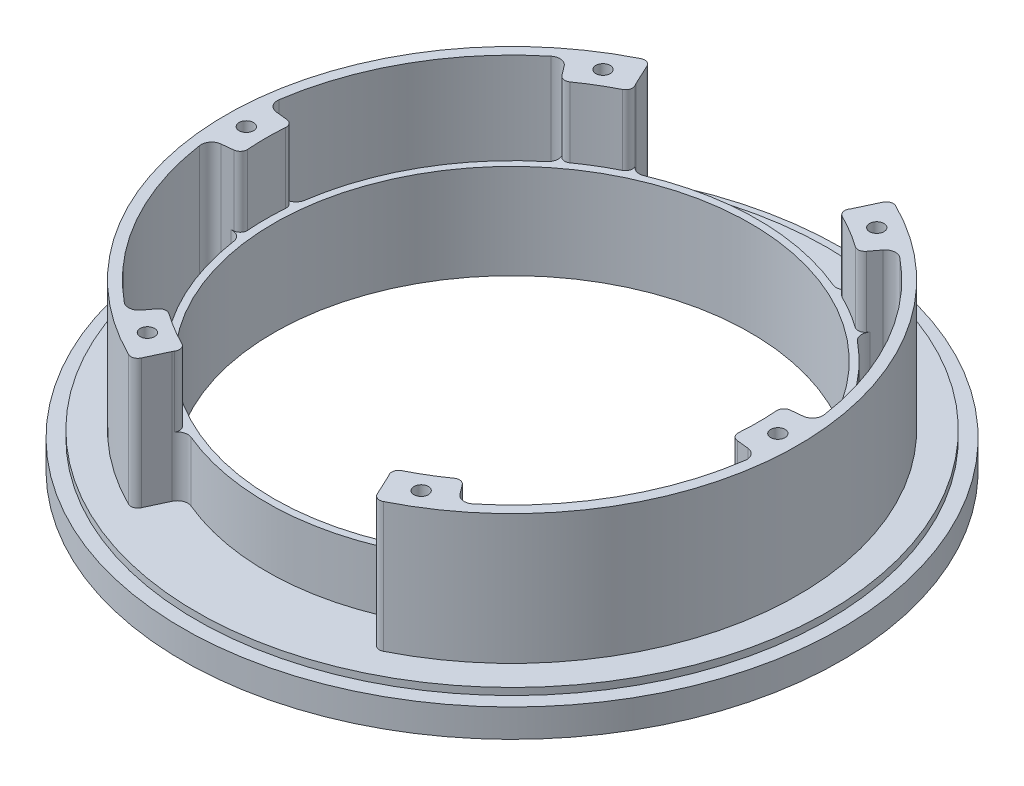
ISO-10303-21;
HEADER;
FILE_DESCRIPTION(('STEP AP214'),'2;1');
FILE_NAME('part.step','',(''),(''),'','','');
FILE_SCHEMA(('AUTOMOTIVE_DESIGN { 1 0 10303 214 1 1 1 1 }'));
ENDSEC;
DATA;
#1=APPLICATION_CONTEXT('core data for automotive mechanical design processes');
#2=APPLICATION_PROTOCOL_DEFINITION('international standard','automotive_design',2000,#1);
#3=PRODUCT_CONTEXT('',#1,'mechanical');
#4=PRODUCT('Part','Part','',(#3));
#5=PRODUCT_RELATED_PRODUCT_CATEGORY('part','',(#4));
#6=PRODUCT_DEFINITION_FORMATION('','',#4);
#7=PRODUCT_DEFINITION_CONTEXT('part definition',#1,'design');
#8=PRODUCT_DEFINITION('design','',#6,#7);
#9=PRODUCT_DEFINITION_SHAPE('','',#8);
#10=(LENGTH_UNIT() NAMED_UNIT(*) SI_UNIT(.MILLI.,.METRE.));
#11=(NAMED_UNIT(*) PLANE_ANGLE_UNIT() SI_UNIT($,.RADIAN.));
#12=(NAMED_UNIT(*) SI_UNIT($,.STERADIAN.) SOLID_ANGLE_UNIT());
#13=UNCERTAINTY_MEASURE_WITH_UNIT(LENGTH_MEASURE(1.E-05),#10,'distance_accuracy_value','');
#14=(GEOMETRIC_REPRESENTATION_CONTEXT(3) GLOBAL_UNCERTAINTY_ASSIGNED_CONTEXT((#13)) GLOBAL_UNIT_ASSIGNED_CONTEXT((#10,
#11,#12)) REPRESENTATION_CONTEXT('',''));
#15=CARTESIAN_POINT('',(0.,0.,0.));
#16=DIRECTION('',(0.,0.,1.));
#17=DIRECTION('',(1.,0.,0.));
#18=AXIS2_PLACEMENT_3D('',#15,#16,#17);
#19=CARTESIAN_POINT('',(0.,23.5,0.));
#20=DIRECTION('',(0.,1.,0.));
#21=DIRECTION('',(0.,0.,1.));
#22=AXIS2_PLACEMENT_3D('',#19,#20,#21);
#23=PLANE('',#22);
#24=DIRECTION('',(-0.601815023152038,0.,-0.7986355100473));
#25=VECTOR('',#24,1.);
#26=CARTESIAN_POINT('',(0.,23.5,0.));
#27=LINE('',#26,#25);
#28=CARTESIAN_POINT('',(22.7306896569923,23.5,30.164644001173));
#29=VERTEX_POINT('',#28);
#30=CARTESIAN_POINT('',(21.7171853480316,23.5,28.8196783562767));
#31=VERTEX_POINT('',#30);
#32=EDGE_CURVE('E499',#29,#31,#27,.T.);
#33=ORIENTED_EDGE('',*,*,#32,.T.);
#34=CARTESIAN_POINT('',(20.9185498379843,23.5,29.4214933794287));
#35=DIRECTION('',(0.,1.,0.));
#36=DIRECTION('',(0.,0.,1.));
#37=AXIS2_PLACEMENT_3D('',#34,#35,#36);
#38=CIRCLE('',#37,1.);
#39=CARTESIAN_POINT('',(20.3390886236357,23.5,28.6064935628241));
#40=VERTEX_POINT('',#39);
#41=EDGE_CURVE('E781',#31,#40,#38,.T.);
#42=ORIENTED_EDGE('',*,*,#41,.T.);
#43=CARTESIAN_POINT('',(0.,23.5,0.));
#44=DIRECTION('',(0.,1.,0.));
#45=DIRECTION('',(0.,0.,1.));
#46=AXIS2_PLACEMENT_3D('',#43,#44,#45);
#47=CIRCLE('',#46,35.1);
#48=CARTESIAN_POINT('',(15.6838416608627,23.5,31.4010686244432));
#49=VERTEX_POINT('',#48);
#50=EDGE_CURVE('E1082',#49,#40,#47,.T.);
#51=ORIENTED_EDGE('',*,*,#50,.F.);
#52=CARTESIAN_POINT('',(16.1306747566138,23.5,32.2956859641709));
#53=DIRECTION('',(0.,1.,0.));
#54=DIRECTION('',(0.,0.,1.));
#55=AXIS2_PLACEMENT_3D('',#52,#53,#54);
#56=CIRCLE('',#55,1.);
#57=CARTESIAN_POINT('',(15.2996342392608,23.5,32.8518978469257));
#58=VERTEX_POINT('',#57);
#59=EDGE_CURVE('E771',#49,#58,#56,.T.);
#60=ORIENTED_EDGE('',*,*,#59,.T.);
#61=CARTESIAN_POINT('',(14.0530734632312,23.5,33.6862156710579));
#62=DIRECTION('',(0.,1.,0.));
#63=DIRECTION('',(0.,0.,1.));
#64=AXIS2_PLACEMENT_3D('',#61,#62,#63);
#65=CIRCLE('',#64,1.5);
#66=CARTESIAN_POINT('',(15.4125351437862,23.5,33.0522882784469));
#67=VERTEX_POINT('',#66);
#68=EDGE_CURVE('E752',#58,#67,#65,.F.);
#69=ORIENTED_EDGE('',*,*,#68,.T.);
#70=DIRECTION('',(0.422618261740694,0.,0.906307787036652));
#71=VECTOR('',#70,1.);
#72=CARTESIAN_POINT('',(0.,23.5,0.));
#73=LINE('',#72,#71);
#74=CARTESIAN_POINT('',(16.8148967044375,23.5,36.0596623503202));
#75=VERTEX_POINT('',#74);
#76=EDGE_CURVE('E1286',#67,#75,#73,.T.);
#77=ORIENTED_EDGE('',*,*,#76,.T.);
#78=CARTESIAN_POINT('',(17.7212044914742,23.5,35.6370440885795));
#79=DIRECTION('',(0.,1.,0.));
#80=DIRECTION('',(0.,0.,1.));
#81=AXIS2_PLACEMENT_3D('',#78,#79,#80);
#82=CIRCLE('',#81,1.);
#83=CARTESIAN_POINT('',(18.1664608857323,23.5,36.532447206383));
#84=VERTEX_POINT('',#83);
#85=EDGE_CURVE('E681',#75,#84,#82,.T.);
#86=ORIENTED_EDGE('',*,*,#85,.T.);
#87=CARTESIAN_POINT('',(0.,23.5,0.));
#88=DIRECTION('',(0.,1.,0.));
#89=DIRECTION('',(0.,0.,1.));
#90=AXIS2_PLACEMENT_3D('',#87,#88,#89);
#91=CIRCLE('',#90,40.8);
#92=CARTESIAN_POINT('',(18.1664608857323,23.5,-36.532447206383));
#93=VERTEX_POINT('',#92);
#94=EDGE_CURVE('E1299',#84,#93,#91,.T.);
#95=ORIENTED_EDGE('',*,*,#94,.T.);
#96=CARTESIAN_POINT('',(17.7212044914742,23.5,-35.6370440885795));
#97=DIRECTION('',(0.,1.,0.));
#98=DIRECTION('',(0.,0.,1.));
#99=AXIS2_PLACEMENT_3D('',#96,#97,#98);
#100=CIRCLE('',#99,1.);
#101=CARTESIAN_POINT('',(16.8148967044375,23.5,-36.0596623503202));
#102=VERTEX_POINT('',#101);
#103=EDGE_CURVE('E678',#93,#102,#100,.T.);
#104=ORIENTED_EDGE('',*,*,#103,.T.);
#105=DIRECTION('',(0.422618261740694,0.,-0.906307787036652));
#106=VECTOR('',#105,1.);
#107=CARTESIAN_POINT('',(0.,23.5,0.));
#108=LINE('',#107,#106);
#109=CARTESIAN_POINT('',(15.4125351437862,23.5,-33.0522882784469));
#110=VERTEX_POINT('',#109);
#111=EDGE_CURVE('E1279',#110,#102,#108,.T.);
#112=ORIENTED_EDGE('',*,*,#111,.F.);
#113=CARTESIAN_POINT('',(14.0530734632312,23.5,-33.6862156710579));
#114=DIRECTION('',(0.,1.,0.));
#115=DIRECTION('',(0.,0.,1.));
#116=AXIS2_PLACEMENT_3D('',#113,#114,#115);
#117=CIRCLE('',#116,1.5);
#118=CARTESIAN_POINT('',(15.2996342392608,23.5,-32.8518978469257));
#119=VERTEX_POINT('',#118);
#120=EDGE_CURVE('E758',#110,#119,#117,.F.);
#121=ORIENTED_EDGE('',*,*,#120,.T.);
#122=CARTESIAN_POINT('',(16.1306747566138,23.5,-32.2956859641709));
#123=DIRECTION('',(0.,1.,0.));
#124=DIRECTION('',(0.,0.,1.));
#125=AXIS2_PLACEMENT_3D('',#122,#123,#124);
#126=CIRCLE('',#125,1.);
#127=CARTESIAN_POINT('',(15.6838416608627,23.5,-31.4010686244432));
#128=VERTEX_POINT('',#127);
#129=EDGE_CURVE('E773',#119,#128,#126,.T.);
#130=ORIENTED_EDGE('',*,*,#129,.T.);
#131=CARTESIAN_POINT('',(20.3390886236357,23.5,-28.6064935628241));
#132=VERTEX_POINT('',#131);
#133=EDGE_CURVE('E884',#132,#128,#47,.T.);
#134=ORIENTED_EDGE('',*,*,#133,.F.);
#135=CARTESIAN_POINT('',(20.9185498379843,23.5,-29.4214933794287));
#136=DIRECTION('',(0.,1.,0.));
#137=DIRECTION('',(0.,0.,1.));
#138=AXIS2_PLACEMENT_3D('',#135,#136,#137);
#139=CIRCLE('',#138,1.);
#140=CARTESIAN_POINT('',(21.7171853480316,23.5,-28.8196783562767));
#141=VERTEX_POINT('',#140);
#142=EDGE_CURVE('E775',#132,#141,#139,.T.);
#143=ORIENTED_EDGE('',*,*,#142,.T.);
#144=DIRECTION('',(-0.601815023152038,0.,0.7986355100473));
#145=VECTOR('',#144,1.);
#146=CARTESIAN_POINT('',(0.,23.5,0.));
#147=LINE('',#146,#145);
#148=CARTESIAN_POINT('',(22.7306896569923,23.5,-30.164644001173));
#149=VERTEX_POINT('',#148);
#150=EDGE_CURVE('E1105',#149,#141,#147,.T.);
#151=ORIENTED_EDGE('',*,*,#150,.F.);
#152=CARTESIAN_POINT('',(23.9286429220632,23.5,-29.261921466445));
#153=DIRECTION('',(0.,1.,0.));
#154=DIRECTION('',(0.,0.,1.));
#155=AXIS2_PLACEMENT_3D('',#152,#153,#154);
#156=CIRCLE('',#155,1.5);
#157=CARTESIAN_POINT('',(24.8781922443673,23.5,-30.4231088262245));
#158=VERTEX_POINT('',#157);
#159=EDGE_CURVE('E654',#149,#158,#156,.F.);
#160=ORIENTED_EDGE('',*,*,#159,.T.);
#161=CARTESIAN_POINT('',(0.,23.5,0.));
#162=DIRECTION('',(0.,1.,0.));
#163=DIRECTION('',(0.,0.,1.));
#164=AXIS2_PLACEMENT_3D('',#161,#162,#163);
#165=CIRCLE('',#164,39.3);
#166=CARTESIAN_POINT('',(38.8909103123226,23.5,-5.65571348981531));
#167=VERTEX_POINT('',#166);
#168=EDGE_CURVE('E1109',#167,#158,#165,.T.);
#169=ORIENTED_EDGE('',*,*,#168,.F.);
#170=CARTESIAN_POINT('',(37.4065244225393,23.5,-5.43984656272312));
#171=DIRECTION('',(0.,1.,0.));
#172=DIRECTION('',(0.,0.,1.));
#173=AXIS2_PLACEMENT_3D('',#170,#171,#172);
#174=CIRCLE('',#173,1.5);
#175=CARTESIAN_POINT('',(37.5633171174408,23.5,-3.94806371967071));
#176=VERTEX_POINT('',#175);
#177=EDGE_CURVE('E651',#167,#176,#174,.F.);
#178=ORIENTED_EDGE('',*,*,#177,.T.);
#179=DIRECTION('',(0.994521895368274,0.,-0.104528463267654));
#180=VECTOR('',#179,1.);
#181=CARTESIAN_POINT('',(0.,23.5,0.));
#182=LINE('',#181,#180);
#183=CARTESIAN_POINT('',(35.8884632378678,23.5,-3.77202948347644));
#184=VERTEX_POINT('',#183);
#185=EDGE_CURVE('E1115',#184,#176,#182,.T.);
#186=ORIENTED_EDGE('',*,*,#185,.F.);
#187=CARTESIAN_POINT('',(35.9929917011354,23.5,-2.77750758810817));
#188=DIRECTION('',(0.,1.,0.));
#189=DIRECTION('',(0.,0.,1.));
#190=AXIS2_PLACEMENT_3D('',#187,#188,#189);
#191=CIRCLE('',#190,1.);
#192=CARTESIAN_POINT('',(34.9959559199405,23.5,-2.70056831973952));
#193=VERTEX_POINT('',#192);
#194=EDGE_CURVE('E777',#184,#193,#191,.T.);
#195=ORIENTED_EDGE('',*,*,#194,.T.);
#196=CARTESIAN_POINT('',(34.9959559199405,23.5,2.70056831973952));
#197=VERTEX_POINT('',#196);
#198=EDGE_CURVE('E1087',#197,#193,#47,.T.);
#199=ORIENTED_EDGE('',*,*,#198,.F.);
#200=CARTESIAN_POINT('',(35.9929917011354,23.5,2.77750758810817));
#201=DIRECTION('',(0.,1.,0.));
#202=DIRECTION('',(0.,0.,1.));
#203=AXIS2_PLACEMENT_3D('',#200,#201,#202);
#204=CIRCLE('',#203,1.);
#205=CARTESIAN_POINT('',(35.8884632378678,23.5,3.77202948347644));
#206=VERTEX_POINT('',#205);
#207=EDGE_CURVE('E779',#197,#206,#204,.T.);
#208=ORIENTED_EDGE('',*,*,#207,.T.);
#209=DIRECTION('',(0.994521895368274,0.,0.104528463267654));
#210=VECTOR('',#209,1.);
#211=CARTESIAN_POINT('',(0.,23.5,0.));
#212=LINE('',#211,#210);
#213=CARTESIAN_POINT('',(37.5633171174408,23.5,3.94806371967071));
#214=VERTEX_POINT('',#213);
#215=EDGE_CURVE('E1125',#206,#214,#212,.T.);
#216=ORIENTED_EDGE('',*,*,#215,.T.);
#217=CARTESIAN_POINT('',(37.4065244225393,23.5,5.43984656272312));
#218=DIRECTION('',(0.,1.,0.));
#219=DIRECTION('',(0.,0.,1.));
#220=AXIS2_PLACEMENT_3D('',#217,#218,#219);
#221=CIRCLE('',#220,1.5);
#222=CARTESIAN_POINT('',(38.8909103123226,23.5,5.65571348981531));
#223=VERTEX_POINT('',#222);
#224=EDGE_CURVE('E644',#214,#223,#221,.F.);
#225=ORIENTED_EDGE('',*,*,#224,.T.);
#226=CARTESIAN_POINT('',(0.,23.5,0.));
#227=DIRECTION('',(0.,1.,0.));
#228=DIRECTION('',(0.,0.,1.));
#229=AXIS2_PLACEMENT_3D('',#226,#227,#228);
#230=CIRCLE('',#229,39.3);
#231=CARTESIAN_POINT('',(24.8781922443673,23.5,30.4231088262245));
#232=VERTEX_POINT('',#231);
#233=EDGE_CURVE('E514',#232,#223,#230,.T.);
#234=ORIENTED_EDGE('',*,*,#233,.F.);
#235=CARTESIAN_POINT('',(23.9286429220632,23.5,29.261921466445));
#236=DIRECTION('',(0.,1.,0.));
#237=DIRECTION('',(0.,0.,1.));
#238=AXIS2_PLACEMENT_3D('',#235,#236,#237);
#239=CIRCLE('',#238,1.5);
#240=EDGE_CURVE('E642',#232,#29,#239,.F.);
#241=ORIENTED_EDGE('',*,*,#240,.T.);
#242=EDGE_LOOP('',(#33,#42,#51,#60,#69,#77,#86,#95,#104,#112,#121,#130,#134,#143,#151,#160,#169,
#178,#186,#195,#199,#208,#216,#225,#234,#241));
#243=FACE_BOUND('',#242,.T.);
#244=CARTESIAN_POINT('',(19.5199430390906,23.5,-32.4866406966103));
#245=DIRECTION('',(0.,1.,0.));
#246=DIRECTION('',(0.,0.,1.));
#247=AXIS2_PLACEMENT_3D('',#244,#245,#246);
#248=CIRCLE('',#247,1.02499999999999);
#249=CARTESIAN_POINT('',(19.5199430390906,23.5,-31.4616406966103));
#250=VERTEX_POINT('',#249);
#251=EDGE_CURVE('E1159',#250,#250,#248,.T.);
#252=ORIENTED_EDGE('',*,*,#251,.F.);
#253=EDGE_LOOP('',(#252));
#254=FACE_BOUND('',#253,.T.);
#255=CARTESIAN_POINT('',(37.9,23.5,0.));
#256=DIRECTION('',(0.,1.,0.));
#257=DIRECTION('',(0.,0.,1.));
#258=AXIS2_PLACEMENT_3D('',#255,#256,#257);
#259=CIRCLE('',#258,1.02499999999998);
#260=CARTESIAN_POINT('',(37.9,23.5,1.02499999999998));
#261=VERTEX_POINT('',#260);
#262=EDGE_CURVE('E1165',#261,#261,#259,.T.);
#263=ORIENTED_EDGE('',*,*,#262,.F.);
#264=EDGE_LOOP('',(#263));
#265=FACE_BOUND('',#264,.T.);
#266=CARTESIAN_POINT('',(19.5199430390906,23.5,32.4866406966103));
#267=DIRECTION('',(0.,1.,0.));
#268=DIRECTION('',(0.,0.,1.));
#269=AXIS2_PLACEMENT_3D('',#266,#267,#268);
#270=CIRCLE('',#269,1.02499999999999);
#271=CARTESIAN_POINT('',(19.5199430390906,23.5,33.5116406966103));
#272=VERTEX_POINT('',#271);
#273=EDGE_CURVE('E1171',#272,#272,#270,.T.);
#274=ORIENTED_EDGE('',*,*,#273,.F.);
#275=EDGE_LOOP('',(#274));
#276=FACE_BOUND('',#275,.T.);
#277=ADVANCED_FACE('F41',(#243,#254,#265,#276),#23,.T.);
#278=DIRECTION('',(0.601815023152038,0.,0.7986355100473));
#279=VECTOR('',#278,1.);
#280=CARTESIAN_POINT('',(0.,23.5,0.));
#281=LINE('',#280,#279);
#282=CARTESIAN_POINT('',(-22.7306896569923,23.5,-30.164644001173));
#283=VERTEX_POINT('',#282);
#284=CARTESIAN_POINT('',(-21.7171853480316,23.5,-28.8196783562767));
#285=VERTEX_POINT('',#284);
#286=EDGE_CURVE('E878',#283,#285,#281,.T.);
#287=ORIENTED_EDGE('',*,*,#286,.T.);
#288=CARTESIAN_POINT('',(-20.9185498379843,23.5,-29.4214933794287));
#289=DIRECTION('',(0.,1.,0.));
#290=DIRECTION('',(0.,0.,1.));
#291=AXIS2_PLACEMENT_3D('',#288,#289,#290);
#292=CIRCLE('',#291,1.);
#293=CARTESIAN_POINT('',(-20.3390886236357,23.5,-28.6064935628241));
#294=VERTEX_POINT('',#293);
#295=EDGE_CURVE('E49',#285,#294,#292,.T.);
#296=ORIENTED_EDGE('',*,*,#295,.T.);
#297=CARTESIAN_POINT('',(-15.6838416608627,23.5,-31.4010686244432));
#298=VERTEX_POINT('',#297);
#299=EDGE_CURVE('E877',#298,#294,#47,.T.);
#300=ORIENTED_EDGE('',*,*,#299,.F.);
#301=CARTESIAN_POINT('',(-16.1306747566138,23.5,-32.2956859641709));
#302=DIRECTION('',(0.,1.,0.));
#303=DIRECTION('',(0.,0.,1.));
#304=AXIS2_PLACEMENT_3D('',#301,#302,#303);
#305=CIRCLE('',#304,1.);
#306=CARTESIAN_POINT('',(-15.2996342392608,23.5,-32.8518978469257));
#307=VERTEX_POINT('',#306);
#308=EDGE_CURVE('E833',#298,#307,#305,.T.);
#309=ORIENTED_EDGE('',*,*,#308,.T.);
#310=CARTESIAN_POINT('',(-14.0530734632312,23.5,-33.6862156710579));
#311=DIRECTION('',(0.,1.,0.));
#312=DIRECTION('',(0.,0.,1.));
#313=AXIS2_PLACEMENT_3D('',#310,#311,#312);
#314=CIRCLE('',#313,1.5);
#315=CARTESIAN_POINT('',(-15.4125351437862,23.5,-33.0522882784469));
#316=VERTEX_POINT('',#315);
#317=EDGE_CURVE('E756',#307,#316,#314,.F.);
#318=ORIENTED_EDGE('',*,*,#317,.T.);
#319=DIRECTION('',(-0.422618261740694,0.,-0.906307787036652));
#320=VECTOR('',#319,1.);
#321=CARTESIAN_POINT('',(0.,23.5,0.));
#322=LINE('',#321,#320);
#323=CARTESIAN_POINT('',(-16.8148967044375,23.5,-36.0596623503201));
#324=VERTEX_POINT('',#323);
#325=EDGE_CURVE('E1275',#316,#324,#322,.T.);
#326=ORIENTED_EDGE('',*,*,#325,.T.);
#327=CARTESIAN_POINT('',(-17.7212044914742,23.5,-35.6370440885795));
#328=DIRECTION('',(0.,1.,0.));
#329=DIRECTION('',(0.,0.,1.));
#330=AXIS2_PLACEMENT_3D('',#327,#328,#329);
#331=CIRCLE('',#330,1.);
#332=CARTESIAN_POINT('',(-18.1664608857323,23.5,-36.532447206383));
#333=VERTEX_POINT('',#332);
#334=EDGE_CURVE('E693',#324,#333,#331,.T.);
#335=ORIENTED_EDGE('',*,*,#334,.T.);
#336=CARTESIAN_POINT('',(-18.1664608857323,23.5,36.532447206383));
#337=VERTEX_POINT('',#336);
#338=EDGE_CURVE('E1277',#333,#337,#91,.T.);
#339=ORIENTED_EDGE('',*,*,#338,.T.);
#340=CARTESIAN_POINT('',(-17.7212044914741,23.5,35.6370440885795));
#341=DIRECTION('',(0.,1.,0.));
#342=DIRECTION('',(0.,0.,1.));
#343=AXIS2_PLACEMENT_3D('',#340,#341,#342);
#344=CIRCLE('',#343,1.);
#345=CARTESIAN_POINT('',(-16.8148967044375,23.5,36.0596623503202));
#346=VERTEX_POINT('',#345);
#347=EDGE_CURVE('E695',#337,#346,#344,.T.);
#348=ORIENTED_EDGE('',*,*,#347,.T.);
#349=DIRECTION('',(-0.422618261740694,0.,0.906307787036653));
#350=VECTOR('',#349,1.);
#351=CARTESIAN_POINT('',(0.,23.5,0.));
#352=LINE('',#351,#350);
#353=CARTESIAN_POINT('',(-15.4125351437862,23.5,33.0522882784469));
#354=VERTEX_POINT('',#353);
#355=EDGE_CURVE('E1290',#354,#346,#352,.T.);
#356=ORIENTED_EDGE('',*,*,#355,.F.);
#357=CARTESIAN_POINT('',(-14.0530734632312,23.5,33.6862156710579));
#358=DIRECTION('',(0.,1.,0.));
#359=DIRECTION('',(0.,0.,1.));
#360=AXIS2_PLACEMENT_3D('',#357,#358,#359);
#361=CIRCLE('',#360,1.5);
#362=CARTESIAN_POINT('',(-15.2996342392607,23.5,32.8518978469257));
#363=VERTEX_POINT('',#362);
#364=EDGE_CURVE('E745',#354,#363,#361,.F.);
#365=ORIENTED_EDGE('',*,*,#364,.T.);
#366=CARTESIAN_POINT('',(-16.1306747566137,23.5,32.2956859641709));
#367=DIRECTION('',(0.,1.,0.));
#368=DIRECTION('',(0.,0.,1.));
#369=AXIS2_PLACEMENT_3D('',#366,#367,#368);
#370=CIRCLE('',#369,1.);
#371=CARTESIAN_POINT('',(-15.6838416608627,23.5,31.4010686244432));
#372=VERTEX_POINT('',#371);
#373=EDGE_CURVE('E811',#363,#372,#370,.T.);
#374=ORIENTED_EDGE('',*,*,#373,.T.);
#375=CARTESIAN_POINT('',(-20.3390886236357,23.5,28.6064935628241));
#376=VERTEX_POINT('',#375);
#377=EDGE_CURVE('E887',#376,#372,#47,.T.);
#378=ORIENTED_EDGE('',*,*,#377,.F.);
#379=CARTESIAN_POINT('',(-20.9185498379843,23.5,29.4214933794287));
#380=DIRECTION('',(0.,1.,0.));
#381=DIRECTION('',(0.,0.,1.));
#382=AXIS2_PLACEMENT_3D('',#379,#380,#381);
#383=CIRCLE('',#382,1.);
#384=CARTESIAN_POINT('',(-21.7171853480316,23.5,28.8196783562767));
#385=VERTEX_POINT('',#384);
#386=EDGE_CURVE('E844',#376,#385,#383,.T.);
#387=ORIENTED_EDGE('',*,*,#386,.T.);
#388=DIRECTION('',(0.601815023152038,0.,-0.7986355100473));
#389=VECTOR('',#388,1.);
#390=CARTESIAN_POINT('',(0.,23.5,0.));
#391=LINE('',#390,#389);
#392=CARTESIAN_POINT('',(-22.7306896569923,23.5,30.164644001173));
#393=VERTEX_POINT('',#392);
#394=EDGE_CURVE('E1346',#393,#385,#391,.T.);
#395=ORIENTED_EDGE('',*,*,#394,.F.);
#396=CARTESIAN_POINT('',(-23.9286429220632,23.5,29.261921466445));
#397=DIRECTION('',(0.,1.,0.));
#398=DIRECTION('',(0.,0.,1.));
#399=AXIS2_PLACEMENT_3D('',#396,#397,#398);
#400=CIRCLE('',#399,1.5);
#401=CARTESIAN_POINT('',(-24.8781922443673,23.5,30.4231088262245));
#402=VERTEX_POINT('',#401);
#403=EDGE_CURVE('E661',#393,#402,#400,.F.);
#404=ORIENTED_EDGE('',*,*,#403,.T.);
#405=CARTESIAN_POINT('',(0.,23.5,0.));
#406=DIRECTION('',(0.,1.,0.));
#407=DIRECTION('',(0.,0.,1.));
#408=AXIS2_PLACEMENT_3D('',#405,#406,#407);
#409=CIRCLE('',#408,39.3);
#410=CARTESIAN_POINT('',(-38.8909103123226,23.5,5.65571348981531));
#411=VERTEX_POINT('',#410);
#412=EDGE_CURVE('E1341',#411,#402,#409,.T.);
#413=ORIENTED_EDGE('',*,*,#412,.F.);
#414=CARTESIAN_POINT('',(-37.4065244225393,23.5,5.43984656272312));
#415=DIRECTION('',(0.,1.,0.));
#416=DIRECTION('',(0.,0.,1.));
#417=AXIS2_PLACEMENT_3D('',#414,#415,#416);
#418=CIRCLE('',#417,1.5);
#419=CARTESIAN_POINT('',(-37.5633171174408,23.5,3.94806371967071));
#420=VERTEX_POINT('',#419);
#421=EDGE_CURVE('E663',#411,#420,#418,.F.);
#422=ORIENTED_EDGE('',*,*,#421,.T.);
#423=DIRECTION('',(-0.994521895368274,0.,0.104528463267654));
#424=VECTOR('',#423,1.);
#425=CARTESIAN_POINT('',(0.,23.5,0.));
#426=LINE('',#425,#424);
#427=CARTESIAN_POINT('',(-35.8884632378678,23.5,3.77202948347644));
#428=VERTEX_POINT('',#427);
#429=EDGE_CURVE('E1338',#428,#420,#426,.T.);
#430=ORIENTED_EDGE('',*,*,#429,.F.);
#431=CARTESIAN_POINT('',(-35.9929917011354,23.5,2.77750758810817));
#432=DIRECTION('',(0.,1.,0.));
#433=DIRECTION('',(0.,0.,1.));
#434=AXIS2_PLACEMENT_3D('',#431,#432,#433);
#435=CIRCLE('',#434,1.);
#436=CARTESIAN_POINT('',(-34.9959559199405,23.5,2.70056831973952));
#437=VERTEX_POINT('',#436);
#438=EDGE_CURVE('E848',#428,#437,#435,.T.);
#439=ORIENTED_EDGE('',*,*,#438,.T.);
#440=CARTESIAN_POINT('',(-34.9959559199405,23.5,-2.70056831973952));
#441=VERTEX_POINT('',#440);
#442=EDGE_CURVE('E885',#441,#437,#47,.T.);
#443=ORIENTED_EDGE('',*,*,#442,.F.);
#444=CARTESIAN_POINT('',(-35.9929917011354,23.5,-2.77750758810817));
#445=DIRECTION('',(0.,1.,0.));
#446=DIRECTION('',(0.,0.,1.));
#447=AXIS2_PLACEMENT_3D('',#444,#445,#446);
#448=CIRCLE('',#447,1.);
#449=CARTESIAN_POINT('',(-35.8884632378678,23.5,-3.77202948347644));
#450=VERTEX_POINT('',#449);
#451=EDGE_CURVE('E846',#441,#450,#448,.T.);
#452=ORIENTED_EDGE('',*,*,#451,.T.);
#453=DIRECTION('',(-0.994521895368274,0.,-0.104528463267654));
#454=VECTOR('',#453,1.);
#455=CARTESIAN_POINT('',(0.,23.5,0.));
#456=LINE('',#455,#454);
#457=CARTESIAN_POINT('',(-37.5633171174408,23.5,-3.94806371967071));
#458=VERTEX_POINT('',#457);
#459=EDGE_CURVE('E1128',#450,#458,#456,.T.);
#460=ORIENTED_EDGE('',*,*,#459,.T.);
#461=CARTESIAN_POINT('',(-37.4065244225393,23.5,-5.43984656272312));
#462=DIRECTION('',(0.,1.,0.));
#463=DIRECTION('',(0.,0.,1.));
#464=AXIS2_PLACEMENT_3D('',#461,#462,#463);
#465=CIRCLE('',#464,1.5);
#466=CARTESIAN_POINT('',(-38.8909103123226,23.5,-5.65571348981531));
#467=VERTEX_POINT('',#466);
#468=EDGE_CURVE('E671',#458,#467,#465,.F.);
#469=ORIENTED_EDGE('',*,*,#468,.T.);
#470=CARTESIAN_POINT('',(0.,23.5,0.));
#471=DIRECTION('',(0.,1.,0.));
#472=DIRECTION('',(0.,0.,1.));
#473=AXIS2_PLACEMENT_3D('',#470,#471,#472);
#474=CIRCLE('',#473,39.3);
#475=CARTESIAN_POINT('',(-24.8781922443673,23.5,-30.4231088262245));
#476=VERTEX_POINT('',#475);
#477=EDGE_CURVE('E1132',#476,#467,#474,.T.);
#478=ORIENTED_EDGE('',*,*,#477,.F.);
#479=CARTESIAN_POINT('',(-23.9286429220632,23.5,-29.261921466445));
#480=DIRECTION('',(0.,1.,0.));
#481=DIRECTION('',(0.,0.,1.));
#482=AXIS2_PLACEMENT_3D('',#479,#480,#481);
#483=CIRCLE('',#482,1.5);
#484=EDGE_CURVE('E673',#476,#283,#483,.F.);
#485=ORIENTED_EDGE('',*,*,#484,.T.);
#486=EDGE_LOOP('',(#287,#296,#300,#309,#318,#326,#335,#339,#348,#356,#365,#374,#378,#387,#395,
#404,#413,#422,#430,#439,#443,#452,#460,#469,#478,#485));
#487=FACE_BOUND('',#486,.T.);
#488=CARTESIAN_POINT('',(-19.5199430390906,23.5,-32.4866406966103));
#489=DIRECTION('',(0.,1.,0.));
#490=DIRECTION('',(0.,0.,1.));
#491=AXIS2_PLACEMENT_3D('',#488,#489,#490);
#492=CIRCLE('',#491,1.02499999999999);
#493=CARTESIAN_POINT('',(-19.5199430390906,23.5,-31.4616406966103));
#494=VERTEX_POINT('',#493);
#495=EDGE_CURVE('E1137',#494,#494,#492,.T.);
#496=ORIENTED_EDGE('',*,*,#495,.F.);
#497=EDGE_LOOP('',(#496));
#498=FACE_BOUND('',#497,.T.);
#499=CARTESIAN_POINT('',(-37.9,23.5,0.));
#500=DIRECTION('',(0.,1.,0.));
#501=DIRECTION('',(0.,0.,1.));
#502=AXIS2_PLACEMENT_3D('',#499,#500,#501);
#503=CIRCLE('',#502,1.02499999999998);
#504=CARTESIAN_POINT('',(-37.9,23.5,1.02499999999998));
#505=VERTEX_POINT('',#504);
#506=EDGE_CURVE('E1153',#505,#505,#503,.T.);
#507=ORIENTED_EDGE('',*,*,#506,.F.);
#508=EDGE_LOOP('',(#507));
#509=FACE_BOUND('',#508,.T.);
#510=CARTESIAN_POINT('',(-19.5199430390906,23.5,32.4866406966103));
#511=DIRECTION('',(0.,1.,0.));
#512=DIRECTION('',(0.,0.,1.));
#513=AXIS2_PLACEMENT_3D('',#510,#511,#512);
#514=CIRCLE('',#513,1.02499999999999);
#515=CARTESIAN_POINT('',(-19.5199430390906,23.5,33.5116406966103));
#516=VERTEX_POINT('',#515);
#517=EDGE_CURVE('E1177',#516,#516,#514,.T.);
#518=ORIENTED_EDGE('',*,*,#517,.F.);
#519=EDGE_LOOP('',(#518));
#520=FACE_BOUND('',#519,.T.);
#521=ADVANCED_FACE('F875',(#487,#498,#509,#520),#23,.T.);
#522=CARTESIAN_POINT('',(0.,23.5,0.));
#523=DIRECTION('',(0.,-1.,0.));
#524=DIRECTION('',(0.,0.,-1.));
#525=AXIS2_PLACEMENT_3D('',#522,#523,#524);
#526=CYLINDRICAL_SURFACE('',#525,34.);
#527=CARTESIAN_POINT('',(0.,0.,0.));
#528=DIRECTION('',(0.,1.,0.));
#529=DIRECTION('',(0.,0.,1.));
#530=AXIS2_PLACEMENT_3D('',#527,#528,#529);
#531=CIRCLE('',#530,34.);
#532=CARTESIAN_POINT('',(0.,0.,34.));
#533=VERTEX_POINT('',#532);
#534=EDGE_CURVE('E1303',#533,#533,#531,.T.);
#535=ORIENTED_EDGE('',*,*,#534,.F.);
#536=EDGE_LOOP('',(#535));
#537=FACE_BOUND('',#536,.T.);
#538=CARTESIAN_POINT('',(0.,13.5,0.));
#539=DIRECTION('',(0.,1.,0.));
#540=DIRECTION('',(0.,0.,1.));
#541=AXIS2_PLACEMENT_3D('',#538,#539,#540);
#542=CIRCLE('',#541,34.);
#543=CARTESIAN_POINT('',(0.,13.5,34.));
#544=VERTEX_POINT('',#543);
#545=EDGE_CURVE('E1190',#544,#544,#542,.T.);
#546=ORIENTED_EDGE('',*,*,#545,.T.);
#547=EDGE_LOOP('',(#546));
#548=FACE_BOUND('',#547,.T.);
#549=ADVANCED_FACE('F901',(#537,#548),#526,.F.);
#550=CARTESIAN_POINT('',(0.,-30.6607969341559,0.));
#551=DIRECTION('',(0.,1.,0.));
#552=DIRECTION('',(0.,0.,1.));
#553=AXIS2_PLACEMENT_3D('',#550,#551,#552);
#554=CYLINDRICAL_SURFACE('',#553,35.);
#555=CARTESIAN_POINT('',(0.,13.5,0.));
#556=DIRECTION('',(0.,1.,0.));
#557=DIRECTION('',(0.,0.,1.));
#558=AXIS2_PLACEMENT_3D('',#555,#556,#557);
#559=CIRCLE('',#558,35.);
#560=CARTESIAN_POINT('',(-13.4755498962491,13.5,32.3018506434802));
#561=VERTEX_POINT('',#560);
#562=CARTESIAN_POINT('',(13.4755498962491,13.5,32.3018506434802));
#563=VERTEX_POINT('',#562);
#564=EDGE_CURVE('E1183',#561,#563,#559,.T.);
#565=ORIENTED_EDGE('',*,*,#564,.F.);
#566=DIRECTION('',(0.,1.,0.));
#567=VECTOR('',#566,1.);
#568=CARTESIAN_POINT('',(-13.4755498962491,-30.6607969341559,32.3018506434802));
#569=LINE('',#568,#567);
#570=CARTESIAN_POINT('',(-13.4755498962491,5.,32.3018506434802));
#571=VERTEX_POINT('',#570);
#572=EDGE_CURVE('E723',#561,#571,#569,.F.);
#573=ORIENTED_EDGE('',*,*,#572,.T.);
#574=CARTESIAN_POINT('',(0.,5.,0.));
#575=DIRECTION('',(0.,-1.,0.));
#576=DIRECTION('',(0.,0.,-1.));
#577=AXIS2_PLACEMENT_3D('',#574,#575,#576);
#578=CIRCLE('',#577,35.);
#579=CARTESIAN_POINT('',(13.4755498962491,5.,32.3018506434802));
#580=VERTEX_POINT('',#579);
#581=EDGE_CURVE('E1274',#571,#580,#578,.F.);
#582=ORIENTED_EDGE('',*,*,#581,.T.);
#583=DIRECTION('',(0.,1.,0.));
#584=VECTOR('',#583,1.);
#585=CARTESIAN_POINT('',(13.4755498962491,-30.6607969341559,32.3018506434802));
#586=LINE('',#585,#584);
#587=EDGE_CURVE('E720',#580,#563,#586,.T.);
#588=ORIENTED_EDGE('',*,*,#587,.T.);
#589=EDGE_LOOP('',(#565,#573,#582,#588));
#590=FACE_BOUND('',#589,.T.);
#591=ADVANCED_FACE('F1505',(#590),#554,.T.);
#592=CARTESIAN_POINT('',(0.,-30.6607969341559,0.));
#593=DIRECTION('',(0.,1.,0.));
#594=DIRECTION('',(0.,0.,1.));
#595=AXIS2_PLACEMENT_3D('',#592,#593,#594);
#596=CYLINDRICAL_SURFACE('',#595,35.);
#597=CARTESIAN_POINT('',(0.,5.,0.));
#598=DIRECTION('',(0.,-1.,0.));
#599=DIRECTION('',(0.,0.,-1.));
#600=AXIS2_PLACEMENT_3D('',#597,#598,#599);
#601=CIRCLE('',#600,35.);
#602=CARTESIAN_POINT('',(13.4755498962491,5.,-32.3018506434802));
#603=VERTEX_POINT('',#602);
#604=CARTESIAN_POINT('',(-13.4755498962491,5.,-32.3018506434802));
#605=VERTEX_POINT('',#604);
#606=EDGE_CURVE('E1283',#603,#605,#601,.F.);
#607=ORIENTED_EDGE('',*,*,#606,.T.);
#608=DIRECTION('',(0.,1.,0.));
#609=VECTOR('',#608,1.);
#610=CARTESIAN_POINT('',(-13.4755498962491,-30.6607969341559,-32.3018506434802));
#611=LINE('',#610,#609);
#612=CARTESIAN_POINT('',(-13.4755498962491,13.5,-32.3018506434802));
#613=VERTEX_POINT('',#612);
#614=EDGE_CURVE('E737',#605,#613,#611,.T.);
#615=ORIENTED_EDGE('',*,*,#614,.T.);
#616=CARTESIAN_POINT('',(0.,13.5,0.));
#617=DIRECTION('',(0.,1.,0.));
#618=DIRECTION('',(0.,0.,1.));
#619=AXIS2_PLACEMENT_3D('',#616,#617,#618);
#620=CIRCLE('',#619,35.);
#621=CARTESIAN_POINT('',(13.4755498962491,13.5,-32.3018506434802));
#622=VERTEX_POINT('',#621);
#623=EDGE_CURVE('E503',#613,#622,#620,.F.);
#624=ORIENTED_EDGE('',*,*,#623,.T.);
#625=DIRECTION('',(0.,1.,0.));
#626=VECTOR('',#625,1.);
#627=CARTESIAN_POINT('',(13.4755498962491,-30.6607969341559,-32.3018506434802));
#628=LINE('',#627,#626);
#629=EDGE_CURVE('E735',#622,#603,#628,.F.);
#630=ORIENTED_EDGE('',*,*,#629,.T.);
#631=EDGE_LOOP('',(#607,#615,#624,#630));
#632=FACE_BOUND('',#631,.T.);
#633=ADVANCED_FACE('F1501',(#632),#596,.T.);
#634=CARTESIAN_POINT('',(0.,5.,0.));
#635=DIRECTION('',(0.,-1.,0.));
#636=DIRECTION('',(0.,0.,-1.));
#637=AXIS2_PLACEMENT_3D('',#634,#635,#636);
#638=CYLINDRICAL_SURFACE('',#637,45.);
#639=CARTESIAN_POINT('',(0.,5.,0.));
#640=DIRECTION('',(0.,-1.,0.));
#641=DIRECTION('',(0.,0.,-1.));
#642=AXIS2_PLACEMENT_3D('',#639,#640,#641);
#643=CIRCLE('',#642,45.);
#644=CARTESIAN_POINT('',(0.,5.,-45.));
#645=VERTEX_POINT('',#644);
#646=EDGE_CURVE('E1300',#645,#645,#643,.T.);
#647=ORIENTED_EDGE('',*,*,#646,.T.);
#648=EDGE_LOOP('',(#647));
#649=FACE_BOUND('',#648,.T.);
#650=CARTESIAN_POINT('',(0.,4.,0.));
#651=DIRECTION('',(0.,-1.,0.));
#652=DIRECTION('',(0.,0.,-1.));
#653=AXIS2_PLACEMENT_3D('',#650,#651,#652);
#654=CIRCLE('',#653,45.);
#655=CARTESIAN_POINT('',(0.,4.,-45.));
#656=VERTEX_POINT('',#655);
#657=EDGE_CURVE('E1269',#656,#656,#654,.F.);
#658=ORIENTED_EDGE('',*,*,#657,.T.);
#659=EDGE_LOOP('',(#658));
#660=FACE_BOUND('',#659,.T.);
#661=ADVANCED_FACE('F1504',(#649,#660),#638,.T.);
#662=CARTESIAN_POINT('',(0.,138.899826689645,0.));
#663=DIRECTION('',(0.,-1.,0.));
#664=DIRECTION('',(0.,0.,-1.));
#665=AXIS2_PLACEMENT_3D('',#662,#663,#664);
#666=CYLINDRICAL_SURFACE('',#665,40.8);
#667=CARTESIAN_POINT('',(0.,5.,0.));
#668=DIRECTION('',(0.,-1.,0.));
#669=DIRECTION('',(0.,0.,-1.));
#670=AXIS2_PLACEMENT_3D('',#667,#668,#669);
#671=CIRCLE('',#670,40.8);
#672=CARTESIAN_POINT('',(-18.1664608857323,5.,-36.532447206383));
#673=VERTEX_POINT('',#672);
#674=CARTESIAN_POINT('',(-18.1664608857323,5.,36.532447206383));
#675=VERTEX_POINT('',#674);
#676=EDGE_CURVE('E1307',#673,#675,#671,.F.);
#677=ORIENTED_EDGE('',*,*,#676,.T.);
#678=DIRECTION('',(0.,-1.,0.));
#679=VECTOR('',#678,1.);
#680=CARTESIAN_POINT('',(-18.1664608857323,138.899826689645,36.532447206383));
#681=LINE('',#680,#679);
#682=EDGE_CURVE('E690',#675,#337,#681,.F.);
#683=ORIENTED_EDGE('',*,*,#682,.T.);
#684=ORIENTED_EDGE('',*,*,#338,.F.);
#685=DIRECTION('',(0.,-1.,0.));
#686=VECTOR('',#685,1.);
#687=CARTESIAN_POINT('',(-18.1664608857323,138.899826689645,-36.532447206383));
#688=LINE('',#687,#686);
#689=EDGE_CURVE('E688',#333,#673,#688,.T.);
#690=ORIENTED_EDGE('',*,*,#689,.T.);
#691=EDGE_LOOP('',(#677,#683,#684,#690));
#692=FACE_BOUND('',#691,.T.);
#693=ADVANCED_FACE('F1528',(#692),#666,.T.);
#694=CARTESIAN_POINT('',(0.,5.,0.));
#695=DIRECTION('',(0.,-1.,0.));
#696=DIRECTION('',(0.,0.,-1.));
#697=AXIS2_PLACEMENT_3D('',#694,#695,#696);
#698=PLANE('',#697);
#699=CARTESIAN_POINT('',(-10.0813099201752,5.,-37.6239608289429));
#700=DIRECTION('',(0.,-1.,0.));
#701=DIRECTION('',(0.,0.,-1.));
#702=AXIS2_PLACEMENT_3D('',#699,#700,#701);
#703=CIRCLE('',#702,1.5);
#704=CARTESIAN_POINT('',(-10.0813099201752,5.,-39.1239608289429));
#705=VERTEX_POINT('',#704);
#706=EDGE_CURVE('E1262',#705,#705,#703,.T.);
#707=ORIENTED_EDGE('',*,*,#706,.T.);
#708=EDGE_LOOP('',(#707));
#709=FACE_BOUND('',#708,.T.);
#710=CARTESIAN_POINT('',(-2.23880572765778,5.,-36.6041500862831));
#711=DIRECTION('',(0.,-1.,0.));
#712=DIRECTION('',(0.,0.,-1.));
#713=AXIS2_PLACEMENT_3D('',#710,#711,#712);
#714=CIRCLE('',#713,1.);
#715=CARTESIAN_POINT('',(-2.23880572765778,5.,-37.6041500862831));
#716=VERTEX_POINT('',#715);
#717=EDGE_CURVE('E1259',#716,#716,#714,.T.);
#718=ORIENTED_EDGE('',*,*,#717,.T.);
#719=EDGE_LOOP('',(#718));
#720=FACE_BOUND('',#719,.T.);
#721=CARTESIAN_POINT('',(0.320024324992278,5.,-36.6711554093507));
#722=DIRECTION('',(0.,-1.,0.));
#723=DIRECTION('',(0.,0.,-1.));
#724=AXIS2_PLACEMENT_3D('',#721,#722,#723);
#725=CIRCLE('',#724,1.);
#726=CARTESIAN_POINT('',(0.320024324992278,5.,-37.6711554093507));
#727=VERTEX_POINT('',#726);
#728=EDGE_CURVE('E1256',#727,#727,#725,.T.);
#729=ORIENTED_EDGE('',*,*,#728,.T.);
#730=EDGE_LOOP('',(#729));
#731=FACE_BOUND('',#730,.T.);
#732=CARTESIAN_POINT('',(2.87729525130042,5.,-36.5595025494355));
#733=DIRECTION('',(0.,-1.,0.));
#734=DIRECTION('',(0.,0.,-1.));
#735=AXIS2_PLACEMENT_3D('',#732,#733,#734);
#736=CIRCLE('',#735,1.);
#737=CARTESIAN_POINT('',(2.87729525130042,5.,-37.5595025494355));
#738=VERTEX_POINT('',#737);
#739=EDGE_CURVE('E1253',#738,#738,#736,.T.);
#740=ORIENTED_EDGE('',*,*,#739,.T.);
#741=EDGE_LOOP('',(#740));
#742=FACE_BOUND('',#741,.T.);
#743=CARTESIAN_POINT('',(5.79007181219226,5.,-38.7422751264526));
#744=DIRECTION('',(0.,-1.,0.));
#745=DIRECTION('',(0.,0.,-1.));
#746=AXIS2_PLACEMENT_3D('',#743,#744,#745);
#747=CIRCLE('',#746,1.);
#748=CARTESIAN_POINT('',(5.79007181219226,5.,-39.7422751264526));
#749=VERTEX_POINT('',#748);
#750=EDGE_CURVE('E1250',#749,#749,#747,.T.);
#751=ORIENTED_EDGE('',*,*,#750,.T.);
#752=EDGE_LOOP('',(#751));
#753=FACE_BOUND('',#752,.T.);
#754=CARTESIAN_POINT('',(8.47849198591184,5.,-38.2440058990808));
#755=DIRECTION('',(0.,-1.,0.));
#756=DIRECTION('',(0.,0.,-1.));
#757=AXIS2_PLACEMENT_3D('',#754,#755,#756);
#758=CIRCLE('',#757,1.);
#759=CARTESIAN_POINT('',(8.47849198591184,5.,-39.2440058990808));
#760=VERTEX_POINT('',#759);
#761=EDGE_CURVE('E1247',#760,#760,#758,.T.);
#762=ORIENTED_EDGE('',*,*,#761,.T.);
#763=EDGE_LOOP('',(#762));
#764=FACE_BOUND('',#763,.T.);
#765=CARTESIAN_POINT('',(7.9373929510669,5.,-35.8032658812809));
#766=DIRECTION('',(0.,-1.,0.));
#767=DIRECTION('',(0.,0.,-1.));
#768=AXIS2_PLACEMENT_3D('',#765,#766,#767);
#769=CIRCLE('',#768,1.);
#770=CARTESIAN_POINT('',(7.9373929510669,5.,-36.8032658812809));
#771=VERTEX_POINT('',#770);
#772=EDGE_CURVE('E1244',#771,#771,#769,.T.);
#773=ORIENTED_EDGE('',*,*,#772,.T.);
#774=EDGE_LOOP('',(#773));
#775=FACE_BOUND('',#774,.T.);
#776=CARTESIAN_POINT('',(5.42054828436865,5.,-36.2697354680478));
#777=DIRECTION('',(0.,-1.,0.));
#778=DIRECTION('',(0.,0.,-1.));
#779=AXIS2_PLACEMENT_3D('',#776,#777,#778);
#780=CIRCLE('',#779,1.);
#781=CARTESIAN_POINT('',(5.42054828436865,5.,-37.2697354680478));
#782=VERTEX_POINT('',#781);
#783=EDGE_CURVE('E1241',#782,#782,#780,.T.);
#784=ORIENTED_EDGE('',*,*,#783,.T.);
#785=EDGE_LOOP('',(#784));
#786=FACE_BOUND('',#785,.T.);
#787=CARTESIAN_POINT('',(3.07344299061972,5.,-39.0517958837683));
#788=DIRECTION('',(0.,-1.,0.));
#789=DIRECTION('',(0.,0.,-1.));
#790=AXIS2_PLACEMENT_3D('',#787,#788,#789);
#791=CIRCLE('',#790,1.);
#792=CARTESIAN_POINT('',(3.07344299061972,5.,-40.0517958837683));
#793=VERTEX_POINT('',#792);
#794=EDGE_CURVE('E1238',#793,#793,#791,.T.);
#795=ORIENTED_EDGE('',*,*,#794,.T.);
#796=EDGE_LOOP('',(#795));
#797=FACE_BOUND('',#796,.T.);
#798=CARTESIAN_POINT('',(0.341840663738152,5.,-39.1710602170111));
#799=DIRECTION('',(0.,-1.,0.));
#800=DIRECTION('',(0.,0.,-1.));
#801=AXIS2_PLACEMENT_3D('',#798,#799,#800);
#802=CIRCLE('',#801,1.);
#803=CARTESIAN_POINT('',(0.341840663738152,5.,-40.1710602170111));
#804=VERTEX_POINT('',#803);
#805=EDGE_CURVE('E1235',#804,#804,#802,.T.);
#806=ORIENTED_EDGE('',*,*,#805,.T.);
#807=EDGE_LOOP('',(#806));
#808=FACE_BOUND('',#807,.T.);
#809=CARTESIAN_POINT('',(-2.39142707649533,5.,-39.0994870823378));
#810=DIRECTION('',(0.,-1.,0.));
#811=DIRECTION('',(0.,0.,-1.));
#812=AXIS2_PLACEMENT_3D('',#809,#810,#811);
#813=CIRCLE('',#812,1.);
#814=CARTESIAN_POINT('',(-2.39142707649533,5.,-40.0994870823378));
#815=VERTEX_POINT('',#814);
#816=EDGE_CURVE('E1232',#815,#815,#813,.T.);
#817=ORIENTED_EDGE('',*,*,#816,.T.);
#818=EDGE_LOOP('',(#817));
#819=FACE_BOUND('',#818,.T.);
#820=CARTESIAN_POINT('',(-5.75735252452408,5.,-38.5233452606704));
#821=DIRECTION('',(0.,-1.,0.));
#822=DIRECTION('',(0.,0.,-1.));
#823=AXIS2_PLACEMENT_3D('',#820,#821,#822);
#824=CIRCLE('',#823,1.5);
#825=CARTESIAN_POINT('',(-5.75735252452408,5.,-40.0233452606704));
#826=VERTEX_POINT('',#825);
#827=EDGE_CURVE('E1197',#826,#826,#824,.T.);
#828=ORIENTED_EDGE('',*,*,#827,.T.);
#829=EDGE_LOOP('',(#828));
#830=FACE_BOUND('',#829,.T.);
#831=ORIENTED_EDGE('',*,*,#646,.F.);
#832=EDGE_LOOP('',(#831));
#833=FACE_BOUND('',#832,.T.);
#834=ORIENTED_EDGE('',*,*,#581,.F.);
#835=CARTESIAN_POINT('',(-14.0530734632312,5.,33.6862156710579));
#836=DIRECTION('',(0.,-1.,0.));
#837=DIRECTION('',(0.,0.,-1.));
#838=AXIS2_PLACEMENT_3D('',#835,#836,#837);
#839=CIRCLE('',#838,1.5);
#840=CARTESIAN_POINT('',(-15.4125351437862,5.,33.0522882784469));
#841=VERTEX_POINT('',#840);
#842=EDGE_CURVE('E731',#571,#841,#839,.F.);
#843=ORIENTED_EDGE('',*,*,#842,.T.);
#844=DIRECTION('',(-0.422618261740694,0.,0.906307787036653));
#845=VECTOR('',#844,1.);
#846=CARTESIAN_POINT('',(0.,5.,0.));
#847=LINE('',#846,#845);
#848=CARTESIAN_POINT('',(-16.8148967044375,5.,36.0596623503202));
#849=VERTEX_POINT('',#848);
#850=EDGE_CURVE('E1289',#841,#849,#847,.T.);
#851=ORIENTED_EDGE('',*,*,#850,.T.);
#852=CARTESIAN_POINT('',(-17.7212044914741,5.,35.6370440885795));
#853=DIRECTION('',(0.,-1.,0.));
#854=DIRECTION('',(0.,0.,-1.));
#855=AXIS2_PLACEMENT_3D('',#852,#853,#854);
#856=CIRCLE('',#855,1.);
#857=EDGE_CURVE('E710',#849,#675,#856,.T.);
#858=ORIENTED_EDGE('',*,*,#857,.T.);
#859=ORIENTED_EDGE('',*,*,#676,.F.);
#860=CARTESIAN_POINT('',(-17.7212044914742,5.,-35.6370440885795));
#861=DIRECTION('',(0.,-1.,0.));
#862=DIRECTION('',(0.,0.,-1.));
#863=AXIS2_PLACEMENT_3D('',#860,#861,#862);
#864=CIRCLE('',#863,1.);
#865=CARTESIAN_POINT('',(-16.8148967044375,5.,-36.0596623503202));
#866=VERTEX_POINT('',#865);
#867=EDGE_CURVE('E714',#673,#866,#864,.T.);
#868=ORIENTED_EDGE('',*,*,#867,.T.);
#869=DIRECTION('',(-0.422618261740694,0.,-0.906307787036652));
#870=VECTOR('',#869,1.);
#871=CARTESIAN_POINT('',(0.,5.,0.));
#872=LINE('',#871,#870);
#873=CARTESIAN_POINT('',(-15.4125351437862,5.,-33.0522882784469));
#874=VERTEX_POINT('',#873);
#875=EDGE_CURVE('E1281',#874,#866,#872,.T.);
#876=ORIENTED_EDGE('',*,*,#875,.F.);
#877=CARTESIAN_POINT('',(-14.0530734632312,5.,-33.6862156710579));
#878=DIRECTION('',(0.,-1.,0.));
#879=DIRECTION('',(0.,0.,-1.));
#880=AXIS2_PLACEMENT_3D('',#877,#878,#879);
#881=CIRCLE('',#880,1.5);
#882=EDGE_CURVE('E727',#874,#605,#881,.F.);
#883=ORIENTED_EDGE('',*,*,#882,.T.);
#884=ORIENTED_EDGE('',*,*,#606,.F.);
#885=CARTESIAN_POINT('',(14.0530734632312,5.,-33.6862156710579));
#886=DIRECTION('',(0.,-1.,0.));
#887=DIRECTION('',(0.,0.,-1.));
#888=AXIS2_PLACEMENT_3D('',#885,#886,#887);
#889=CIRCLE('',#888,1.5);
#890=CARTESIAN_POINT('',(15.4125351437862,5.,-33.0522882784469));
#891=VERTEX_POINT('',#890);
#892=EDGE_CURVE('E725',#603,#891,#889,.F.);
#893=ORIENTED_EDGE('',*,*,#892,.T.);
#894=DIRECTION('',(0.422618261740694,0.,-0.906307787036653));
#895=VECTOR('',#894,1.);
#896=CARTESIAN_POINT('',(0.,5.,0.));
#897=LINE('',#896,#895);
#898=CARTESIAN_POINT('',(16.8148967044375,5.,-36.0596623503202));
#899=VERTEX_POINT('',#898);
#900=EDGE_CURVE('E1278',#891,#899,#897,.T.);
#901=ORIENTED_EDGE('',*,*,#900,.T.);
#902=CARTESIAN_POINT('',(17.7212044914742,5.,-35.6370440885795));
#903=DIRECTION('',(0.,-1.,0.));
#904=DIRECTION('',(0.,0.,-1.));
#905=AXIS2_PLACEMENT_3D('',#902,#903,#904);
#906=CIRCLE('',#905,1.);
#907=CARTESIAN_POINT('',(18.1664608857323,5.,-36.532447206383));
#908=VERTEX_POINT('',#907);
#909=EDGE_CURVE('E712',#899,#908,#906,.T.);
#910=ORIENTED_EDGE('',*,*,#909,.T.);
#911=CARTESIAN_POINT('',(18.1664608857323,5.,36.532447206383));
#912=VERTEX_POINT('',#911);
#913=EDGE_CURVE('E1306',#912,#908,#671,.F.);
#914=ORIENTED_EDGE('',*,*,#913,.F.);
#915=CARTESIAN_POINT('',(17.7212044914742,5.,35.6370440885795));
#916=DIRECTION('',(0.,-1.,0.));
#917=DIRECTION('',(0.,0.,-1.));
#918=AXIS2_PLACEMENT_3D('',#915,#916,#917);
#919=CIRCLE('',#918,1.);
#920=CARTESIAN_POINT('',(16.8148967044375,5.,36.0596623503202));
#921=VERTEX_POINT('',#920);
#922=EDGE_CURVE('E707',#912,#921,#919,.T.);
#923=ORIENTED_EDGE('',*,*,#922,.T.);
#924=DIRECTION('',(0.422618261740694,0.,0.906307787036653));
#925=VECTOR('',#924,1.);
#926=CARTESIAN_POINT('',(0.,5.,0.));
#927=LINE('',#926,#925);
#928=CARTESIAN_POINT('',(15.4125351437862,5.,33.0522882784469));
#929=VERTEX_POINT('',#928);
#930=EDGE_CURVE('E1292',#929,#921,#927,.T.);
#931=ORIENTED_EDGE('',*,*,#930,.F.);
#932=CARTESIAN_POINT('',(14.0530734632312,5.,33.6862156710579));
#933=DIRECTION('',(0.,-1.,0.));
#934=DIRECTION('',(0.,0.,-1.));
#935=AXIS2_PLACEMENT_3D('',#932,#933,#934);
#936=CIRCLE('',#935,1.5);
#937=EDGE_CURVE('E729',#929,#580,#936,.F.);
#938=ORIENTED_EDGE('',*,*,#937,.T.);
#939=EDGE_LOOP('',(#834,#843,#851,#858,#859,#868,#876,#883,#884,#893,#901,#910,#914,#923,#931,#938));
#940=FACE_BOUND('',#939,.T.);
#941=ADVANCED_FACE('F910',(#709,#720,#731,#742,#753,#764,#775,#786,#797,#808,#819,#830,#833,
#940),#698,.F.);
#942=CARTESIAN_POINT('',(0.,0.,0.));
#943=DIRECTION('',(0.,1.,0.));
#944=DIRECTION('',(0.,0.,1.));
#945=AXIS2_PLACEMENT_3D('',#942,#943,#944);
#946=PLANE('',#945);
#947=CARTESIAN_POINT('',(-19.5199430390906,0.,-32.4866406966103));
#948=DIRECTION('',(0.,1.,0.));
#949=DIRECTION('',(0.,0.,1.));
#950=AXIS2_PLACEMENT_3D('',#947,#948,#949);
#951=CIRCLE('',#950,1.02499999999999);
#952=CARTESIAN_POINT('',(-19.5199430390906,0.,-31.4616406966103));
#953=VERTEX_POINT('',#952);
#954=EDGE_CURVE('E1150',#953,#953,#951,.T.);
#955=ORIENTED_EDGE('',*,*,#954,.T.);
#956=EDGE_LOOP('',(#955));
#957=FACE_BOUND('',#956,.T.);
#958=CARTESIAN_POINT('',(-37.9,0.,0.));
#959=DIRECTION('',(0.,1.,0.));
#960=DIRECTION('',(0.,0.,1.));
#961=AXIS2_PLACEMENT_3D('',#958,#959,#960);
#962=CIRCLE('',#961,1.02499999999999);
#963=CARTESIAN_POINT('',(-37.9,0.,1.02499999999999));
#964=VERTEX_POINT('',#963);
#965=EDGE_CURVE('E1156',#964,#964,#962,.T.);
#966=ORIENTED_EDGE('',*,*,#965,.T.);
#967=EDGE_LOOP('',(#966));
#968=FACE_BOUND('',#967,.T.);
#969=CARTESIAN_POINT('',(19.5199430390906,0.,-32.4866406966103));
#970=DIRECTION('',(0.,1.,0.));
#971=DIRECTION('',(0.,0.,1.));
#972=AXIS2_PLACEMENT_3D('',#969,#970,#971);
#973=CIRCLE('',#972,1.02499999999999);
#974=CARTESIAN_POINT('',(19.5199430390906,0.,-31.4616406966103));
#975=VERTEX_POINT('',#974);
#976=EDGE_CURVE('E1162',#975,#975,#973,.T.);
#977=ORIENTED_EDGE('',*,*,#976,.T.);
#978=EDGE_LOOP('',(#977));
#979=FACE_BOUND('',#978,.T.);
#980=CARTESIAN_POINT('',(37.9,0.,0.));
#981=DIRECTION('',(0.,1.,0.));
#982=DIRECTION('',(0.,0.,1.));
#983=AXIS2_PLACEMENT_3D('',#980,#981,#982);
#984=CIRCLE('',#983,1.02499999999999);
#985=CARTESIAN_POINT('',(37.9,0.,1.02499999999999));
#986=VERTEX_POINT('',#985);
#987=EDGE_CURVE('E1168',#986,#986,#984,.T.);
#988=ORIENTED_EDGE('',*,*,#987,.T.);
#989=EDGE_LOOP('',(#988));
#990=FACE_BOUND('',#989,.T.);
#991=CARTESIAN_POINT('',(19.5199430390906,0.,32.4866406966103));
#992=DIRECTION('',(0.,1.,0.));
#993=DIRECTION('',(0.,0.,1.));
#994=AXIS2_PLACEMENT_3D('',#991,#992,#993);
#995=CIRCLE('',#994,1.02499999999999);
#996=CARTESIAN_POINT('',(19.5199430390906,0.,33.5116406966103));
#997=VERTEX_POINT('',#996);
#998=EDGE_CURVE('E1174',#997,#997,#995,.T.);
#999=ORIENTED_EDGE('',*,*,#998,.T.);
#1000=EDGE_LOOP('',(#999));
#1001=FACE_BOUND('',#1000,.T.);
#1002=CARTESIAN_POINT('',(-19.5199430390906,0.,32.4866406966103));
#1003=DIRECTION('',(0.,1.,0.));
#1004=DIRECTION('',(0.,0.,1.));
#1005=AXIS2_PLACEMENT_3D('',#1002,#1003,#1004);
#1006=CIRCLE('',#1005,1.02499999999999);
#1007=CARTESIAN_POINT('',(-19.5199430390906,0.,33.5116406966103));
#1008=VERTEX_POINT('',#1007);
#1009=EDGE_CURVE('E1180',#1008,#1008,#1006,.T.);
#1010=ORIENTED_EDGE('',*,*,#1009,.T.);
#1011=EDGE_LOOP('',(#1010));
#1012=FACE_BOUND('',#1011,.T.);
#1013=CARTESIAN_POINT('',(-10.0813099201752,0.,-37.6239608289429));
#1014=DIRECTION('',(0.,-1.,0.));
#1015=DIRECTION('',(0.,0.,-1.));
#1016=AXIS2_PLACEMENT_3D('',#1013,#1014,#1015);
#1017=CIRCLE('',#1016,1.5);
#1018=CARTESIAN_POINT('',(-10.0813099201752,0.,-39.1239608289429));
#1019=VERTEX_POINT('',#1018);
#1020=EDGE_CURVE('E1194',#1019,#1019,#1017,.T.);
#1021=ORIENTED_EDGE('',*,*,#1020,.F.);
#1022=EDGE_LOOP('',(#1021));
#1023=FACE_BOUND('',#1022,.T.);
#1024=CARTESIAN_POINT('',(-2.23880572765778,0.,-36.6041500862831));
#1025=DIRECTION('',(0.,-1.,0.));
#1026=DIRECTION('',(0.,0.,-1.));
#1027=AXIS2_PLACEMENT_3D('',#1024,#1025,#1026);
#1028=CIRCLE('',#1027,1.);
#1029=CARTESIAN_POINT('',(-2.23880572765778,0.,-37.6041500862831));
#1030=VERTEX_POINT('',#1029);
#1031=EDGE_CURVE('E1193',#1030,#1030,#1028,.T.);
#1032=ORIENTED_EDGE('',*,*,#1031,.F.);
#1033=EDGE_LOOP('',(#1032));
#1034=FACE_BOUND('',#1033,.T.);
#1035=CARTESIAN_POINT('',(0.320024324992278,0.,-36.6711554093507));
#1036=DIRECTION('',(0.,-1.,0.));
#1037=DIRECTION('',(0.,0.,-1.));
#1038=AXIS2_PLACEMENT_3D('',#1035,#1036,#1037);
#1039=CIRCLE('',#1038,1.);
#1040=CARTESIAN_POINT('',(0.320024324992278,0.,-37.6711554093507));
#1041=VERTEX_POINT('',#1040);
#1042=EDGE_CURVE('E1203',#1041,#1041,#1039,.T.);
#1043=ORIENTED_EDGE('',*,*,#1042,.F.);
#1044=EDGE_LOOP('',(#1043));
#1045=FACE_BOUND('',#1044,.T.);
#1046=CARTESIAN_POINT('',(2.87729525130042,0.,-36.5595025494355));
#1047=DIRECTION('',(0.,-1.,0.));
#1048=DIRECTION('',(0.,0.,-1.));
#1049=AXIS2_PLACEMENT_3D('',#1046,#1047,#1048);
#1050=CIRCLE('',#1049,1.);
#1051=CARTESIAN_POINT('',(2.87729525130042,0.,-37.5595025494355));
#1052=VERTEX_POINT('',#1051);
#1053=EDGE_CURVE('E1199',#1052,#1052,#1050,.T.);
#1054=ORIENTED_EDGE('',*,*,#1053,.F.);
#1055=EDGE_LOOP('',(#1054));
#1056=FACE_BOUND('',#1055,.T.);
#1057=CARTESIAN_POINT('',(5.79007181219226,0.,-38.7422751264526));
#1058=DIRECTION('',(0.,-1.,0.));
#1059=DIRECTION('',(0.,0.,-1.));
#1060=AXIS2_PLACEMENT_3D('',#1057,#1058,#1059);
#1061=CIRCLE('',#1060,1.);
#1062=CARTESIAN_POINT('',(5.79007181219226,0.,-39.7422751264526));
#1063=VERTEX_POINT('',#1062);
#1064=EDGE_CURVE('E1219',#1063,#1063,#1061,.T.);
#1065=ORIENTED_EDGE('',*,*,#1064,.F.);
#1066=EDGE_LOOP('',(#1065));
#1067=FACE_BOUND('',#1066,.T.);
#1068=CARTESIAN_POINT('',(8.47849198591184,0.,-38.2440058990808));
#1069=DIRECTION('',(0.,-1.,0.));
#1070=DIRECTION('',(0.,0.,-1.));
#1071=AXIS2_PLACEMENT_3D('',#1068,#1069,#1070);
#1072=CIRCLE('',#1071,1.);
#1073=CARTESIAN_POINT('',(8.47849198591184,0.,-39.2440058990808));
#1074=VERTEX_POINT('',#1073);
#1075=EDGE_CURVE('E1223',#1074,#1074,#1072,.T.);
#1076=ORIENTED_EDGE('',*,*,#1075,.F.);
#1077=EDGE_LOOP('',(#1076));
#1078=FACE_BOUND('',#1077,.T.);
#1079=CARTESIAN_POINT('',(7.9373929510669,0.,-35.8032658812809));
#1080=DIRECTION('',(0.,-1.,0.));
#1081=DIRECTION('',(0.,0.,-1.));
#1082=AXIS2_PLACEMENT_3D('',#1079,#1080,#1081);
#1083=CIRCLE('',#1082,1.);
#1084=CARTESIAN_POINT('',(7.9373929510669,0.,-36.8032658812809));
#1085=VERTEX_POINT('',#1084);
#1086=EDGE_CURVE('E1220',#1085,#1085,#1083,.T.);
#1087=ORIENTED_EDGE('',*,*,#1086,.F.);
#1088=EDGE_LOOP('',(#1087));
#1089=FACE_BOUND('',#1088,.T.);
#1090=CARTESIAN_POINT('',(5.42054828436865,0.,-36.2697354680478));
#1091=DIRECTION('',(0.,-1.,0.));
#1092=DIRECTION('',(0.,0.,-1.));
#1093=AXIS2_PLACEMENT_3D('',#1090,#1091,#1092);
#1094=CIRCLE('',#1093,1.);
#1095=CARTESIAN_POINT('',(5.42054828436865,0.,-37.2697354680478));
#1096=VERTEX_POINT('',#1095);
#1097=EDGE_CURVE('E1202',#1096,#1096,#1094,.T.);
#1098=ORIENTED_EDGE('',*,*,#1097,.F.);
#1099=EDGE_LOOP('',(#1098));
#1100=FACE_BOUND('',#1099,.T.);
#1101=CARTESIAN_POINT('',(3.07344299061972,0.,-39.0517958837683));
#1102=DIRECTION('',(0.,-1.,0.));
#1103=DIRECTION('',(0.,0.,-1.));
#1104=AXIS2_PLACEMENT_3D('',#1101,#1102,#1103);
#1105=CIRCLE('',#1104,1.);
#1106=CARTESIAN_POINT('',(3.07344299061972,0.,-40.0517958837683));
#1107=VERTEX_POINT('',#1106);
#1108=EDGE_CURVE('E1216',#1107,#1107,#1105,.T.);
#1109=ORIENTED_EDGE('',*,*,#1108,.F.);
#1110=EDGE_LOOP('',(#1109));
#1111=FACE_BOUND('',#1110,.T.);
#1112=CARTESIAN_POINT('',(0.341840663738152,0.,-39.1710602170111));
#1113=DIRECTION('',(0.,-1.,0.));
#1114=DIRECTION('',(0.,0.,-1.));
#1115=AXIS2_PLACEMENT_3D('',#1112,#1113,#1114);
#1116=CIRCLE('',#1115,1.);
#1117=CARTESIAN_POINT('',(0.341840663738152,0.,-40.1710602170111));
#1118=VERTEX_POINT('',#1117);
#1119=EDGE_CURVE('E1213',#1118,#1118,#1116,.T.);
#1120=ORIENTED_EDGE('',*,*,#1119,.F.);
#1121=EDGE_LOOP('',(#1120));
#1122=FACE_BOUND('',#1121,.T.);
#1123=CARTESIAN_POINT('',(-2.39142707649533,0.,-39.0994870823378));
#1124=DIRECTION('',(0.,-1.,0.));
#1125=DIRECTION('',(0.,0.,-1.));
#1126=AXIS2_PLACEMENT_3D('',#1123,#1124,#1125);
#1127=CIRCLE('',#1126,1.);
#1128=CARTESIAN_POINT('',(-2.39142707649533,0.,-40.0994870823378));
#1129=VERTEX_POINT('',#1128);
#1130=EDGE_CURVE('E1210',#1129,#1129,#1127,.T.);
#1131=ORIENTED_EDGE('',*,*,#1130,.F.);
#1132=EDGE_LOOP('',(#1131));
#1133=FACE_BOUND('',#1132,.T.);
#1134=CARTESIAN_POINT('',(-5.75735252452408,0.,-38.5233452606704));
#1135=DIRECTION('',(0.,-1.,0.));
#1136=DIRECTION('',(0.,0.,-1.));
#1137=AXIS2_PLACEMENT_3D('',#1134,#1135,#1136);
#1138=CIRCLE('',#1137,1.5);
#1139=CARTESIAN_POINT('',(-5.75735252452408,0.,-40.0233452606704));
#1140=VERTEX_POINT('',#1139);
#1141=EDGE_CURVE('E1198',#1140,#1140,#1138,.T.);
#1142=ORIENTED_EDGE('',*,*,#1141,.F.);
#1143=EDGE_LOOP('',(#1142));
#1144=FACE_BOUND('',#1143,.T.);
#1145=ORIENTED_EDGE('',*,*,#534,.T.);
#1146=EDGE_LOOP('',(#1145));
#1147=FACE_BOUND('',#1146,.T.);
#1148=CARTESIAN_POINT('',(0.,0.,0.));
#1149=DIRECTION('',(0.,-1.,0.));
#1150=DIRECTION('',(0.,0.,-1.));
#1151=AXIS2_PLACEMENT_3D('',#1148,#1149,#1150);
#1152=CIRCLE('',#1151,47.);
#1153=CARTESIAN_POINT('',(0.,0.,-47.));
#1154=VERTEX_POINT('',#1153);
#1155=EDGE_CURVE('E1265',#1154,#1154,#1152,.T.);
#1156=ORIENTED_EDGE('',*,*,#1155,.T.);
#1157=EDGE_LOOP('',(#1156));
#1158=FACE_BOUND('',#1157,.T.);
#1159=ADVANCED_FACE('F906',(#957,#968,#979,#990,#1001,#1012,#1023,#1034,#1045,#1056,#1067,#1078,
#1089,#1100,#1111,#1122,#1133,#1144,#1147,#1158),#946,.F.);
#1160=ORIENTED_EDGE('',*,*,#94,.F.);
#1161=DIRECTION('',(0.,-1.,0.));
#1162=VECTOR('',#1161,1.);
#1163=CARTESIAN_POINT('',(18.1664608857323,138.899826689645,36.532447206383));
#1164=LINE('',#1163,#1162);
#1165=EDGE_CURVE('E686',#84,#912,#1164,.T.);
#1166=ORIENTED_EDGE('',*,*,#1165,.T.);
#1167=ORIENTED_EDGE('',*,*,#913,.T.);
#1168=DIRECTION('',(0.,-1.,0.));
#1169=VECTOR('',#1168,1.);
#1170=CARTESIAN_POINT('',(18.1664608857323,138.899826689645,-36.532447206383));
#1171=LINE('',#1170,#1169);
#1172=EDGE_CURVE('E683',#908,#93,#1171,.F.);
#1173=ORIENTED_EDGE('',*,*,#1172,.T.);
#1174=EDGE_LOOP('',(#1160,#1166,#1167,#1173));
#1175=FACE_BOUND('',#1174,.T.);
#1176=ADVANCED_FACE('F909',(#1175),#666,.T.);
#1177=CARTESIAN_POINT('',(0.,-30.6607969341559,0.));
#1178=DIRECTION('',(-0.906307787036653,0.,-0.422618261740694));
#1179=DIRECTION('',(-0.422618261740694,0.,0.906307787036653));
#1180=AXIS2_PLACEMENT_3D('',#1177,#1178,#1179);
#1181=PLANE('',#1180);
#1182=ORIENTED_EDGE('',*,*,#850,.F.);
#1183=DIRECTION('',(0.,1.,0.));
#1184=VECTOR('',#1183,1.);
#1185=CARTESIAN_POINT('',(-15.4125351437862,-30.6607969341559,33.0522882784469));
#1186=LINE('',#1185,#1184);
#1187=EDGE_CURVE('E717',#841,#354,#1186,.T.);
#1188=ORIENTED_EDGE('',*,*,#1187,.T.);
#1189=ORIENTED_EDGE('',*,*,#355,.T.);
#1190=DIRECTION('',(0.,-1.,0.));
#1191=VECTOR('',#1190,1.);
#1192=CARTESIAN_POINT('',(-16.8148967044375,-30.6607969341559,36.0596623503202));
#1193=LINE('',#1192,#1191);
#1194=EDGE_CURVE('E698',#346,#849,#1193,.T.);
#1195=ORIENTED_EDGE('',*,*,#1194,.T.);
#1196=EDGE_LOOP('',(#1182,#1188,#1189,#1195));
#1197=FACE_BOUND('',#1196,.T.);
#1198=ADVANCED_FACE('F1520',(#1197),#1181,.F.);
#1199=CARTESIAN_POINT('',(0.,-30.6607969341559,0.));
#1200=DIRECTION('',(-0.906307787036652,0.,0.422618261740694));
#1201=DIRECTION('',(0.422618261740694,0.,0.906307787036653));
#1202=AXIS2_PLACEMENT_3D('',#1199,#1200,#1201);
#1203=PLANE('',#1202);
#1204=ORIENTED_EDGE('',*,*,#76,.F.);
#1205=DIRECTION('',(0.,-1.,0.));
#1206=VECTOR('',#1205,1.);
#1207=CARTESIAN_POINT('',(15.4125351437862,5.,33.0522882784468));
#1208=LINE('',#1207,#1206);
#1209=EDGE_CURVE('E733',#67,#929,#1208,.T.);
#1210=ORIENTED_EDGE('',*,*,#1209,.T.);
#1211=ORIENTED_EDGE('',*,*,#930,.T.);
#1212=DIRECTION('',(0.,1.,0.));
#1213=VECTOR('',#1212,1.);
#1214=CARTESIAN_POINT('',(16.8148967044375,23.5,36.0596623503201));
#1215=LINE('',#1214,#1213);
#1216=EDGE_CURVE('E675',#921,#75,#1215,.T.);
#1217=ORIENTED_EDGE('',*,*,#1216,.T.);
#1218=EDGE_LOOP('',(#1204,#1210,#1211,#1217));
#1219=FACE_BOUND('',#1218,.T.);
#1220=ADVANCED_FACE('F1513',(#1219),#1203,.T.);
#1221=CARTESIAN_POINT('',(0.,-30.6607969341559,0.));
#1222=DIRECTION('',(0.906307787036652,0.,0.422618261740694));
#1223=DIRECTION('',(0.422618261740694,0.,-0.906307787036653));
#1224=AXIS2_PLACEMENT_3D('',#1221,#1222,#1223);
#1225=PLANE('',#1224);
#1226=ORIENTED_EDGE('',*,*,#900,.F.);
#1227=DIRECTION('',(0.,1.,0.));
#1228=VECTOR('',#1227,1.);
#1229=CARTESIAN_POINT('',(15.4125351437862,-30.6607969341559,-33.0522882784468));
#1230=LINE('',#1229,#1228);
#1231=EDGE_CURVE('E742',#891,#110,#1230,.T.);
#1232=ORIENTED_EDGE('',*,*,#1231,.T.);
#1233=ORIENTED_EDGE('',*,*,#111,.T.);
#1234=DIRECTION('',(0.,-1.,0.));
#1235=VECTOR('',#1234,1.);
#1236=CARTESIAN_POINT('',(16.8148967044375,-30.6607969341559,-36.0596623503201));
#1237=LINE('',#1236,#1235);
#1238=EDGE_CURVE('E701',#102,#899,#1237,.T.);
#1239=ORIENTED_EDGE('',*,*,#1238,.T.);
#1240=EDGE_LOOP('',(#1226,#1232,#1233,#1239));
#1241=FACE_BOUND('',#1240,.T.);
#1242=ADVANCED_FACE('F1509',(#1241),#1225,.F.);
#1243=CARTESIAN_POINT('',(0.,-30.6607969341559,0.));
#1244=DIRECTION('',(0.906307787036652,0.,-0.422618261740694));
#1245=DIRECTION('',(-0.422618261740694,0.,-0.906307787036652));
#1246=AXIS2_PLACEMENT_3D('',#1243,#1244,#1245);
#1247=PLANE('',#1246);
#1248=ORIENTED_EDGE('',*,*,#325,.F.);
#1249=DIRECTION('',(0.,-1.,0.));
#1250=VECTOR('',#1249,1.);
#1251=CARTESIAN_POINT('',(-15.4125351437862,5.,-33.0522882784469));
#1252=LINE('',#1251,#1250);
#1253=EDGE_CURVE('E740',#316,#874,#1252,.T.);
#1254=ORIENTED_EDGE('',*,*,#1253,.T.);
#1255=ORIENTED_EDGE('',*,*,#875,.T.);
#1256=DIRECTION('',(0.,1.,0.));
#1257=VECTOR('',#1256,1.);
#1258=CARTESIAN_POINT('',(-16.8148967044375,23.5,-36.0596623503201));
#1259=LINE('',#1258,#1257);
#1260=EDGE_CURVE('E704',#866,#324,#1259,.T.);
#1261=ORIENTED_EDGE('',*,*,#1260,.T.);
#1262=EDGE_LOOP('',(#1248,#1254,#1255,#1261));
#1263=FACE_BOUND('',#1262,.T.);
#1264=ADVANCED_FACE('F1499',(#1263),#1247,.T.);
#1265=CARTESIAN_POINT('',(0.,137.936074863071,0.));
#1266=DIRECTION('',(0.,-1.,0.));
#1267=DIRECTION('',(0.,0.,-1.));
#1268=AXIS2_PLACEMENT_3D('',#1265,#1266,#1267);
#1269=CYLINDRICAL_SURFACE('',#1268,47.);
#1270=CARTESIAN_POINT('',(0.,4.,0.));
#1271=DIRECTION('',(0.,-1.,0.));
#1272=DIRECTION('',(0.,0.,-1.));
#1273=AXIS2_PLACEMENT_3D('',#1270,#1271,#1272);
#1274=CIRCLE('',#1273,47.);
#1275=CARTESIAN_POINT('',(0.,4.,-47.));
#1276=VERTEX_POINT('',#1275);
#1277=EDGE_CURVE('E1266',#1276,#1276,#1274,.F.);
#1278=ORIENTED_EDGE('',*,*,#1277,.F.);
#1279=EDGE_LOOP('',(#1278));
#1280=FACE_BOUND('',#1279,.T.);
#1281=ORIENTED_EDGE('',*,*,#1155,.F.);
#1282=EDGE_LOOP('',(#1281));
#1283=FACE_BOUND('',#1282,.T.);
#1284=ADVANCED_FACE('F1495',(#1280,#1283),#1269,.T.);
#1285=CARTESIAN_POINT('',(0.,4.,0.));
#1286=DIRECTION('',(0.,-1.,0.));
#1287=DIRECTION('',(0.,0.,-1.));
#1288=AXIS2_PLACEMENT_3D('',#1285,#1286,#1287);
#1289=PLANE('',#1288);
#1290=ORIENTED_EDGE('',*,*,#1277,.T.);
#1291=EDGE_LOOP('',(#1290));
#1292=FACE_BOUND('',#1291,.T.);
#1293=ORIENTED_EDGE('',*,*,#657,.F.);
#1294=EDGE_LOOP('',(#1293));
#1295=FACE_BOUND('',#1294,.T.);
#1296=ADVANCED_FACE('F1465',(#1292,#1295),#1289,.F.);
#1297=CARTESIAN_POINT('',(-5.75735252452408,23.5,-38.5233452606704));
#1298=DIRECTION('',(0.,-1.,0.));
#1299=DIRECTION('',(0.,0.,-1.));
#1300=AXIS2_PLACEMENT_3D('',#1297,#1298,#1299);
#1301=CYLINDRICAL_SURFACE('',#1300,1.5);
#1302=ORIENTED_EDGE('',*,*,#1141,.T.);
#1303=EDGE_LOOP('',(#1302));
#1304=FACE_BOUND('',#1303,.T.);
#1305=ORIENTED_EDGE('',*,*,#827,.F.);
#1306=EDGE_LOOP('',(#1305));
#1307=FACE_BOUND('',#1306,.T.);
#1308=ADVANCED_FACE('F1461',(#1304,#1307),#1301,.F.);
#1309=CARTESIAN_POINT('',(-2.39142707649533,23.5,-39.0994870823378));
#1310=DIRECTION('',(0.,-1.,0.));
#1311=DIRECTION('',(0.,0.,-1.));
#1312=AXIS2_PLACEMENT_3D('',#1309,#1310,#1311);
#1313=CYLINDRICAL_SURFACE('',#1312,1.);
#1314=ORIENTED_EDGE('',*,*,#1130,.T.);
#1315=EDGE_LOOP('',(#1314));
#1316=FACE_BOUND('',#1315,.T.);
#1317=ORIENTED_EDGE('',*,*,#816,.F.);
#1318=EDGE_LOOP('',(#1317));
#1319=FACE_BOUND('',#1318,.T.);
#1320=ADVANCED_FACE('F1464',(#1316,#1319),#1313,.F.);
#1321=CARTESIAN_POINT('',(0.341840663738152,23.5,-39.1710602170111));
#1322=DIRECTION('',(0.,-1.,0.));
#1323=DIRECTION('',(0.,0.,-1.));
#1324=AXIS2_PLACEMENT_3D('',#1321,#1322,#1323);
#1325=CYLINDRICAL_SURFACE('',#1324,1.);
#1326=ORIENTED_EDGE('',*,*,#1119,.T.);
#1327=EDGE_LOOP('',(#1326));
#1328=FACE_BOUND('',#1327,.T.);
#1329=ORIENTED_EDGE('',*,*,#805,.F.);
#1330=EDGE_LOOP('',(#1329));
#1331=FACE_BOUND('',#1330,.T.);
#1332=ADVANCED_FACE('F1469',(#1328,#1331),#1325,.F.);
#1333=CARTESIAN_POINT('',(3.07344299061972,23.5,-39.0517958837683));
#1334=DIRECTION('',(0.,-1.,0.));
#1335=DIRECTION('',(0.,0.,-1.));
#1336=AXIS2_PLACEMENT_3D('',#1333,#1334,#1335);
#1337=CYLINDRICAL_SURFACE('',#1336,1.);
#1338=ORIENTED_EDGE('',*,*,#1108,.T.);
#1339=EDGE_LOOP('',(#1338));
#1340=FACE_BOUND('',#1339,.T.);
#1341=ORIENTED_EDGE('',*,*,#794,.F.);
#1342=EDGE_LOOP('',(#1341));
#1343=FACE_BOUND('',#1342,.T.);
#1344=ADVANCED_FACE('F1473',(#1340,#1343),#1337,.F.);
#1345=CARTESIAN_POINT('',(5.42054828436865,23.5,-36.2697354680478));
#1346=DIRECTION('',(0.,-1.,0.));
#1347=DIRECTION('',(0.,0.,-1.));
#1348=AXIS2_PLACEMENT_3D('',#1345,#1346,#1347);
#1349=CYLINDRICAL_SURFACE('',#1348,1.);
#1350=ORIENTED_EDGE('',*,*,#1097,.T.);
#1351=EDGE_LOOP('',(#1350));
#1352=FACE_BOUND('',#1351,.T.);
#1353=ORIENTED_EDGE('',*,*,#783,.F.);
#1354=EDGE_LOOP('',(#1353));
#1355=FACE_BOUND('',#1354,.T.);
#1356=ADVANCED_FACE('F1477',(#1352,#1355),#1349,.F.);
#1357=CARTESIAN_POINT('',(7.9373929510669,23.5,-35.8032658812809));
#1358=DIRECTION('',(0.,-1.,0.));
#1359=DIRECTION('',(0.,0.,-1.));
#1360=AXIS2_PLACEMENT_3D('',#1357,#1358,#1359);
#1361=CYLINDRICAL_SURFACE('',#1360,1.);
#1362=ORIENTED_EDGE('',*,*,#1086,.T.);
#1363=EDGE_LOOP('',(#1362));
#1364=FACE_BOUND('',#1363,.T.);
#1365=ORIENTED_EDGE('',*,*,#772,.F.);
#1366=EDGE_LOOP('',(#1365));
#1367=FACE_BOUND('',#1366,.T.);
#1368=ADVANCED_FACE('F1479',(#1364,#1367),#1361,.F.);
#1369=CARTESIAN_POINT('',(8.47849198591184,23.5,-38.2440058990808));
#1370=DIRECTION('',(0.,-1.,0.));
#1371=DIRECTION('',(0.,0.,-1.));
#1372=AXIS2_PLACEMENT_3D('',#1369,#1370,#1371);
#1373=CYLINDRICAL_SURFACE('',#1372,1.);
#1374=ORIENTED_EDGE('',*,*,#1075,.T.);
#1375=EDGE_LOOP('',(#1374));
#1376=FACE_BOUND('',#1375,.T.);
#1377=ORIENTED_EDGE('',*,*,#761,.F.);
#1378=EDGE_LOOP('',(#1377));
#1379=FACE_BOUND('',#1378,.T.);
#1380=ADVANCED_FACE('F1482',(#1376,#1379),#1373,.F.);
#1381=CARTESIAN_POINT('',(5.79007181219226,23.5,-38.7422751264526));
#1382=DIRECTION('',(0.,-1.,0.));
#1383=DIRECTION('',(0.,0.,-1.));
#1384=AXIS2_PLACEMENT_3D('',#1381,#1382,#1383);
#1385=CYLINDRICAL_SURFACE('',#1384,1.);
#1386=ORIENTED_EDGE('',*,*,#1064,.T.);
#1387=EDGE_LOOP('',(#1386));
#1388=FACE_BOUND('',#1387,.T.);
#1389=ORIENTED_EDGE('',*,*,#750,.F.);
#1390=EDGE_LOOP('',(#1389));
#1391=FACE_BOUND('',#1390,.T.);
#1392=ADVANCED_FACE('F1453',(#1388,#1391),#1385,.F.);
#1393=CARTESIAN_POINT('',(2.87729525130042,23.5,-36.5595025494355));
#1394=DIRECTION('',(0.,-1.,0.));
#1395=DIRECTION('',(0.,0.,-1.));
#1396=AXIS2_PLACEMENT_3D('',#1393,#1394,#1395);
#1397=CYLINDRICAL_SURFACE('',#1396,1.);
#1398=ORIENTED_EDGE('',*,*,#1053,.T.);
#1399=EDGE_LOOP('',(#1398));
#1400=FACE_BOUND('',#1399,.T.);
#1401=ORIENTED_EDGE('',*,*,#739,.F.);
#1402=EDGE_LOOP('',(#1401));
#1403=FACE_BOUND('',#1402,.T.);
#1404=ADVANCED_FACE('F1449',(#1400,#1403),#1397,.F.);
#1405=CARTESIAN_POINT('',(0.320024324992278,23.5,-36.6711554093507));
#1406=DIRECTION('',(0.,-1.,0.));
#1407=DIRECTION('',(0.,0.,-1.));
#1408=AXIS2_PLACEMENT_3D('',#1405,#1406,#1407);
#1409=CYLINDRICAL_SURFACE('',#1408,1.);
#1410=ORIENTED_EDGE('',*,*,#1042,.T.);
#1411=EDGE_LOOP('',(#1410));
#1412=FACE_BOUND('',#1411,.T.);
#1413=ORIENTED_EDGE('',*,*,#728,.F.);
#1414=EDGE_LOOP('',(#1413));
#1415=FACE_BOUND('',#1414,.T.);
#1416=ADVANCED_FACE('F1452',(#1412,#1415),#1409,.F.);
#1417=CARTESIAN_POINT('',(-2.23880572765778,23.5,-36.6041500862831));
#1418=DIRECTION('',(0.,-1.,0.));
#1419=DIRECTION('',(0.,0.,-1.));
#1420=AXIS2_PLACEMENT_3D('',#1417,#1418,#1419);
#1421=CYLINDRICAL_SURFACE('',#1420,1.);
#1422=ORIENTED_EDGE('',*,*,#1031,.T.);
#1423=EDGE_LOOP('',(#1422));
#1424=FACE_BOUND('',#1423,.T.);
#1425=ORIENTED_EDGE('',*,*,#717,.F.);
#1426=EDGE_LOOP('',(#1425));
#1427=FACE_BOUND('',#1426,.T.);
#1428=ADVANCED_FACE('F1447',(#1424,#1427),#1421,.F.);
#1429=CARTESIAN_POINT('',(-10.0813099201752,23.5,-37.6239608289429));
#1430=DIRECTION('',(0.,-1.,0.));
#1431=DIRECTION('',(0.,0.,-1.));
#1432=AXIS2_PLACEMENT_3D('',#1429,#1430,#1431);
#1433=CYLINDRICAL_SURFACE('',#1432,1.5);
#1434=ORIENTED_EDGE('',*,*,#1020,.T.);
#1435=EDGE_LOOP('',(#1434));
#1436=FACE_BOUND('',#1435,.T.);
#1437=ORIENTED_EDGE('',*,*,#706,.F.);
#1438=EDGE_LOOP('',(#1437));
#1439=FACE_BOUND('',#1438,.T.);
#1440=ADVANCED_FACE('F1444',(#1436,#1439),#1433,.F.);
#1441=CARTESIAN_POINT('',(0.,13.5,0.));
#1442=DIRECTION('',(0.,1.,0.));
#1443=DIRECTION('',(0.,0.,1.));
#1444=AXIS2_PLACEMENT_3D('',#1441,#1442,#1443);
#1445=PLANE('',#1444);
#1446=CARTESIAN_POINT('',(0.,13.5,0.));
#1447=DIRECTION('',(0.,1.,0.));
#1448=DIRECTION('',(0.,0.,1.));
#1449=AXIS2_PLACEMENT_3D('',#1446,#1447,#1448);
#1450=CIRCLE('',#1449,35.1);
#1451=CARTESIAN_POINT('',(-15.6838416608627,13.5,31.4010686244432));
#1452=VERTEX_POINT('',#1451);
#1453=CARTESIAN_POINT('',(-20.3390886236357,13.5,28.6064935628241));
#1454=VERTEX_POINT('',#1453);
#1455=EDGE_CURVE('E1064',#1452,#1454,#1450,.F.);
#1456=ORIENTED_EDGE('',*,*,#1455,.F.);
#1457=CARTESIAN_POINT('',(-16.1306747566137,13.5,32.2956859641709));
#1458=DIRECTION('',(0.,1.,0.));
#1459=DIRECTION('',(0.,0.,1.));
#1460=AXIS2_PLACEMENT_3D('',#1457,#1458,#1459);
#1461=CIRCLE('',#1460,1.);
#1462=CARTESIAN_POINT('',(-15.2996342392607,13.5,32.8518978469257));
#1463=VERTEX_POINT('',#1462);
#1464=EDGE_CURVE('E827',#1452,#1463,#1461,.F.);
#1465=ORIENTED_EDGE('',*,*,#1464,.T.);
#1466=CARTESIAN_POINT('',(-14.0530734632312,13.5,33.6862156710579));
#1467=DIRECTION('',(0.,1.,0.));
#1468=DIRECTION('',(0.,0.,1.));
#1469=AXIS2_PLACEMENT_3D('',#1466,#1467,#1468);
#1470=CIRCLE('',#1469,1.5);
#1471=EDGE_CURVE('E748',#1463,#561,#1470,.F.);
#1472=ORIENTED_EDGE('',*,*,#1471,.T.);
#1473=ORIENTED_EDGE('',*,*,#564,.T.);
#1474=CARTESIAN_POINT('',(14.0530734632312,13.5,33.6862156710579));
#1475=DIRECTION('',(0.,1.,0.));
#1476=DIRECTION('',(0.,0.,1.));
#1477=AXIS2_PLACEMENT_3D('',#1474,#1475,#1476);
#1478=CIRCLE('',#1477,1.5);
#1479=CARTESIAN_POINT('',(15.2996342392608,13.5,32.8518978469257));
#1480=VERTEX_POINT('',#1479);
#1481=EDGE_CURVE('E750',#563,#1480,#1478,.F.);
#1482=ORIENTED_EDGE('',*,*,#1481,.T.);
#1483=CARTESIAN_POINT('',(16.1306747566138,13.5,32.2956859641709));
#1484=DIRECTION('',(0.,1.,0.));
#1485=DIRECTION('',(0.,0.,1.));
#1486=AXIS2_PLACEMENT_3D('',#1483,#1484,#1485);
#1487=CIRCLE('',#1486,1.);
#1488=CARTESIAN_POINT('',(15.6838416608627,13.5,31.4010686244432));
#1489=VERTEX_POINT('',#1488);
#1490=EDGE_CURVE('E825',#1480,#1489,#1487,.F.);
#1491=ORIENTED_EDGE('',*,*,#1490,.T.);
#1492=CARTESIAN_POINT('',(20.3390886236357,13.5,28.6064935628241));
#1493=VERTEX_POINT('',#1492);
#1494=EDGE_CURVE('E1070',#1493,#1489,#1450,.F.);
#1495=ORIENTED_EDGE('',*,*,#1494,.F.);
#1496=CARTESIAN_POINT('',(20.9185498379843,13.5,29.4214933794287));
#1497=DIRECTION('',(0.,1.,0.));
#1498=DIRECTION('',(0.,0.,1.));
#1499=AXIS2_PLACEMENT_3D('',#1496,#1497,#1498);
#1500=CIRCLE('',#1499,1.);
#1501=CARTESIAN_POINT('',(21.7171853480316,13.5,28.8196783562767));
#1502=VERTEX_POINT('',#1501);
#1503=EDGE_CURVE('E814',#1493,#1502,#1500,.F.);
#1504=ORIENTED_EDGE('',*,*,#1503,.T.);
#1505=DIRECTION('',(-0.601815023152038,0.,-0.7986355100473));
#1506=VECTOR('',#1505,1.);
#1507=CARTESIAN_POINT('',(0.,13.5,0.));
#1508=LINE('',#1507,#1506);
#1509=CARTESIAN_POINT('',(21.9476914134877,13.5,29.1255702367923));
#1510=VERTEX_POINT('',#1509);
#1511=EDGE_CURVE('E502',#1510,#1502,#1508,.T.);
#1512=ORIENTED_EDGE('',*,*,#1511,.F.);
#1513=CARTESIAN_POINT('',(23.1456446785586,13.5,28.2228477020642));
#1514=DIRECTION('',(0.,1.,0.));
#1515=DIRECTION('',(0.,0.,1.));
#1516=AXIS2_PLACEMENT_3D('',#1513,#1514,#1515);
#1517=CIRCLE('',#1516,1.5);
#1518=CARTESIAN_POINT('',(22.1944538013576,13.5,27.063004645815));
#1519=VERTEX_POINT('',#1518);
#1520=EDGE_CURVE('E637',#1510,#1519,#1517,.F.);
#1521=ORIENTED_EDGE('',*,*,#1520,.T.);
#1522=CARTESIAN_POINT('',(34.6285114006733,13.5,5.08588224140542));
#1523=VERTEX_POINT('',#1522);
#1524=EDGE_CURVE('E1189',#1519,#1523,#559,.T.);
#1525=ORIENTED_EDGE('',*,*,#1524,.T.);
#1526=CARTESIAN_POINT('',(36.1125904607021,13.5,5.30384862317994));
#1527=DIRECTION('',(0.,1.,0.));
#1528=DIRECTION('',(0.,0.,1.));
#1529=AXIS2_PLACEMENT_3D('',#1526,#1527,#1528);
#1530=CIRCLE('',#1529,1.5);
#1531=CARTESIAN_POINT('',(36.2693831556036,13.5,3.81206578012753));
#1532=VERTEX_POINT('',#1531);
#1533=EDGE_CURVE('E639',#1523,#1532,#1530,.F.);
#1534=ORIENTED_EDGE('',*,*,#1533,.T.);
#1535=DIRECTION('',(0.994521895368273,0.,0.104528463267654));
#1536=VECTOR('',#1535,1.);
#1537=CARTESIAN_POINT('',(0.,13.5,0.));
#1538=LINE('',#1537,#1536);
#1539=CARTESIAN_POINT('',(35.8884632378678,13.5,3.77202948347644));
#1540=VERTEX_POINT('',#1539);
#1541=EDGE_CURVE('E534',#1540,#1532,#1538,.T.);
#1542=ORIENTED_EDGE('',*,*,#1541,.F.);
#1543=CARTESIAN_POINT('',(35.9929917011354,13.5,2.77750758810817));
#1544=DIRECTION('',(0.,1.,0.));
#1545=DIRECTION('',(0.,0.,1.));
#1546=AXIS2_PLACEMENT_3D('',#1543,#1544,#1545);
#1547=CIRCLE('',#1546,1.);
#1548=CARTESIAN_POINT('',(34.9959559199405,13.5,2.70056831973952));
#1549=VERTEX_POINT('',#1548);
#1550=EDGE_CURVE('E816',#1540,#1549,#1547,.F.);
#1551=ORIENTED_EDGE('',*,*,#1550,.T.);
#1552=CARTESIAN_POINT('',(34.9959559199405,13.5,-2.70056831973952));
#1553=VERTEX_POINT('',#1552);
#1554=EDGE_CURVE('E1073',#1553,#1549,#1450,.F.);
#1555=ORIENTED_EDGE('',*,*,#1554,.F.);
#1556=CARTESIAN_POINT('',(35.9929917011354,13.5,-2.77750758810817));
#1557=DIRECTION('',(0.,1.,0.));
#1558=DIRECTION('',(0.,0.,1.));
#1559=AXIS2_PLACEMENT_3D('',#1556,#1557,#1558);
#1560=CIRCLE('',#1559,1.);
#1561=CARTESIAN_POINT('',(35.8884632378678,13.5,-3.77202948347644));
#1562=VERTEX_POINT('',#1561);
#1563=EDGE_CURVE('E818',#1553,#1562,#1560,.F.);
#1564=ORIENTED_EDGE('',*,*,#1563,.T.);
#1565=DIRECTION('',(-0.994521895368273,0.,0.104528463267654));
#1566=VECTOR('',#1565,1.);
#1567=CARTESIAN_POINT('',(0.,13.5,0.));
#1568=LINE('',#1567,#1566);
#1569=CARTESIAN_POINT('',(36.2693831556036,13.5,-3.81206578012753));
#1570=VERTEX_POINT('',#1569);
#1571=EDGE_CURVE('E541',#1570,#1562,#1568,.T.);
#1572=ORIENTED_EDGE('',*,*,#1571,.F.);
#1573=CARTESIAN_POINT('',(36.1125904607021,13.5,-5.30384862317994));
#1574=DIRECTION('',(0.,1.,0.));
#1575=DIRECTION('',(0.,0.,1.));
#1576=AXIS2_PLACEMENT_3D('',#1573,#1574,#1575);
#1577=CIRCLE('',#1576,1.5);
#1578=CARTESIAN_POINT('',(34.6285114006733,13.5,-5.08588224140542));
#1579=VERTEX_POINT('',#1578);
#1580=EDGE_CURVE('E646',#1570,#1579,#1577,.F.);
#1581=ORIENTED_EDGE('',*,*,#1580,.T.);
#1582=CARTESIAN_POINT('',(22.1944538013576,13.5,-27.063004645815));
#1583=VERTEX_POINT('',#1582);
#1584=EDGE_CURVE('E1187',#1579,#1583,#559,.T.);
#1585=ORIENTED_EDGE('',*,*,#1584,.T.);
#1586=CARTESIAN_POINT('',(23.1456446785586,13.5,-28.2228477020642));
#1587=DIRECTION('',(0.,1.,0.));
#1588=DIRECTION('',(0.,0.,1.));
#1589=AXIS2_PLACEMENT_3D('',#1586,#1587,#1588);
#1590=CIRCLE('',#1589,1.5);
#1591=CARTESIAN_POINT('',(21.9476914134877,13.5,-29.1255702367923));
#1592=VERTEX_POINT('',#1591);
#1593=EDGE_CURVE('E648',#1583,#1592,#1590,.F.);
#1594=ORIENTED_EDGE('',*,*,#1593,.T.);
#1595=DIRECTION('',(0.601815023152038,0.,-0.7986355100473));
#1596=VECTOR('',#1595,1.);
#1597=CARTESIAN_POINT('',(0.,13.5,0.));
#1598=LINE('',#1597,#1596);
#1599=CARTESIAN_POINT('',(21.7171853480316,13.5,-28.8196783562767));
#1600=VERTEX_POINT('',#1599);
#1601=EDGE_CURVE('E565',#1600,#1592,#1598,.T.);
#1602=ORIENTED_EDGE('',*,*,#1601,.F.);
#1603=CARTESIAN_POINT('',(20.9185498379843,13.5,-29.4214933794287));
#1604=DIRECTION('',(0.,1.,0.));
#1605=DIRECTION('',(0.,0.,1.));
#1606=AXIS2_PLACEMENT_3D('',#1603,#1604,#1605);
#1607=CIRCLE('',#1606,1.);
#1608=CARTESIAN_POINT('',(20.3390886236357,13.5,-28.6064935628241));
#1609=VERTEX_POINT('',#1608);
#1610=EDGE_CURVE('E820',#1600,#1609,#1607,.F.);
#1611=ORIENTED_EDGE('',*,*,#1610,.T.);
#1612=CARTESIAN_POINT('',(15.6838416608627,13.5,-31.4010686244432));
#1613=VERTEX_POINT('',#1612);
#1614=EDGE_CURVE('E1067',#1613,#1609,#1450,.F.);
#1615=ORIENTED_EDGE('',*,*,#1614,.F.);
#1616=CARTESIAN_POINT('',(16.1306747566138,13.5,-32.2956859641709));
#1617=DIRECTION('',(0.,1.,0.));
#1618=DIRECTION('',(0.,0.,1.));
#1619=AXIS2_PLACEMENT_3D('',#1616,#1617,#1618);
#1620=CIRCLE('',#1619,1.);
#1621=CARTESIAN_POINT('',(15.2996342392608,13.5,-32.8518978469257));
#1622=VERTEX_POINT('',#1621);
#1623=EDGE_CURVE('E822',#1613,#1622,#1620,.F.);
#1624=ORIENTED_EDGE('',*,*,#1623,.T.);
#1625=CARTESIAN_POINT('',(14.0530734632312,13.5,-33.6862156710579));
#1626=DIRECTION('',(0.,1.,0.));
#1627=DIRECTION('',(0.,0.,1.));
#1628=AXIS2_PLACEMENT_3D('',#1625,#1626,#1627);
#1629=CIRCLE('',#1628,1.5);
#1630=EDGE_CURVE('E761',#1622,#622,#1629,.F.);
#1631=ORIENTED_EDGE('',*,*,#1630,.T.);
#1632=ORIENTED_EDGE('',*,*,#623,.F.);
#1633=CARTESIAN_POINT('',(-14.0530734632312,13.5,-33.6862156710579));
#1634=DIRECTION('',(0.,1.,0.));
#1635=DIRECTION('',(0.,0.,1.));
#1636=AXIS2_PLACEMENT_3D('',#1633,#1634,#1635);
#1637=CIRCLE('',#1636,1.5);
#1638=CARTESIAN_POINT('',(-15.2996342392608,13.5,-32.8518978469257));
#1639=VERTEX_POINT('',#1638);
#1640=EDGE_CURVE('E754',#613,#1639,#1637,.F.);
#1641=ORIENTED_EDGE('',*,*,#1640,.T.);
#1642=CARTESIAN_POINT('',(-16.1306747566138,13.5,-32.2956859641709));
#1643=DIRECTION('',(0.,1.,0.));
#1644=DIRECTION('',(0.,0.,1.));
#1645=AXIS2_PLACEMENT_3D('',#1642,#1643,#1644);
#1646=CIRCLE('',#1645,1.);
#1647=CARTESIAN_POINT('',(-15.6838416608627,13.5,-31.4010686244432));
#1648=VERTEX_POINT('',#1647);
#1649=EDGE_CURVE('E838',#1639,#1648,#1646,.F.);
#1650=ORIENTED_EDGE('',*,*,#1649,.T.);
#1651=CARTESIAN_POINT('',(-20.3390886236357,13.5,-28.6064935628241));
#1652=VERTEX_POINT('',#1651);
#1653=EDGE_CURVE('E1065',#1652,#1648,#1450,.F.);
#1654=ORIENTED_EDGE('',*,*,#1653,.F.);
#1655=CARTESIAN_POINT('',(-20.9185498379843,13.5,-29.4214933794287));
#1656=DIRECTION('',(0.,1.,0.));
#1657=DIRECTION('',(0.,0.,1.));
#1658=AXIS2_PLACEMENT_3D('',#1655,#1656,#1657);
#1659=CIRCLE('',#1658,1.);
#1660=CARTESIAN_POINT('',(-21.7171853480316,13.5,-28.8196783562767));
#1661=VERTEX_POINT('',#1660);
#1662=EDGE_CURVE('E12',#1652,#1661,#1659,.F.);
#1663=ORIENTED_EDGE('',*,*,#1662,.T.);
#1664=DIRECTION('',(0.601815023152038,0.,0.7986355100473));
#1665=VECTOR('',#1664,1.);
#1666=CARTESIAN_POINT('',(0.,13.5,0.));
#1667=LINE('',#1666,#1665);
#1668=CARTESIAN_POINT('',(-21.9476914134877,13.5,-29.1255702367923));
#1669=VERTEX_POINT('',#1668);
#1670=EDGE_CURVE('E607',#1669,#1661,#1667,.T.);
#1671=ORIENTED_EDGE('',*,*,#1670,.F.);
#1672=CARTESIAN_POINT('',(-23.1456446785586,13.5,-28.2228477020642));
#1673=DIRECTION('',(0.,1.,0.));
#1674=DIRECTION('',(0.,0.,1.));
#1675=AXIS2_PLACEMENT_3D('',#1672,#1673,#1674);
#1676=CIRCLE('',#1675,1.5);
#1677=CARTESIAN_POINT('',(-22.1944538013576,13.5,-27.063004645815));
#1678=VERTEX_POINT('',#1677);
#1679=EDGE_CURVE('E666',#1669,#1678,#1676,.F.);
#1680=ORIENTED_EDGE('',*,*,#1679,.T.);
#1681=CARTESIAN_POINT('',(-34.6285114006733,13.5,-5.08588224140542));
#1682=VERTEX_POINT('',#1681);
#1683=EDGE_CURVE('E1184',#1678,#1682,#559,.T.);
#1684=ORIENTED_EDGE('',*,*,#1683,.T.);
#1685=CARTESIAN_POINT('',(-36.1125904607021,13.5,-5.30384862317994));
#1686=DIRECTION('',(0.,1.,0.));
#1687=DIRECTION('',(0.,0.,1.));
#1688=AXIS2_PLACEMENT_3D('',#1685,#1686,#1687);
#1689=CIRCLE('',#1688,1.5);
#1690=CARTESIAN_POINT('',(-36.2693831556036,13.5,-3.81206578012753));
#1691=VERTEX_POINT('',#1690);
#1692=EDGE_CURVE('E668',#1682,#1691,#1689,.F.);
#1693=ORIENTED_EDGE('',*,*,#1692,.T.);
#1694=DIRECTION('',(-0.994521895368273,0.,-0.104528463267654));
#1695=VECTOR('',#1694,1.);
#1696=CARTESIAN_POINT('',(0.,13.5,0.));
#1697=LINE('',#1696,#1695);
#1698=CARTESIAN_POINT('',(-35.8884632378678,13.5,-3.77202948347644));
#1699=VERTEX_POINT('',#1698);
#1700=EDGE_CURVE('E630',#1699,#1691,#1697,.T.);
#1701=ORIENTED_EDGE('',*,*,#1700,.F.);
#1702=CARTESIAN_POINT('',(-35.9929917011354,13.5,-2.77750758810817));
#1703=DIRECTION('',(0.,1.,0.));
#1704=DIRECTION('',(0.,0.,1.));
#1705=AXIS2_PLACEMENT_3D('',#1702,#1703,#1704);
#1706=CIRCLE('',#1705,1.);
#1707=CARTESIAN_POINT('',(-34.9959559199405,13.5,-2.70056831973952));
#1708=VERTEX_POINT('',#1707);
#1709=EDGE_CURVE('E864',#1699,#1708,#1706,.F.);
#1710=ORIENTED_EDGE('',*,*,#1709,.T.);
#1711=CARTESIAN_POINT('',(-34.9959559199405,13.5,2.70056831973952));
#1712=VERTEX_POINT('',#1711);
#1713=EDGE_CURVE('E1057',#1712,#1708,#1450,.F.);
#1714=ORIENTED_EDGE('',*,*,#1713,.F.);
#1715=CARTESIAN_POINT('',(-35.9929917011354,13.5,2.77750758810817));
#1716=DIRECTION('',(0.,1.,0.));
#1717=DIRECTION('',(0.,0.,1.));
#1718=AXIS2_PLACEMENT_3D('',#1715,#1716,#1717);
#1719=CIRCLE('',#1718,1.);
#1720=CARTESIAN_POINT('',(-35.8884632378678,13.5,3.77202948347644));
#1721=VERTEX_POINT('',#1720);
#1722=EDGE_CURVE('E862',#1712,#1721,#1719,.F.);
#1723=ORIENTED_EDGE('',*,*,#1722,.T.);
#1724=DIRECTION('',(0.994521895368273,0.,-0.104528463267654));
#1725=VECTOR('',#1724,1.);
#1726=CARTESIAN_POINT('',(0.,13.5,0.));
#1727=LINE('',#1726,#1725);
#1728=CARTESIAN_POINT('',(-36.2693831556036,13.5,3.81206578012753));
#1729=VERTEX_POINT('',#1728);
#1730=EDGE_CURVE('E574',#1729,#1721,#1727,.T.);
#1731=ORIENTED_EDGE('',*,*,#1730,.F.);
#1732=CARTESIAN_POINT('',(-36.1125904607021,13.5,5.30384862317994));
#1733=DIRECTION('',(0.,1.,0.));
#1734=DIRECTION('',(0.,0.,1.));
#1735=AXIS2_PLACEMENT_3D('',#1732,#1733,#1734);
#1736=CIRCLE('',#1735,1.5);
#1737=CARTESIAN_POINT('',(-34.6285114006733,13.5,5.08588224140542));
#1738=VERTEX_POINT('',#1737);
#1739=EDGE_CURVE('E656',#1729,#1738,#1736,.F.);
#1740=ORIENTED_EDGE('',*,*,#1739,.T.);
#1741=CARTESIAN_POINT('',(-22.1944538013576,13.5,27.063004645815));
#1742=VERTEX_POINT('',#1741);
#1743=EDGE_CURVE('E1188',#1738,#1742,#559,.T.);
#1744=ORIENTED_EDGE('',*,*,#1743,.T.);
#1745=CARTESIAN_POINT('',(-23.1456446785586,13.5,28.2228477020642));
#1746=DIRECTION('',(0.,1.,0.));
#1747=DIRECTION('',(0.,0.,1.));
#1748=AXIS2_PLACEMENT_3D('',#1745,#1746,#1747);
#1749=CIRCLE('',#1748,1.5);
#1750=CARTESIAN_POINT('',(-21.9476914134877,13.5,29.1255702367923));
#1751=VERTEX_POINT('',#1750);
#1752=EDGE_CURVE('E658',#1742,#1751,#1749,.F.);
#1753=ORIENTED_EDGE('',*,*,#1752,.T.);
#1754=DIRECTION('',(-0.601815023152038,0.,0.7986355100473));
#1755=VECTOR('',#1754,1.);
#1756=CARTESIAN_POINT('',(0.,13.5,0.));
#1757=LINE('',#1756,#1755);
#1758=CARTESIAN_POINT('',(-21.7171853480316,13.5,28.8196783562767));
#1759=VERTEX_POINT('',#1758);
#1760=EDGE_CURVE('E598',#1759,#1751,#1757,.T.);
#1761=ORIENTED_EDGE('',*,*,#1760,.F.);
#1762=CARTESIAN_POINT('',(-20.9185498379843,13.5,29.4214933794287));
#1763=DIRECTION('',(0.,1.,0.));
#1764=DIRECTION('',(0.,0.,1.));
#1765=AXIS2_PLACEMENT_3D('',#1762,#1763,#1764);
#1766=CIRCLE('',#1765,1.);
#1767=EDGE_CURVE('E866',#1759,#1454,#1766,.F.);
#1768=ORIENTED_EDGE('',*,*,#1767,.T.);
#1769=EDGE_LOOP('',(#1456,#1465,#1472,#1473,#1482,#1491,#1495,#1504,#1512,#1521,#1525,#1534,
#1542,#1551,#1555,#1564,#1572,#1581,#1585,#1594,#1602,#1611,#1615,#1624,#1631,#1632,#1641,#1650,
#1654,#1663,#1671,#1680,#1684,#1693,#1701,#1710,#1714,#1723,#1731,#1740,#1744,#1753,#1761,#1768));
#1770=FACE_BOUND('',#1769,.T.);
#1771=ORIENTED_EDGE('',*,*,#545,.F.);
#1772=EDGE_LOOP('',(#1771));
#1773=FACE_BOUND('',#1772,.T.);
#1774=ADVANCED_FACE('F1055',(#1770,#1773),#1445,.T.);
#1775=CARTESIAN_POINT('',(-19.5199430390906,23.5,32.4866406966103));
#1776=DIRECTION('',(0.,1.,0.));
#1777=DIRECTION('',(0.,0.,1.));
#1778=AXIS2_PLACEMENT_3D('',#1775,#1776,#1777);
#1779=CYLINDRICAL_SURFACE('',#1778,1.02499999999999);
#1780=ORIENTED_EDGE('',*,*,#1009,.F.);
#1781=EDGE_LOOP('',(#1780));
#1782=FACE_BOUND('',#1781,.T.);
#1783=ORIENTED_EDGE('',*,*,#517,.T.);
#1784=EDGE_LOOP('',(#1783));
#1785=FACE_BOUND('',#1784,.T.);
#1786=ADVANCED_FACE('F1437',(#1782,#1785),#1779,.F.);
#1787=CARTESIAN_POINT('',(19.5199430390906,23.5,32.4866406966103));
#1788=DIRECTION('',(0.,1.,0.));
#1789=DIRECTION('',(0.,0.,1.));
#1790=AXIS2_PLACEMENT_3D('',#1787,#1788,#1789);
#1791=CYLINDRICAL_SURFACE('',#1790,1.02499999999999);
#1792=ORIENTED_EDGE('',*,*,#998,.F.);
#1793=EDGE_LOOP('',(#1792));
#1794=FACE_BOUND('',#1793,.T.);
#1795=ORIENTED_EDGE('',*,*,#273,.T.);
#1796=EDGE_LOOP('',(#1795));
#1797=FACE_BOUND('',#1796,.T.);
#1798=ADVANCED_FACE('F1433',(#1794,#1797),#1791,.F.);
#1799=CARTESIAN_POINT('',(37.9,23.5,0.));
#1800=DIRECTION('',(0.,1.,0.));
#1801=DIRECTION('',(0.,0.,1.));
#1802=AXIS2_PLACEMENT_3D('',#1799,#1800,#1801);
#1803=CYLINDRICAL_SURFACE('',#1802,1.02499999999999);
#1804=ORIENTED_EDGE('',*,*,#987,.F.);
#1805=EDGE_LOOP('',(#1804));
#1806=FACE_BOUND('',#1805,.T.);
#1807=ORIENTED_EDGE('',*,*,#262,.T.);
#1808=EDGE_LOOP('',(#1807));
#1809=FACE_BOUND('',#1808,.T.);
#1810=ADVANCED_FACE('F1429',(#1806,#1809),#1803,.F.);
#1811=CARTESIAN_POINT('',(19.5199430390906,23.5,-32.4866406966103));
#1812=DIRECTION('',(0.,1.,0.));
#1813=DIRECTION('',(0.,0.,1.));
#1814=AXIS2_PLACEMENT_3D('',#1811,#1812,#1813);
#1815=CYLINDRICAL_SURFACE('',#1814,1.02499999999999);
#1816=ORIENTED_EDGE('',*,*,#976,.F.);
#1817=EDGE_LOOP('',(#1816));
#1818=FACE_BOUND('',#1817,.T.);
#1819=ORIENTED_EDGE('',*,*,#251,.T.);
#1820=EDGE_LOOP('',(#1819));
#1821=FACE_BOUND('',#1820,.T.);
#1822=ADVANCED_FACE('F1425',(#1818,#1821),#1815,.F.);
#1823=CARTESIAN_POINT('',(-37.9,23.5,0.));
#1824=DIRECTION('',(0.,1.,0.));
#1825=DIRECTION('',(0.,0.,1.));
#1826=AXIS2_PLACEMENT_3D('',#1823,#1824,#1825);
#1827=CYLINDRICAL_SURFACE('',#1826,1.02499999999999);
#1828=ORIENTED_EDGE('',*,*,#965,.F.);
#1829=EDGE_LOOP('',(#1828));
#1830=FACE_BOUND('',#1829,.T.);
#1831=ORIENTED_EDGE('',*,*,#506,.T.);
#1832=EDGE_LOOP('',(#1831));
#1833=FACE_BOUND('',#1832,.T.);
#1834=ADVANCED_FACE('F1421',(#1830,#1833),#1827,.F.);
#1835=CARTESIAN_POINT('',(-19.5199430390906,23.5,-32.4866406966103));
#1836=DIRECTION('',(0.,1.,0.));
#1837=DIRECTION('',(0.,0.,1.));
#1838=AXIS2_PLACEMENT_3D('',#1835,#1836,#1837);
#1839=CYLINDRICAL_SURFACE('',#1838,1.02499999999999);
#1840=ORIENTED_EDGE('',*,*,#954,.F.);
#1841=EDGE_LOOP('',(#1840));
#1842=FACE_BOUND('',#1841,.T.);
#1843=ORIENTED_EDGE('',*,*,#495,.T.);
#1844=EDGE_LOOP('',(#1843));
#1845=FACE_BOUND('',#1844,.T.);
#1846=ADVANCED_FACE('F1417',(#1842,#1845),#1839,.F.);
#1847=CARTESIAN_POINT('',(0.,4.,0.));
#1848=DIRECTION('',(0.,-1.,0.));
#1849=DIRECTION('',(0.,0.,-1.));
#1850=AXIS2_PLACEMENT_3D('',#1847,#1848,#1849);
#1851=PLANE('',#1850);
#1852=CARTESIAN_POINT('',(0.,4.,0.));
#1853=DIRECTION('',(0.,-1.,0.));
#1854=DIRECTION('',(0.,0.,-1.));
#1855=AXIS2_PLACEMENT_3D('',#1852,#1853,#1854);
#1856=CIRCLE('',#1855,35.);
#1857=CARTESIAN_POINT('',(-34.6285114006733,4.,-5.08588224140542));
#1858=VERTEX_POINT('',#1857);
#1859=CARTESIAN_POINT('',(-22.1944538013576,4.,-27.063004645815));
#1860=VERTEX_POINT('',#1859);
#1861=EDGE_CURVE('E1130',#1858,#1860,#1856,.T.);
#1862=ORIENTED_EDGE('',*,*,#1861,.T.);
#1863=CARTESIAN_POINT('',(-23.1456446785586,4.,-28.2228477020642));
#1864=DIRECTION('',(0.,-1.,0.));
#1865=DIRECTION('',(0.,0.,-1.));
#1866=AXIS2_PLACEMENT_3D('',#1863,#1864,#1865);
#1867=CIRCLE('',#1866,1.5);
#1868=CARTESIAN_POINT('',(-21.9476914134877,4.,-29.1255702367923));
#1869=VERTEX_POINT('',#1868);
#1870=EDGE_CURVE('E623',#1860,#1869,#1867,.F.);
#1871=ORIENTED_EDGE('',*,*,#1870,.T.);
#1872=DIRECTION('',(0.601815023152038,0.,0.7986355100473));
#1873=VECTOR('',#1872,1.);
#1874=CARTESIAN_POINT('',(0.,4.,0.));
#1875=LINE('',#1874,#1873);
#1876=CARTESIAN_POINT('',(-22.7306896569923,4.,-30.164644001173));
#1877=VERTEX_POINT('',#1876);
#1878=EDGE_CURVE('E1140',#1877,#1869,#1875,.T.);
#1879=ORIENTED_EDGE('',*,*,#1878,.F.);
#1880=CARTESIAN_POINT('',(-23.9286429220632,4.,-29.261921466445));
#1881=DIRECTION('',(0.,-1.,0.));
#1882=DIRECTION('',(0.,0.,-1.));
#1883=AXIS2_PLACEMENT_3D('',#1880,#1881,#1882);
#1884=CIRCLE('',#1883,1.5);
#1885=CARTESIAN_POINT('',(-24.8781922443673,4.,-30.4231088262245));
#1886=VERTEX_POINT('',#1885);
#1887=EDGE_CURVE('E617',#1877,#1886,#1884,.F.);
#1888=ORIENTED_EDGE('',*,*,#1887,.T.);
#1889=CARTESIAN_POINT('',(0.,4.,0.));
#1890=DIRECTION('',(0.,-1.,0.));
#1891=DIRECTION('',(0.,0.,-1.));
#1892=AXIS2_PLACEMENT_3D('',#1889,#1890,#1891);
#1893=CIRCLE('',#1892,39.3);
#1894=CARTESIAN_POINT('',(-38.8909103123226,4.,-5.65571348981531));
#1895=VERTEX_POINT('',#1894);
#1896=EDGE_CURVE('E1131',#1886,#1895,#1893,.F.);
#1897=ORIENTED_EDGE('',*,*,#1896,.T.);
#1898=CARTESIAN_POINT('',(-37.4065244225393,4.,-5.43984656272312));
#1899=DIRECTION('',(0.,-1.,0.));
#1900=DIRECTION('',(0.,0.,-1.));
#1901=AXIS2_PLACEMENT_3D('',#1898,#1899,#1900);
#1902=CIRCLE('',#1901,1.5);
#1903=CARTESIAN_POINT('',(-37.5633171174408,4.,-3.94806371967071));
#1904=VERTEX_POINT('',#1903);
#1905=EDGE_CURVE('E619',#1895,#1904,#1902,.F.);
#1906=ORIENTED_EDGE('',*,*,#1905,.T.);
#1907=DIRECTION('',(-0.994521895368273,0.,-0.104528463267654));
#1908=VECTOR('',#1907,1.);
#1909=CARTESIAN_POINT('',(0.,4.,0.));
#1910=LINE('',#1909,#1908);
#1911=CARTESIAN_POINT('',(-36.2693831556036,4.,-3.81206578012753));
#1912=VERTEX_POINT('',#1911);
#1913=EDGE_CURVE('E1135',#1912,#1904,#1910,.T.);
#1914=ORIENTED_EDGE('',*,*,#1913,.F.);
#1915=CARTESIAN_POINT('',(-36.1125904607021,4.,-5.30384862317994));
#1916=DIRECTION('',(0.,-1.,0.));
#1917=DIRECTION('',(0.,0.,-1.));
#1918=AXIS2_PLACEMENT_3D('',#1915,#1916,#1917);
#1919=CIRCLE('',#1918,1.5);
#1920=EDGE_CURVE('E621',#1912,#1858,#1919,.F.);
#1921=ORIENTED_EDGE('',*,*,#1920,.T.);
#1922=EDGE_LOOP('',(#1862,#1871,#1879,#1888,#1897,#1906,#1914,#1921));
#1923=FACE_BOUND('',#1922,.T.);
#1924=ADVANCED_FACE('F1413',(#1923),#1851,.F.);
#1925=CARTESIAN_POINT('',(0.,-29.0695991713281,0.));
#1926=DIRECTION('',(0.,1.,0.));
#1927=DIRECTION('',(0.,0.,1.));
#1928=AXIS2_PLACEMENT_3D('',#1925,#1926,#1927);
#1929=CYLINDRICAL_SURFACE('',#1928,39.3);
#1930=ORIENTED_EDGE('',*,*,#477,.T.);
#1931=DIRECTION('',(0.,1.,0.));
#1932=VECTOR('',#1931,1.);
#1933=CARTESIAN_POINT('',(-38.8909103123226,-29.0695991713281,-5.65571348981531));
#1934=LINE('',#1933,#1932);
#1935=EDGE_CURVE('E635',#467,#1895,#1934,.F.);
#1936=ORIENTED_EDGE('',*,*,#1935,.T.);
#1937=ORIENTED_EDGE('',*,*,#1896,.F.);
#1938=DIRECTION('',(0.,1.,0.));
#1939=VECTOR('',#1938,1.);
#1940=CARTESIAN_POINT('',(-24.8781922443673,-29.0695991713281,-30.4231088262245));
#1941=LINE('',#1940,#1939);
#1942=EDGE_CURVE('E632',#1886,#476,#1941,.T.);
#1943=ORIENTED_EDGE('',*,*,#1942,.T.);
#1944=EDGE_LOOP('',(#1930,#1936,#1937,#1943));
#1945=FACE_BOUND('',#1944,.T.);
#1946=ADVANCED_FACE('F1409',(#1945),#1929,.F.);
#1947=CARTESIAN_POINT('',(0.,-29.0695991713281,0.));
#1948=DIRECTION('',(0.104528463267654,0.,-0.994521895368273));
#1949=DIRECTION('',(-0.994521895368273,0.,-0.104528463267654));
#1950=AXIS2_PLACEMENT_3D('',#1947,#1948,#1949);
#1951=PLANE('',#1950);
#1952=ORIENTED_EDGE('',*,*,#459,.F.);
#1953=DIRECTION('',(0.,-1.,0.));
#1954=VECTOR('',#1953,1.);
#1955=CARTESIAN_POINT('',(-35.8884632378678,13.5,-3.77202948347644));
#1956=LINE('',#1955,#1954);
#1957=EDGE_CURVE('E855',#450,#1699,#1956,.T.);
#1958=ORIENTED_EDGE('',*,*,#1957,.T.);
#1959=ORIENTED_EDGE('',*,*,#1700,.T.);
#1960=DIRECTION('',(0.,1.,0.));
#1961=VECTOR('',#1960,1.);
#1962=CARTESIAN_POINT('',(-36.2693831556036,-29.0695991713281,-3.81206578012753));
#1963=LINE('',#1962,#1961);
#1964=EDGE_CURVE('E628',#1691,#1912,#1963,.F.);
#1965=ORIENTED_EDGE('',*,*,#1964,.T.);
#1966=ORIENTED_EDGE('',*,*,#1913,.T.);
#1967=DIRECTION('',(0.,1.,0.));
#1968=VECTOR('',#1967,1.);
#1969=CARTESIAN_POINT('',(-37.5633171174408,-29.0695991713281,-3.94806371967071));
#1970=LINE('',#1969,#1968);
#1971=EDGE_CURVE('E625',#1904,#458,#1970,.T.);
#1972=ORIENTED_EDGE('',*,*,#1971,.T.);
#1973=EDGE_LOOP('',(#1952,#1958,#1959,#1965,#1966,#1972));
#1974=FACE_BOUND('',#1973,.T.);
#1975=ADVANCED_FACE('F1405',(#1974),#1951,.T.);
#1976=CARTESIAN_POINT('',(0.,-29.0695991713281,0.));
#1977=DIRECTION('',(0.,1.,0.));
#1978=DIRECTION('',(0.,0.,1.));
#1979=AXIS2_PLACEMENT_3D('',#1976,#1977,#1978);
#1980=CYLINDRICAL_SURFACE('',#1979,35.);
#1981=ORIENTED_EDGE('',*,*,#1683,.F.);
#1982=DIRECTION('',(0.,1.,0.));
#1983=VECTOR('',#1982,1.);
#1984=CARTESIAN_POINT('',(-22.1944538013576,-29.0695991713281,-27.063004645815));
#1985=LINE('',#1984,#1983);
#1986=EDGE_CURVE('E615',#1678,#1860,#1985,.F.);
#1987=ORIENTED_EDGE('',*,*,#1986,.T.);
#1988=ORIENTED_EDGE('',*,*,#1861,.F.);
#1989=DIRECTION('',(0.,1.,0.));
#1990=VECTOR('',#1989,1.);
#1991=CARTESIAN_POINT('',(-34.6285114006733,-29.0695991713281,-5.08588224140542));
#1992=LINE('',#1991,#1990);
#1993=EDGE_CURVE('E612',#1858,#1682,#1992,.T.);
#1994=ORIENTED_EDGE('',*,*,#1993,.T.);
#1995=EDGE_LOOP('',(#1981,#1987,#1988,#1994));
#1996=FACE_BOUND('',#1995,.T.);
#1997=ADVANCED_FACE('F1402',(#1996),#1980,.T.);
#1998=CARTESIAN_POINT('',(0.,-29.0695991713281,0.));
#1999=DIRECTION('',(-0.7986355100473,0.,0.601815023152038));
#2000=DIRECTION('',(0.601815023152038,0.,0.7986355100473));
#2001=AXIS2_PLACEMENT_3D('',#1998,#1999,#2000);
#2002=PLANE('',#2001);
#2003=ORIENTED_EDGE('',*,*,#1670,.T.);
#2004=DIRECTION('',(0.,-1.,0.));
#2005=VECTOR('',#2004,1.);
#2006=CARTESIAN_POINT('',(-21.7171853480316,23.5,-28.8196783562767));
#2007=LINE('',#2006,#2005);
#2008=EDGE_CURVE('E61',#1661,#285,#2007,.F.);
#2009=ORIENTED_EDGE('',*,*,#2008,.T.);
#2010=ORIENTED_EDGE('',*,*,#286,.F.);
#2011=DIRECTION('',(0.,1.,0.));
#2012=VECTOR('',#2011,1.);
#2013=CARTESIAN_POINT('',(-22.7306896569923,-29.0695991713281,-30.164644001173));
#2014=LINE('',#2013,#2012);
#2015=EDGE_CURVE('E605',#283,#1877,#2014,.F.);
#2016=ORIENTED_EDGE('',*,*,#2015,.T.);
#2017=ORIENTED_EDGE('',*,*,#1878,.T.);
#2018=DIRECTION('',(0.,1.,0.));
#2019=VECTOR('',#2018,1.);
#2020=CARTESIAN_POINT('',(-21.9476914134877,-29.0695991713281,-29.1255702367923));
#2021=LINE('',#2020,#2019);
#2022=EDGE_CURVE('E609',#1869,#1669,#2021,.T.);
#2023=ORIENTED_EDGE('',*,*,#2022,.T.);
#2024=EDGE_LOOP('',(#2003,#2009,#2010,#2016,#2017,#2023));
#2025=FACE_BOUND('',#2024,.T.);
#2026=ADVANCED_FACE('F1398',(#2025),#2002,.T.);
#2027=CARTESIAN_POINT('',(0.,4.,0.));
#2028=DIRECTION('',(0.,-1.,0.));
#2029=DIRECTION('',(0.,0.,-1.));
#2030=AXIS2_PLACEMENT_3D('',#2027,#2028,#2029);
#2031=PLANE('',#2030);
#2032=CARTESIAN_POINT('',(0.,4.,0.));
#2033=DIRECTION('',(0.,-1.,0.));
#2034=DIRECTION('',(0.,0.,-1.));
#2035=AXIS2_PLACEMENT_3D('',#2032,#2033,#2034);
#2036=CIRCLE('',#2035,35.);
#2037=CARTESIAN_POINT('',(-22.1944538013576,4.,27.063004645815));
#2038=VERTEX_POINT('',#2037);
#2039=CARTESIAN_POINT('',(-34.6285114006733,4.,5.08588224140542));
#2040=VERTEX_POINT('',#2039);
#2041=EDGE_CURVE('E1355',#2038,#2040,#2036,.T.);
#2042=ORIENTED_EDGE('',*,*,#2041,.T.);
#2043=CARTESIAN_POINT('',(-36.1125904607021,4.,5.30384862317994));
#2044=DIRECTION('',(0.,-1.,0.));
#2045=DIRECTION('',(0.,0.,-1.));
#2046=AXIS2_PLACEMENT_3D('',#2043,#2044,#2045);
#2047=CIRCLE('',#2046,1.5);
#2048=CARTESIAN_POINT('',(-36.2693831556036,4.,3.81206578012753));
#2049=VERTEX_POINT('',#2048);
#2050=EDGE_CURVE('E591',#2040,#2049,#2047,.F.);
#2051=ORIENTED_EDGE('',*,*,#2050,.T.);
#2052=DIRECTION('',(-0.994521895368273,0.,0.104528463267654));
#2053=VECTOR('',#2052,1.);
#2054=CARTESIAN_POINT('',(0.,4.,0.));
#2055=LINE('',#2054,#2053);
#2056=CARTESIAN_POINT('',(-37.5633171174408,4.,3.94806371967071));
#2057=VERTEX_POINT('',#2056);
#2058=EDGE_CURVE('E1143',#2049,#2057,#2055,.T.);
#2059=ORIENTED_EDGE('',*,*,#2058,.T.);
#2060=CARTESIAN_POINT('',(-37.4065244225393,4.,5.43984656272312));
#2061=DIRECTION('',(0.,-1.,0.));
#2062=DIRECTION('',(0.,0.,-1.));
#2063=AXIS2_PLACEMENT_3D('',#2060,#2061,#2062);
#2064=CIRCLE('',#2063,1.5);
#2065=CARTESIAN_POINT('',(-38.8909103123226,4.,5.65571348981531));
#2066=VERTEX_POINT('',#2065);
#2067=EDGE_CURVE('E585',#2057,#2066,#2064,.F.);
#2068=ORIENTED_EDGE('',*,*,#2067,.T.);
#2069=CARTESIAN_POINT('',(0.,4.,0.));
#2070=DIRECTION('',(0.,-1.,0.));
#2071=DIRECTION('',(0.,0.,-1.));
#2072=AXIS2_PLACEMENT_3D('',#2069,#2070,#2071);
#2073=CIRCLE('',#2072,39.3);
#2074=CARTESIAN_POINT('',(-24.8781922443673,4.,30.4231088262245));
#2075=VERTEX_POINT('',#2074);
#2076=EDGE_CURVE('E1349',#2066,#2075,#2073,.F.);
#2077=ORIENTED_EDGE('',*,*,#2076,.T.);
#2078=CARTESIAN_POINT('',(-23.9286429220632,4.,29.261921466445));
#2079=DIRECTION('',(0.,-1.,0.));
#2080=DIRECTION('',(0.,0.,-1.));
#2081=AXIS2_PLACEMENT_3D('',#2078,#2079,#2080);
#2082=CIRCLE('',#2081,1.5);
#2083=CARTESIAN_POINT('',(-22.7306896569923,4.,30.164644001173));
#2084=VERTEX_POINT('',#2083);
#2085=EDGE_CURVE('E587',#2075,#2084,#2082,.F.);
#2086=ORIENTED_EDGE('',*,*,#2085,.T.);
#2087=DIRECTION('',(0.601815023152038,0.,-0.7986355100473));
#2088=VECTOR('',#2087,1.);
#2089=CARTESIAN_POINT('',(0.,4.,0.));
#2090=LINE('',#2089,#2088);
#2091=CARTESIAN_POINT('',(-21.9476914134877,4.,29.1255702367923));
#2092=VERTEX_POINT('',#2091);
#2093=EDGE_CURVE('E1352',#2084,#2092,#2090,.T.);
#2094=ORIENTED_EDGE('',*,*,#2093,.T.);
#2095=CARTESIAN_POINT('',(-23.1456446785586,4.,28.2228477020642));
#2096=DIRECTION('',(0.,-1.,0.));
#2097=DIRECTION('',(0.,0.,-1.));
#2098=AXIS2_PLACEMENT_3D('',#2095,#2096,#2097);
#2099=CIRCLE('',#2098,1.5);
#2100=EDGE_CURVE('E589',#2092,#2038,#2099,.F.);
#2101=ORIENTED_EDGE('',*,*,#2100,.T.);
#2102=EDGE_LOOP('',(#2042,#2051,#2059,#2068,#2077,#2086,#2094,#2101));
#2103=FACE_BOUND('',#2102,.T.);
#2104=ADVANCED_FACE('F1401',(#2103),#2031,.F.);
#2105=CARTESIAN_POINT('',(0.,-29.0695991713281,0.));
#2106=DIRECTION('',(0.,1.,0.));
#2107=DIRECTION('',(0.,0.,1.));
#2108=AXIS2_PLACEMENT_3D('',#2105,#2106,#2107);
#2109=CYLINDRICAL_SURFACE('',#2108,39.3);
#2110=ORIENTED_EDGE('',*,*,#412,.T.);
#2111=DIRECTION('',(0.,1.,0.));
#2112=VECTOR('',#2111,1.);
#2113=CARTESIAN_POINT('',(-24.8781922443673,-29.0695991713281,30.4231088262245));
#2114=LINE('',#2113,#2112);
#2115=EDGE_CURVE('E603',#402,#2075,#2114,.F.);
#2116=ORIENTED_EDGE('',*,*,#2115,.T.);
#2117=ORIENTED_EDGE('',*,*,#2076,.F.);
#2118=DIRECTION('',(0.,1.,0.));
#2119=VECTOR('',#2118,1.);
#2120=CARTESIAN_POINT('',(-38.8909103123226,-29.0695991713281,5.65571348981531));
#2121=LINE('',#2120,#2119);
#2122=EDGE_CURVE('E600',#2066,#411,#2121,.T.);
#2123=ORIENTED_EDGE('',*,*,#2122,.T.);
#2124=EDGE_LOOP('',(#2110,#2116,#2117,#2123));
#2125=FACE_BOUND('',#2124,.T.);
#2126=ADVANCED_FACE('F1758',(#2125),#2109,.F.);
#2127=CARTESIAN_POINT('',(0.,-29.0695991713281,0.));
#2128=DIRECTION('',(0.7986355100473,0.,0.601815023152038));
#2129=DIRECTION('',(0.601815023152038,0.,-0.7986355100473));
#2130=AXIS2_PLACEMENT_3D('',#2127,#2128,#2129);
#2131=PLANE('',#2130);
#2132=ORIENTED_EDGE('',*,*,#394,.T.);
#2133=DIRECTION('',(0.,1.,0.));
#2134=VECTOR('',#2133,1.);
#2135=CARTESIAN_POINT('',(-21.7171853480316,-29.0695991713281,28.8196783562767));
#2136=LINE('',#2135,#2134);
#2137=EDGE_CURVE('E857',#385,#1759,#2136,.F.);
#2138=ORIENTED_EDGE('',*,*,#2137,.T.);
#2139=ORIENTED_EDGE('',*,*,#1760,.T.);
#2140=DIRECTION('',(0.,-1.,0.));
#2141=VECTOR('',#2140,1.);
#2142=CARTESIAN_POINT('',(-21.9476914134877,4.,29.1255702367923));
#2143=LINE('',#2142,#2141);
#2144=EDGE_CURVE('E596',#1751,#2092,#2143,.T.);
#2145=ORIENTED_EDGE('',*,*,#2144,.T.);
#2146=ORIENTED_EDGE('',*,*,#2093,.F.);
#2147=DIRECTION('',(0.,-1.,0.));
#2148=VECTOR('',#2147,1.);
#2149=CARTESIAN_POINT('',(-22.7306896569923,23.5,30.164644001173));
#2150=LINE('',#2149,#2148);
#2151=EDGE_CURVE('E593',#2084,#393,#2150,.F.);
#2152=ORIENTED_EDGE('',*,*,#2151,.T.);
#2153=EDGE_LOOP('',(#2132,#2138,#2139,#2145,#2146,#2152));
#2154=FACE_BOUND('',#2153,.T.);
#2155=ADVANCED_FACE('F1765',(#2154),#2131,.F.);
#2156=CARTESIAN_POINT('',(0.,-29.0695991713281,0.));
#2157=DIRECTION('',(0.,1.,0.));
#2158=DIRECTION('',(0.,0.,1.));
#2159=AXIS2_PLACEMENT_3D('',#2156,#2157,#2158);
#2160=CYLINDRICAL_SURFACE('',#2159,35.);
#2161=ORIENTED_EDGE('',*,*,#1743,.F.);
#2162=DIRECTION('',(0.,1.,0.));
#2163=VECTOR('',#2162,1.);
#2164=CARTESIAN_POINT('',(-34.6285114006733,-29.0695991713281,5.08588224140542));
#2165=LINE('',#2164,#2163);
#2166=EDGE_CURVE('E583',#1738,#2040,#2165,.F.);
#2167=ORIENTED_EDGE('',*,*,#2166,.T.);
#2168=ORIENTED_EDGE('',*,*,#2041,.F.);
#2169=DIRECTION('',(0.,1.,0.));
#2170=VECTOR('',#2169,1.);
#2171=CARTESIAN_POINT('',(-22.1944538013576,-29.0695991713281,27.063004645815));
#2172=LINE('',#2171,#2170);
#2173=EDGE_CURVE('E580',#2038,#1742,#2172,.T.);
#2174=ORIENTED_EDGE('',*,*,#2173,.T.);
#2175=EDGE_LOOP('',(#2161,#2167,#2168,#2174));
#2176=FACE_BOUND('',#2175,.T.);
#2177=ADVANCED_FACE('F1774',(#2176),#2160,.T.);
#2178=CARTESIAN_POINT('',(0.,-29.0695991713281,0.));
#2179=DIRECTION('',(-0.104528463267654,0.,-0.994521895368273));
#2180=DIRECTION('',(-0.994521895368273,0.,0.104528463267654));
#2181=AXIS2_PLACEMENT_3D('',#2178,#2179,#2180);
#2182=PLANE('',#2181);
#2183=ORIENTED_EDGE('',*,*,#1730,.T.);
#2184=DIRECTION('',(0.,1.,0.));
#2185=VECTOR('',#2184,1.);
#2186=CARTESIAN_POINT('',(-35.8884632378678,-29.0695991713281,3.77202948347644));
#2187=LINE('',#2186,#2185);
#2188=EDGE_CURVE('E841',#1721,#428,#2187,.T.);
#2189=ORIENTED_EDGE('',*,*,#2188,.T.);
#2190=ORIENTED_EDGE('',*,*,#429,.T.);
#2191=DIRECTION('',(0.,-1.,0.));
#2192=VECTOR('',#2191,1.);
#2193=CARTESIAN_POINT('',(-37.5633171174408,4.,3.94806371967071));
#2194=LINE('',#2193,#2192);
#2195=EDGE_CURVE('E572',#420,#2057,#2194,.T.);
#2196=ORIENTED_EDGE('',*,*,#2195,.T.);
#2197=ORIENTED_EDGE('',*,*,#2058,.F.);
#2198=DIRECTION('',(0.,-1.,0.));
#2199=VECTOR('',#2198,1.);
#2200=CARTESIAN_POINT('',(-36.2693831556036,13.5,3.81206578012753));
#2201=LINE('',#2200,#2199);
#2202=EDGE_CURVE('E577',#2049,#1729,#2201,.F.);
#2203=ORIENTED_EDGE('',*,*,#2202,.T.);
#2204=EDGE_LOOP('',(#2183,#2189,#2190,#2196,#2197,#2203));
#2205=FACE_BOUND('',#2204,.T.);
#2206=ADVANCED_FACE('F1375',(#2205),#2182,.F.);
#2207=CARTESIAN_POINT('',(0.,-29.0695991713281,0.));
#2208=DIRECTION('',(0.,1.,0.));
#2209=DIRECTION('',(0.,0.,1.));
#2210=AXIS2_PLACEMENT_3D('',#2207,#2208,#2209);
#2211=CYLINDRICAL_SURFACE('',#2210,35.);
#2212=ORIENTED_EDGE('',*,*,#1524,.F.);
#2213=DIRECTION('',(0.,1.,0.));
#2214=VECTOR('',#2213,1.);
#2215=CARTESIAN_POINT('',(22.1944538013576,-29.0695991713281,27.063004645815));
#2216=LINE('',#2215,#2214);
#2217=CARTESIAN_POINT('',(22.1944538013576,4.,27.063004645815));
#2218=VERTEX_POINT('',#2217);
#2219=EDGE_CURVE('E524',#1519,#2218,#2216,.F.);
#2220=ORIENTED_EDGE('',*,*,#2219,.T.);
#2221=CARTESIAN_POINT('',(0.,4.,0.));
#2222=DIRECTION('',(0.,-1.,0.));
#2223=DIRECTION('',(0.,0.,-1.));
#2224=AXIS2_PLACEMENT_3D('',#2221,#2222,#2223);
#2225=CIRCLE('',#2224,35.);
#2226=CARTESIAN_POINT('',(34.6285114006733,4.,5.08588224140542));
#2227=VERTEX_POINT('',#2226);
#2228=EDGE_CURVE('E513',#2218,#2227,#2225,.F.);
#2229=ORIENTED_EDGE('',*,*,#2228,.T.);
#2230=DIRECTION('',(0.,1.,0.));
#2231=VECTOR('',#2230,1.);
#2232=CARTESIAN_POINT('',(34.6285114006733,-29.0695991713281,5.08588224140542));
#2233=LINE('',#2232,#2231);
#2234=EDGE_CURVE('E1314',#2227,#1523,#2233,.T.);
#2235=ORIENTED_EDGE('',*,*,#2234,.T.);
#2236=EDGE_LOOP('',(#2212,#2220,#2229,#2235));
#2237=FACE_BOUND('',#2236,.T.);
#2238=ADVANCED_FACE('F1320',(#2237),#2211,.T.);
#2239=CARTESIAN_POINT('',(0.,-29.0695991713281,0.));
#2240=DIRECTION('',(-0.104528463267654,0.,0.994521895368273));
#2241=DIRECTION('',(0.994521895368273,0.,0.104528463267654));
#2242=AXIS2_PLACEMENT_3D('',#2239,#2240,#2241);
#2243=PLANE('',#2242);
#2244=ORIENTED_EDGE('',*,*,#215,.F.);
#2245=DIRECTION('',(0.,-1.,0.));
#2246=VECTOR('',#2245,1.);
#2247=CARTESIAN_POINT('',(35.8884632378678,13.5,3.77202948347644));
#2248=LINE('',#2247,#2246);
#2249=EDGE_CURVE('E788',#206,#1540,#2248,.T.);
#2250=ORIENTED_EDGE('',*,*,#2249,.T.);
#2251=ORIENTED_EDGE('',*,*,#1541,.T.);
#2252=DIRECTION('',(0.,-1.,0.));
#2253=VECTOR('',#2252,1.);
#2254=CARTESIAN_POINT('',(36.2693831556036,4.,3.81206578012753));
#2255=LINE('',#2254,#2253);
#2256=CARTESIAN_POINT('',(36.2693831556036,4.,3.81206578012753));
#2257=VERTEX_POINT('',#2256);
#2258=EDGE_CURVE('E532',#1532,#2257,#2255,.T.);
#2259=ORIENTED_EDGE('',*,*,#2258,.T.);
#2260=DIRECTION('',(0.994521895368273,0.,0.104528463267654));
#2261=VECTOR('',#2260,1.);
#2262=CARTESIAN_POINT('',(0.,4.,0.));
#2263=LINE('',#2262,#2261);
#2264=CARTESIAN_POINT('',(37.5633171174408,4.,3.94806371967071));
#2265=VERTEX_POINT('',#2264);
#2266=EDGE_CURVE('E1325',#2257,#2265,#2263,.T.);
#2267=ORIENTED_EDGE('',*,*,#2266,.T.);
#2268=DIRECTION('',(0.,1.,0.));
#2269=VECTOR('',#2268,1.);
#2270=CARTESIAN_POINT('',(37.5633171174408,-29.0695991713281,3.94806371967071));
#2271=LINE('',#2270,#2269);
#2272=EDGE_CURVE('E529',#2265,#214,#2271,.T.);
#2273=ORIENTED_EDGE('',*,*,#2272,.T.);
#2274=EDGE_LOOP('',(#2244,#2250,#2251,#2259,#2267,#2273));
#2275=FACE_BOUND('',#2274,.T.);
#2276=ADVANCED_FACE('F1365',(#2275),#2243,.T.);
#2277=CARTESIAN_POINT('',(0.,-29.0695991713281,0.));
#2278=DIRECTION('',(0.,1.,0.));
#2279=DIRECTION('',(0.,0.,1.));
#2280=AXIS2_PLACEMENT_3D('',#2277,#2278,#2279);
#2281=CYLINDRICAL_SURFACE('',#2280,39.3);
#2282=CARTESIAN_POINT('',(0.,4.,0.));
#2283=DIRECTION('',(0.,-1.,0.));
#2284=DIRECTION('',(0.,0.,-1.));
#2285=AXIS2_PLACEMENT_3D('',#2282,#2283,#2284);
#2286=CIRCLE('',#2285,39.3);
#2287=CARTESIAN_POINT('',(24.8781922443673,4.,30.4231088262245));
#2288=VERTEX_POINT('',#2287);
#2289=CARTESIAN_POINT('',(38.8909103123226,4.,5.65571348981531));
#2290=VERTEX_POINT('',#2289);
#2291=EDGE_CURVE('E1330',#2288,#2290,#2286,.F.);
#2292=ORIENTED_EDGE('',*,*,#2291,.F.);
#2293=DIRECTION('',(0.,1.,0.));
#2294=VECTOR('',#2293,1.);
#2295=CARTESIAN_POINT('',(24.8781922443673,-29.0695991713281,30.4231088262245));
#2296=LINE('',#2295,#2294);
#2297=EDGE_CURVE('E519',#2288,#232,#2296,.T.);
#2298=ORIENTED_EDGE('',*,*,#2297,.T.);
#2299=ORIENTED_EDGE('',*,*,#233,.T.);
#2300=DIRECTION('',(0.,1.,0.));
#2301=VECTOR('',#2300,1.);
#2302=CARTESIAN_POINT('',(38.8909103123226,-29.0695991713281,5.65571348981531));
#2303=LINE('',#2302,#2301);
#2304=EDGE_CURVE('E536',#223,#2290,#2303,.F.);
#2305=ORIENTED_EDGE('',*,*,#2304,.T.);
#2306=EDGE_LOOP('',(#2292,#2298,#2299,#2305));
#2307=FACE_BOUND('',#2306,.T.);
#2308=ADVANCED_FACE('F1367',(#2307),#2281,.F.);
#2309=CARTESIAN_POINT('',(0.,-29.0695991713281,0.));
#2310=DIRECTION('',(0.7986355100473,0.,-0.601815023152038));
#2311=DIRECTION('',(-0.601815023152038,0.,-0.7986355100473));
#2312=AXIS2_PLACEMENT_3D('',#2309,#2310,#2311);
#2313=PLANE('',#2312);
#2314=ORIENTED_EDGE('',*,*,#1511,.T.);
#2315=DIRECTION('',(0.,-1.,0.));
#2316=VECTOR('',#2315,1.);
#2317=CARTESIAN_POINT('',(21.7171853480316,23.5,28.8196783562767));
#2318=LINE('',#2317,#2316);
#2319=EDGE_CURVE('E769',#1502,#31,#2318,.F.);
#2320=ORIENTED_EDGE('',*,*,#2319,.T.);
#2321=ORIENTED_EDGE('',*,*,#32,.F.);
#2322=DIRECTION('',(0.,1.,0.));
#2323=VECTOR('',#2322,1.);
#2324=CARTESIAN_POINT('',(22.7306896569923,-29.0695991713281,30.164644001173));
#2325=LINE('',#2324,#2323);
#2326=CARTESIAN_POINT('',(22.7306896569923,4.,30.164644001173));
#2327=VERTEX_POINT('',#2326);
#2328=EDGE_CURVE('E491',#29,#2327,#2325,.F.);
#2329=ORIENTED_EDGE('',*,*,#2328,.T.);
#2330=DIRECTION('',(-0.601815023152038,0.,-0.7986355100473));
#2331=VECTOR('',#2330,1.);
#2332=CARTESIAN_POINT('',(0.,4.,0.));
#2333=LINE('',#2332,#2331);
#2334=CARTESIAN_POINT('',(21.9476914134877,4.,29.1255702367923));
#2335=VERTEX_POINT('',#2334);
#2336=EDGE_CURVE('E496',#2327,#2335,#2333,.T.);
#2337=ORIENTED_EDGE('',*,*,#2336,.T.);
#2338=DIRECTION('',(0.,-1.,0.));
#2339=VECTOR('',#2338,1.);
#2340=CARTESIAN_POINT('',(21.9476914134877,13.5,29.1255702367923));
#2341=LINE('',#2340,#2339);
#2342=EDGE_CURVE('E1312',#2335,#1510,#2341,.F.);
#2343=ORIENTED_EDGE('',*,*,#2342,.T.);
#2344=EDGE_LOOP('',(#2314,#2320,#2321,#2329,#2337,#2343));
#2345=FACE_BOUND('',#2344,.T.);
#2346=ADVANCED_FACE('F494',(#2345),#2313,.T.);
#2347=CARTESIAN_POINT('',(0.,4.,0.));
#2348=DIRECTION('',(0.,-1.,0.));
#2349=DIRECTION('',(0.,0.,-1.));
#2350=AXIS2_PLACEMENT_3D('',#2347,#2348,#2349);
#2351=PLANE('',#2350);
#2352=ORIENTED_EDGE('',*,*,#2228,.F.);
#2353=CARTESIAN_POINT('',(23.1456446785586,4.,28.2228477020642));
#2354=DIRECTION('',(0.,-1.,0.));
#2355=DIRECTION('',(0.,0.,-1.));
#2356=AXIS2_PLACEMENT_3D('',#2353,#2354,#2355);
#2357=CIRCLE('',#2356,1.5);
#2358=EDGE_CURVE('E512',#2218,#2335,#2357,.F.);
#2359=ORIENTED_EDGE('',*,*,#2358,.T.);
#2360=ORIENTED_EDGE('',*,*,#2336,.F.);
#2361=CARTESIAN_POINT('',(23.9286429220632,4.,29.261921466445));
#2362=DIRECTION('',(0.,-1.,0.));
#2363=DIRECTION('',(0.,0.,-1.));
#2364=AXIS2_PLACEMENT_3D('',#2361,#2362,#2363);
#2365=CIRCLE('',#2364,1.5);
#2366=EDGE_CURVE('E509',#2327,#2288,#2365,.F.);
#2367=ORIENTED_EDGE('',*,*,#2366,.T.);
#2368=ORIENTED_EDGE('',*,*,#2291,.T.);
#2369=CARTESIAN_POINT('',(37.4065244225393,4.,5.43984656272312));
#2370=DIRECTION('',(0.,-1.,0.));
#2371=DIRECTION('',(0.,0.,-1.));
#2372=AXIS2_PLACEMENT_3D('',#2369,#2370,#2371);
#2373=CIRCLE('',#2372,1.5);
#2374=EDGE_CURVE('E521',#2290,#2265,#2373,.F.);
#2375=ORIENTED_EDGE('',*,*,#2374,.T.);
#2376=ORIENTED_EDGE('',*,*,#2266,.F.);
#2377=CARTESIAN_POINT('',(36.1125904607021,4.,5.30384862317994));
#2378=DIRECTION('',(0.,-1.,0.));
#2379=DIRECTION('',(0.,0.,-1.));
#2380=AXIS2_PLACEMENT_3D('',#2377,#2378,#2379);
#2381=CIRCLE('',#2380,1.5);
#2382=EDGE_CURVE('E520',#2257,#2227,#2381,.F.);
#2383=ORIENTED_EDGE('',*,*,#2382,.T.);
#2384=EDGE_LOOP('',(#2352,#2359,#2360,#2367,#2368,#2375,#2376,#2383));
#2385=FACE_BOUND('',#2384,.T.);
#2386=ADVANCED_FACE('F507',(#2385),#2351,.F.);
#2387=CARTESIAN_POINT('',(0.,4.,0.));
#2388=DIRECTION('',(0.,-1.,0.));
#2389=DIRECTION('',(0.,0.,-1.));
#2390=AXIS2_PLACEMENT_3D('',#2387,#2388,#2389);
#2391=PLANE('',#2390);
#2392=CARTESIAN_POINT('',(0.,4.,0.));
#2393=DIRECTION('',(0.,-1.,0.));
#2394=DIRECTION('',(0.,0.,-1.));
#2395=AXIS2_PLACEMENT_3D('',#2392,#2393,#2394);
#2396=CIRCLE('',#2395,35.);
#2397=CARTESIAN_POINT('',(34.6285114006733,4.,-5.08588224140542));
#2398=VERTEX_POINT('',#2397);
#2399=CARTESIAN_POINT('',(22.1944538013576,4.,-27.063004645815));
#2400=VERTEX_POINT('',#2399);
#2401=EDGE_CURVE('E1069',#2398,#2400,#2396,.F.);
#2402=ORIENTED_EDGE('',*,*,#2401,.F.);
#2403=CARTESIAN_POINT('',(36.1125904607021,4.,-5.30384862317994));
#2404=DIRECTION('',(0.,-1.,0.));
#2405=DIRECTION('',(0.,0.,-1.));
#2406=AXIS2_PLACEMENT_3D('',#2403,#2404,#2405);
#2407=CIRCLE('',#2406,1.5);
#2408=CARTESIAN_POINT('',(36.2693831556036,4.,-3.81206578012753));
#2409=VERTEX_POINT('',#2408);
#2410=EDGE_CURVE('E558',#2398,#2409,#2407,.F.);
#2411=ORIENTED_EDGE('',*,*,#2410,.T.);
#2412=DIRECTION('',(0.994521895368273,0.,-0.104528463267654));
#2413=VECTOR('',#2412,1.);
#2414=CARTESIAN_POINT('',(0.,4.,0.));
#2415=LINE('',#2414,#2413);
#2416=CARTESIAN_POINT('',(37.5633171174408,4.,-3.94806371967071));
#2417=VERTEX_POINT('',#2416);
#2418=EDGE_CURVE('E1108',#2409,#2417,#2415,.T.);
#2419=ORIENTED_EDGE('',*,*,#2418,.T.);
#2420=CARTESIAN_POINT('',(37.4065244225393,4.,-5.43984656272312));
#2421=DIRECTION('',(0.,-1.,0.));
#2422=DIRECTION('',(0.,0.,-1.));
#2423=AXIS2_PLACEMENT_3D('',#2420,#2421,#2422);
#2424=CIRCLE('',#2423,1.5);
#2425=CARTESIAN_POINT('',(38.8909103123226,4.,-5.65571348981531));
#2426=VERTEX_POINT('',#2425);
#2427=EDGE_CURVE('E554',#2417,#2426,#2424,.F.);
#2428=ORIENTED_EDGE('',*,*,#2427,.T.);
#2429=CARTESIAN_POINT('',(0.,4.,0.));
#2430=DIRECTION('',(0.,-1.,0.));
#2431=DIRECTION('',(0.,0.,-1.));
#2432=AXIS2_PLACEMENT_3D('',#2429,#2430,#2431);
#2433=CIRCLE('',#2432,39.3);
#2434=CARTESIAN_POINT('',(24.8781922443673,4.,-30.4231088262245));
#2435=VERTEX_POINT('',#2434);
#2436=EDGE_CURVE('E1112',#2426,#2435,#2433,.F.);
#2437=ORIENTED_EDGE('',*,*,#2436,.T.);
#2438=CARTESIAN_POINT('',(23.9286429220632,4.,-29.261921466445));
#2439=DIRECTION('',(0.,-1.,0.));
#2440=DIRECTION('',(0.,0.,-1.));
#2441=AXIS2_PLACEMENT_3D('',#2438,#2439,#2440);
#2442=CIRCLE('',#2441,1.5);
#2443=CARTESIAN_POINT('',(22.7306896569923,4.,-30.164644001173));
#2444=VERTEX_POINT('',#2443);
#2445=EDGE_CURVE('E552',#2435,#2444,#2442,.F.);
#2446=ORIENTED_EDGE('',*,*,#2445,.T.);
#2447=DIRECTION('',(-0.601815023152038,0.,0.7986355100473));
#2448=VECTOR('',#2447,1.);
#2449=CARTESIAN_POINT('',(0.,4.,0.));
#2450=LINE('',#2449,#2448);
#2451=CARTESIAN_POINT('',(21.9476914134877,4.,-29.1255702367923));
#2452=VERTEX_POINT('',#2451);
#2453=EDGE_CURVE('E1122',#2444,#2452,#2450,.T.);
#2454=ORIENTED_EDGE('',*,*,#2453,.T.);
#2455=CARTESIAN_POINT('',(23.1456446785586,4.,-28.2228477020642));
#2456=DIRECTION('',(0.,-1.,0.));
#2457=DIRECTION('',(0.,0.,-1.));
#2458=AXIS2_PLACEMENT_3D('',#2455,#2456,#2457);
#2459=CIRCLE('',#2458,1.5);
#2460=EDGE_CURVE('E556',#2452,#2400,#2459,.F.);
#2461=ORIENTED_EDGE('',*,*,#2460,.T.);
#2462=EDGE_LOOP('',(#2402,#2411,#2419,#2428,#2437,#2446,#2454,#2461));
#2463=FACE_BOUND('',#2462,.T.);
#2464=ADVANCED_FACE('F1381',(#2463),#2391,.F.);
#2465=CARTESIAN_POINT('',(0.,-29.0695991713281,0.));
#2466=DIRECTION('',(0.104528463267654,0.,0.994521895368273));
#2467=DIRECTION('',(0.994521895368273,0.,-0.104528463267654));
#2468=AXIS2_PLACEMENT_3D('',#2465,#2466,#2467);
#2469=PLANE('',#2468);
#2470=ORIENTED_EDGE('',*,*,#1571,.T.);
#2471=DIRECTION('',(0.,1.,0.));
#2472=VECTOR('',#2471,1.);
#2473=CARTESIAN_POINT('',(35.8884632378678,-29.0695991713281,-3.77202948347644));
#2474=LINE('',#2473,#2472);
#2475=EDGE_CURVE('E790',#1562,#184,#2474,.T.);
#2476=ORIENTED_EDGE('',*,*,#2475,.T.);
#2477=ORIENTED_EDGE('',*,*,#185,.T.);
#2478=DIRECTION('',(0.,-1.,0.));
#2479=VECTOR('',#2478,1.);
#2480=CARTESIAN_POINT('',(37.5633171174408,4.,-3.94806371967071));
#2481=LINE('',#2480,#2479);
#2482=EDGE_CURVE('E539',#176,#2417,#2481,.T.);
#2483=ORIENTED_EDGE('',*,*,#2482,.T.);
#2484=ORIENTED_EDGE('',*,*,#2418,.F.);
#2485=DIRECTION('',(0.,1.,0.));
#2486=VECTOR('',#2485,1.);
#2487=CARTESIAN_POINT('',(36.2693831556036,-29.0695991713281,-3.81206578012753));
#2488=LINE('',#2487,#2486);
#2489=EDGE_CURVE('E544',#2409,#1570,#2488,.T.);
#2490=ORIENTED_EDGE('',*,*,#2489,.T.);
#2491=EDGE_LOOP('',(#2470,#2476,#2477,#2483,#2484,#2490));
#2492=FACE_BOUND('',#2491,.T.);
#2493=ADVANCED_FACE('F1390',(#2492),#2469,.F.);
#2494=CARTESIAN_POINT('',(0.,-29.0695991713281,0.));
#2495=DIRECTION('',(0.,1.,0.));
#2496=DIRECTION('',(0.,0.,1.));
#2497=AXIS2_PLACEMENT_3D('',#2494,#2495,#2496);
#2498=CYLINDRICAL_SURFACE('',#2497,39.3);
#2499=ORIENTED_EDGE('',*,*,#2436,.F.);
#2500=DIRECTION('',(0.,1.,0.));
#2501=VECTOR('',#2500,1.);
#2502=CARTESIAN_POINT('',(38.8909103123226,-29.0695991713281,-5.65571348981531));
#2503=LINE('',#2502,#2501);
#2504=EDGE_CURVE('E569',#2426,#167,#2503,.T.);
#2505=ORIENTED_EDGE('',*,*,#2504,.T.);
#2506=ORIENTED_EDGE('',*,*,#168,.T.);
#2507=DIRECTION('',(0.,1.,0.));
#2508=VECTOR('',#2507,1.);
#2509=CARTESIAN_POINT('',(24.8781922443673,-29.0695991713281,-30.4231088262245));
#2510=LINE('',#2509,#2508);
#2511=EDGE_CURVE('E567',#158,#2435,#2510,.F.);
#2512=ORIENTED_EDGE('',*,*,#2511,.T.);
#2513=EDGE_LOOP('',(#2499,#2505,#2506,#2512));
#2514=FACE_BOUND('',#2513,.T.);
#2515=ADVANCED_FACE('F1387',(#2514),#2498,.F.);
#2516=CARTESIAN_POINT('',(0.,-29.0695991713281,0.));
#2517=DIRECTION('',(-0.7986355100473,0.,-0.601815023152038));
#2518=DIRECTION('',(-0.601815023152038,0.,0.7986355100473));
#2519=AXIS2_PLACEMENT_3D('',#2516,#2517,#2518);
#2520=PLANE('',#2519);
#2521=ORIENTED_EDGE('',*,*,#150,.T.);
#2522=DIRECTION('',(0.,1.,0.));
#2523=VECTOR('',#2522,1.);
#2524=CARTESIAN_POINT('',(21.7171853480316,-29.0695991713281,-28.8196783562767));
#2525=LINE('',#2524,#2523);
#2526=EDGE_CURVE('E793',#141,#1600,#2525,.F.);
#2527=ORIENTED_EDGE('',*,*,#2526,.T.);
#2528=ORIENTED_EDGE('',*,*,#1601,.T.);
#2529=DIRECTION('',(0.,1.,0.));
#2530=VECTOR('',#2529,1.);
#2531=CARTESIAN_POINT('',(21.9476914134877,-29.0695991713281,-29.1255702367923));
#2532=LINE('',#2531,#2530);
#2533=EDGE_CURVE('E563',#1592,#2452,#2532,.F.);
#2534=ORIENTED_EDGE('',*,*,#2533,.T.);
#2535=ORIENTED_EDGE('',*,*,#2453,.F.);
#2536=DIRECTION('',(0.,-1.,0.));
#2537=VECTOR('',#2536,1.);
#2538=CARTESIAN_POINT('',(22.7306896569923,23.5,-30.164644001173));
#2539=LINE('',#2538,#2537);
#2540=EDGE_CURVE('E560',#2444,#149,#2539,.F.);
#2541=ORIENTED_EDGE('',*,*,#2540,.T.);
#2542=EDGE_LOOP('',(#2521,#2527,#2528,#2534,#2535,#2541));
#2543=FACE_BOUND('',#2542,.T.);
#2544=ADVANCED_FACE('F1103',(#2543),#2520,.F.);
#2545=CARTESIAN_POINT('',(0.,-29.0695991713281,0.));
#2546=DIRECTION('',(0.,1.,0.));
#2547=DIRECTION('',(0.,0.,1.));
#2548=AXIS2_PLACEMENT_3D('',#2545,#2546,#2547);
#2549=CYLINDRICAL_SURFACE('',#2548,35.);
#2550=ORIENTED_EDGE('',*,*,#1584,.F.);
#2551=DIRECTION('',(0.,1.,0.));
#2552=VECTOR('',#2551,1.);
#2553=CARTESIAN_POINT('',(34.6285114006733,-29.0695991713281,-5.08588224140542));
#2554=LINE('',#2553,#2552);
#2555=EDGE_CURVE('E550',#1579,#2398,#2554,.F.);
#2556=ORIENTED_EDGE('',*,*,#2555,.T.);
#2557=ORIENTED_EDGE('',*,*,#2401,.T.);
#2558=DIRECTION('',(0.,1.,0.));
#2559=VECTOR('',#2558,1.);
#2560=CARTESIAN_POINT('',(22.1944538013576,-29.0695991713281,-27.063004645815));
#2561=LINE('',#2560,#2559);
#2562=EDGE_CURVE('E547',#2400,#1583,#2561,.T.);
#2563=ORIENTED_EDGE('',*,*,#2562,.T.);
#2564=EDGE_LOOP('',(#2550,#2556,#2557,#2563));
#2565=FACE_BOUND('',#2564,.T.);
#2566=ADVANCED_FACE('F916',(#2565),#2549,.T.);
#2567=CARTESIAN_POINT('',(23.1456446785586,-29.0695991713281,28.2228477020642));
#2568=DIRECTION('',(0.,1.,0.));
#2569=DIRECTION('',(0.,0.,1.));
#2570=AXIS2_PLACEMENT_3D('',#2567,#2568,#2569);
#2571=CYLINDRICAL_SURFACE('',#2570,1.5);
#2572=ORIENTED_EDGE('',*,*,#2358,.F.);
#2573=ORIENTED_EDGE('',*,*,#2219,.F.);
#2574=ORIENTED_EDGE('',*,*,#1520,.F.);
#2575=ORIENTED_EDGE('',*,*,#2342,.F.);
#2576=EDGE_LOOP('',(#2572,#2573,#2574,#2575));
#2577=FACE_BOUND('',#2576,.T.);
#2578=ADVANCED_FACE('F912',(#2577),#2571,.F.);
#2579=CARTESIAN_POINT('',(36.1125904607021,-29.0695991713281,5.30384862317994));
#2580=DIRECTION('',(0.,1.,0.));
#2581=DIRECTION('',(0.,0.,1.));
#2582=AXIS2_PLACEMENT_3D('',#2579,#2580,#2581);
#2583=CYLINDRICAL_SURFACE('',#2582,1.5);
#2584=ORIENTED_EDGE('',*,*,#2382,.F.);
#2585=ORIENTED_EDGE('',*,*,#2258,.F.);
#2586=ORIENTED_EDGE('',*,*,#1533,.F.);
#2587=ORIENTED_EDGE('',*,*,#2234,.F.);
#2588=EDGE_LOOP('',(#2584,#2585,#2586,#2587));
#2589=FACE_BOUND('',#2588,.T.);
#2590=ADVANCED_FACE('F915',(#2589),#2583,.F.);
#2591=CARTESIAN_POINT('',(23.9286429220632,-29.0695991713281,29.261921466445));
#2592=DIRECTION('',(0.,1.,0.));
#2593=DIRECTION('',(0.,0.,1.));
#2594=AXIS2_PLACEMENT_3D('',#2591,#2592,#2593);
#2595=CYLINDRICAL_SURFACE('',#2594,1.5);
#2596=ORIENTED_EDGE('',*,*,#2366,.F.);
#2597=ORIENTED_EDGE('',*,*,#2328,.F.);
#2598=ORIENTED_EDGE('',*,*,#240,.F.);
#2599=ORIENTED_EDGE('',*,*,#2297,.F.);
#2600=EDGE_LOOP('',(#2596,#2597,#2598,#2599));
#2601=FACE_BOUND('',#2600,.T.);
#2602=ADVANCED_FACE('F517',(#2601),#2595,.F.);
#2603=CARTESIAN_POINT('',(37.4065244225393,-29.0695991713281,5.43984656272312));
#2604=DIRECTION('',(0.,1.,0.));
#2605=DIRECTION('',(0.,0.,1.));
#2606=AXIS2_PLACEMENT_3D('',#2603,#2604,#2605);
#2607=CYLINDRICAL_SURFACE('',#2606,1.5);
#2608=ORIENTED_EDGE('',*,*,#2374,.F.);
#2609=ORIENTED_EDGE('',*,*,#2304,.F.);
#2610=ORIENTED_EDGE('',*,*,#224,.F.);
#2611=ORIENTED_EDGE('',*,*,#2272,.F.);
#2612=EDGE_LOOP('',(#2608,#2609,#2610,#2611));
#2613=FACE_BOUND('',#2612,.T.);
#2614=ADVANCED_FACE('F923',(#2613),#2607,.F.);
#2615=CARTESIAN_POINT('',(36.1125904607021,-29.0695991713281,-5.30384862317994));
#2616=DIRECTION('',(0.,1.,0.));
#2617=DIRECTION('',(0.,0.,1.));
#2618=AXIS2_PLACEMENT_3D('',#2615,#2616,#2617);
#2619=CYLINDRICAL_SURFACE('',#2618,1.5);
#2620=ORIENTED_EDGE('',*,*,#2410,.F.);
#2621=ORIENTED_EDGE('',*,*,#2555,.F.);
#2622=ORIENTED_EDGE('',*,*,#1580,.F.);
#2623=ORIENTED_EDGE('',*,*,#2489,.F.);
#2624=EDGE_LOOP('',(#2620,#2621,#2622,#2623));
#2625=FACE_BOUND('',#2624,.T.);
#2626=ADVANCED_FACE('F926',(#2625),#2619,.F.);
#2627=CARTESIAN_POINT('',(23.1456446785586,-29.0695991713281,-28.2228477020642));
#2628=DIRECTION('',(0.,1.,0.));
#2629=DIRECTION('',(0.,0.,1.));
#2630=AXIS2_PLACEMENT_3D('',#2627,#2628,#2629);
#2631=CYLINDRICAL_SURFACE('',#2630,1.5);
#2632=ORIENTED_EDGE('',*,*,#2460,.F.);
#2633=ORIENTED_EDGE('',*,*,#2533,.F.);
#2634=ORIENTED_EDGE('',*,*,#1593,.F.);
#2635=ORIENTED_EDGE('',*,*,#2562,.F.);
#2636=EDGE_LOOP('',(#2632,#2633,#2634,#2635));
#2637=FACE_BOUND('',#2636,.T.);
#2638=ADVANCED_FACE('F930',(#2637),#2631,.F.);
#2639=CARTESIAN_POINT('',(37.4065244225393,-29.0695991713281,-5.43984656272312));
#2640=DIRECTION('',(0.,1.,0.));
#2641=DIRECTION('',(0.,0.,1.));
#2642=AXIS2_PLACEMENT_3D('',#2639,#2640,#2641);
#2643=CYLINDRICAL_SURFACE('',#2642,1.5);
#2644=ORIENTED_EDGE('',*,*,#2427,.F.);
#2645=ORIENTED_EDGE('',*,*,#2482,.F.);
#2646=ORIENTED_EDGE('',*,*,#177,.F.);
#2647=ORIENTED_EDGE('',*,*,#2504,.F.);
#2648=EDGE_LOOP('',(#2644,#2645,#2646,#2647));
#2649=FACE_BOUND('',#2648,.T.);
#2650=ADVANCED_FACE('F934',(#2649),#2643,.F.);
#2651=CARTESIAN_POINT('',(23.9286429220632,-29.0695991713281,-29.261921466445));
#2652=DIRECTION('',(0.,1.,0.));
#2653=DIRECTION('',(0.,0.,1.));
#2654=AXIS2_PLACEMENT_3D('',#2651,#2652,#2653);
#2655=CYLINDRICAL_SURFACE('',#2654,1.5);
#2656=ORIENTED_EDGE('',*,*,#2445,.F.);
#2657=ORIENTED_EDGE('',*,*,#2511,.F.);
#2658=ORIENTED_EDGE('',*,*,#159,.F.);
#2659=ORIENTED_EDGE('',*,*,#2540,.F.);
#2660=EDGE_LOOP('',(#2656,#2657,#2658,#2659));
#2661=FACE_BOUND('',#2660,.T.);
#2662=ADVANCED_FACE('F938',(#2661),#2655,.F.);
#2663=CARTESIAN_POINT('',(-36.1125904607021,-29.0695991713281,5.30384862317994));
#2664=DIRECTION('',(0.,1.,0.));
#2665=DIRECTION('',(0.,0.,1.));
#2666=AXIS2_PLACEMENT_3D('',#2663,#2664,#2665);
#2667=CYLINDRICAL_SURFACE('',#2666,1.5);
#2668=ORIENTED_EDGE('',*,*,#2050,.F.);
#2669=ORIENTED_EDGE('',*,*,#2166,.F.);
#2670=ORIENTED_EDGE('',*,*,#1739,.F.);
#2671=ORIENTED_EDGE('',*,*,#2202,.F.);
#2672=EDGE_LOOP('',(#2668,#2669,#2670,#2671));
#2673=FACE_BOUND('',#2672,.T.);
#2674=ADVANCED_FACE('F942',(#2673),#2667,.F.);
#2675=CARTESIAN_POINT('',(-23.1456446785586,-29.0695991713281,28.2228477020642));
#2676=DIRECTION('',(0.,1.,0.));
#2677=DIRECTION('',(0.,0.,1.));
#2678=AXIS2_PLACEMENT_3D('',#2675,#2676,#2677);
#2679=CYLINDRICAL_SURFACE('',#2678,1.5);
#2680=ORIENTED_EDGE('',*,*,#2100,.F.);
#2681=ORIENTED_EDGE('',*,*,#2144,.F.);
#2682=ORIENTED_EDGE('',*,*,#1752,.F.);
#2683=ORIENTED_EDGE('',*,*,#2173,.F.);
#2684=EDGE_LOOP('',(#2680,#2681,#2682,#2683));
#2685=FACE_BOUND('',#2684,.T.);
#2686=ADVANCED_FACE('F946',(#2685),#2679,.F.);
#2687=CARTESIAN_POINT('',(-23.9286429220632,-29.0695991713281,29.261921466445));
#2688=DIRECTION('',(0.,1.,0.));
#2689=DIRECTION('',(0.,0.,1.));
#2690=AXIS2_PLACEMENT_3D('',#2687,#2688,#2689);
#2691=CYLINDRICAL_SURFACE('',#2690,1.5);
#2692=ORIENTED_EDGE('',*,*,#2085,.F.);
#2693=ORIENTED_EDGE('',*,*,#2115,.F.);
#2694=ORIENTED_EDGE('',*,*,#403,.F.);
#2695=ORIENTED_EDGE('',*,*,#2151,.F.);
#2696=EDGE_LOOP('',(#2692,#2693,#2694,#2695));
#2697=FACE_BOUND('',#2696,.T.);
#2698=ADVANCED_FACE('F950',(#2697),#2691,.F.);
#2699=CARTESIAN_POINT('',(-37.4065244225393,-29.0695991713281,5.43984656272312));
#2700=DIRECTION('',(0.,1.,0.));
#2701=DIRECTION('',(0.,0.,1.));
#2702=AXIS2_PLACEMENT_3D('',#2699,#2700,#2701);
#2703=CYLINDRICAL_SURFACE('',#2702,1.5);
#2704=ORIENTED_EDGE('',*,*,#2067,.F.);
#2705=ORIENTED_EDGE('',*,*,#2195,.F.);
#2706=ORIENTED_EDGE('',*,*,#421,.F.);
#2707=ORIENTED_EDGE('',*,*,#2122,.F.);
#2708=EDGE_LOOP('',(#2704,#2705,#2706,#2707));
#2709=FACE_BOUND('',#2708,.T.);
#2710=ADVANCED_FACE('F954',(#2709),#2703,.F.);
#2711=CARTESIAN_POINT('',(-23.1456446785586,-29.0695991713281,-28.2228477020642));
#2712=DIRECTION('',(0.,1.,0.));
#2713=DIRECTION('',(0.,0.,1.));
#2714=AXIS2_PLACEMENT_3D('',#2711,#2712,#2713);
#2715=CYLINDRICAL_SURFACE('',#2714,1.5);
#2716=ORIENTED_EDGE('',*,*,#1870,.F.);
#2717=ORIENTED_EDGE('',*,*,#1986,.F.);
#2718=ORIENTED_EDGE('',*,*,#1679,.F.);
#2719=ORIENTED_EDGE('',*,*,#2022,.F.);
#2720=EDGE_LOOP('',(#2716,#2717,#2718,#2719));
#2721=FACE_BOUND('',#2720,.T.);
#2722=ADVANCED_FACE('F958',(#2721),#2715,.F.);
#2723=CARTESIAN_POINT('',(-36.1125904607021,-29.0695991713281,-5.30384862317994));
#2724=DIRECTION('',(0.,1.,0.));
#2725=DIRECTION('',(0.,0.,1.));
#2726=AXIS2_PLACEMENT_3D('',#2723,#2724,#2725);
#2727=CYLINDRICAL_SURFACE('',#2726,1.5);
#2728=ORIENTED_EDGE('',*,*,#1920,.F.);
#2729=ORIENTED_EDGE('',*,*,#1964,.F.);
#2730=ORIENTED_EDGE('',*,*,#1692,.F.);
#2731=ORIENTED_EDGE('',*,*,#1993,.F.);
#2732=EDGE_LOOP('',(#2728,#2729,#2730,#2731));
#2733=FACE_BOUND('',#2732,.T.);
#2734=ADVANCED_FACE('F962',(#2733),#2727,.F.);
#2735=CARTESIAN_POINT('',(-37.4065244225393,-29.0695991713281,-5.43984656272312));
#2736=DIRECTION('',(0.,1.,0.));
#2737=DIRECTION('',(0.,0.,1.));
#2738=AXIS2_PLACEMENT_3D('',#2735,#2736,#2737);
#2739=CYLINDRICAL_SURFACE('',#2738,1.5);
#2740=ORIENTED_EDGE('',*,*,#1905,.F.);
#2741=ORIENTED_EDGE('',*,*,#1935,.F.);
#2742=ORIENTED_EDGE('',*,*,#468,.F.);
#2743=ORIENTED_EDGE('',*,*,#1971,.F.);
#2744=EDGE_LOOP('',(#2740,#2741,#2742,#2743));
#2745=FACE_BOUND('',#2744,.T.);
#2746=ADVANCED_FACE('F966',(#2745),#2739,.F.);
#2747=CARTESIAN_POINT('',(-23.9286429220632,-29.0695991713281,-29.261921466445));
#2748=DIRECTION('',(0.,1.,0.));
#2749=DIRECTION('',(0.,0.,1.));
#2750=AXIS2_PLACEMENT_3D('',#2747,#2748,#2749);
#2751=CYLINDRICAL_SURFACE('',#2750,1.5);
#2752=ORIENTED_EDGE('',*,*,#1887,.F.);
#2753=ORIENTED_EDGE('',*,*,#2015,.F.);
#2754=ORIENTED_EDGE('',*,*,#484,.F.);
#2755=ORIENTED_EDGE('',*,*,#1942,.F.);
#2756=EDGE_LOOP('',(#2752,#2753,#2754,#2755));
#2757=FACE_BOUND('',#2756,.T.);
#2758=ADVANCED_FACE('F970',(#2757),#2751,.F.);
#2759=CARTESIAN_POINT('',(0.,-85.7777920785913,0.));
#2760=DIRECTION('',(0.,1.,0.));
#2761=DIRECTION('',(0.,0.,1.));
#2762=AXIS2_PLACEMENT_3D('',#2759,#2760,#2761);
#2763=CYLINDRICAL_SURFACE('',#2762,35.1);
#2764=ORIENTED_EDGE('',*,*,#1614,.T.);
#2765=DIRECTION('',(0.,1.,0.));
#2766=VECTOR('',#2765,1.);
#2767=CARTESIAN_POINT('',(20.3390886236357,-85.7777920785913,-28.6064935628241));
#2768=LINE('',#2767,#2766);
#2769=EDGE_CURVE('E799',#1609,#132,#2768,.T.);
#2770=ORIENTED_EDGE('',*,*,#2769,.T.);
#2771=ORIENTED_EDGE('',*,*,#133,.T.);
#2772=DIRECTION('',(0.,1.,0.));
#2773=VECTOR('',#2772,1.);
#2774=CARTESIAN_POINT('',(15.6838416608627,-85.7777920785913,-31.4010686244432));
#2775=LINE('',#2774,#2773);
#2776=EDGE_CURVE('E796',#128,#1613,#2775,.F.);
#2777=ORIENTED_EDGE('',*,*,#2776,.T.);
#2778=EDGE_LOOP('',(#2764,#2770,#2771,#2777));
#2779=FACE_BOUND('',#2778,.T.);
#2780=ADVANCED_FACE('F974',(#2779),#2763,.F.);
#2781=ORIENTED_EDGE('',*,*,#1554,.T.);
#2782=DIRECTION('',(0.,1.,0.));
#2783=VECTOR('',#2782,1.);
#2784=CARTESIAN_POINT('',(34.9959559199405,-85.7777920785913,2.70056831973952));
#2785=LINE('',#2784,#2783);
#2786=EDGE_CURVE('E785',#1549,#197,#2785,.T.);
#2787=ORIENTED_EDGE('',*,*,#2786,.T.);
#2788=ORIENTED_EDGE('',*,*,#198,.T.);
#2789=DIRECTION('',(0.,1.,0.));
#2790=VECTOR('',#2789,1.);
#2791=CARTESIAN_POINT('',(34.9959559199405,-85.7777920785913,-2.70056831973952));
#2792=LINE('',#2791,#2790);
#2793=EDGE_CURVE('E783',#193,#1553,#2792,.F.);
#2794=ORIENTED_EDGE('',*,*,#2793,.T.);
#2795=EDGE_LOOP('',(#2781,#2787,#2788,#2794));
#2796=FACE_BOUND('',#2795,.T.);
#2797=ADVANCED_FACE('F1618',(#2796),#2763,.F.);
#2798=ORIENTED_EDGE('',*,*,#50,.T.);
#2799=DIRECTION('',(0.,1.,0.));
#2800=VECTOR('',#2799,1.);
#2801=CARTESIAN_POINT('',(20.3390886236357,-85.7777920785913,28.6064935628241));
#2802=LINE('',#2801,#2800);
#2803=EDGE_CURVE('E766',#40,#1493,#2802,.F.);
#2804=ORIENTED_EDGE('',*,*,#2803,.T.);
#2805=ORIENTED_EDGE('',*,*,#1494,.T.);
#2806=DIRECTION('',(0.,1.,0.));
#2807=VECTOR('',#2806,1.);
#2808=CARTESIAN_POINT('',(15.6838416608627,-85.7777920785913,31.4010686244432));
#2809=LINE('',#2808,#2807);
#2810=EDGE_CURVE('E763',#1489,#49,#2809,.T.);
#2811=ORIENTED_EDGE('',*,*,#2810,.T.);
#2812=EDGE_LOOP('',(#2798,#2804,#2805,#2811));
#2813=FACE_BOUND('',#2812,.T.);
#2814=ADVANCED_FACE('F1620',(#2813),#2763,.F.);
#2815=ORIENTED_EDGE('',*,*,#442,.T.);
#2816=DIRECTION('',(0.,1.,0.));
#2817=VECTOR('',#2816,1.);
#2818=CARTESIAN_POINT('',(-34.9959559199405,-85.7777920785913,2.70056831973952));
#2819=LINE('',#2818,#2817);
#2820=EDGE_CURVE('E853',#437,#1712,#2819,.F.);
#2821=ORIENTED_EDGE('',*,*,#2820,.T.);
#2822=ORIENTED_EDGE('',*,*,#1713,.T.);
#2823=DIRECTION('',(0.,1.,0.));
#2824=VECTOR('',#2823,1.);
#2825=CARTESIAN_POINT('',(-34.9959559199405,-85.7777920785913,-2.70056831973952));
#2826=LINE('',#2825,#2824);
#2827=EDGE_CURVE('E850',#1708,#441,#2826,.T.);
#2828=ORIENTED_EDGE('',*,*,#2827,.T.);
#2829=EDGE_LOOP('',(#2815,#2821,#2822,#2828));
#2830=FACE_BOUND('',#2829,.T.);
#2831=ADVANCED_FACE('F1061',(#2830),#2763,.F.);
#2832=ORIENTED_EDGE('',*,*,#1455,.T.);
#2833=DIRECTION('',(0.,1.,0.));
#2834=VECTOR('',#2833,1.);
#2835=CARTESIAN_POINT('',(-20.3390886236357,-85.7777920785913,28.6064935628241));
#2836=LINE('',#2835,#2834);
#2837=EDGE_CURVE('E860',#1454,#376,#2836,.T.);
#2838=ORIENTED_EDGE('',*,*,#2837,.T.);
#2839=ORIENTED_EDGE('',*,*,#377,.T.);
#2840=DIRECTION('',(0.,1.,0.));
#2841=VECTOR('',#2840,1.);
#2842=CARTESIAN_POINT('',(-15.6838416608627,-85.7777920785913,31.4010686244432));
#2843=LINE('',#2842,#2841);
#2844=EDGE_CURVE('E806',#372,#1452,#2843,.F.);
#2845=ORIENTED_EDGE('',*,*,#2844,.T.);
#2846=EDGE_LOOP('',(#2832,#2838,#2839,#2845));
#2847=FACE_BOUND('',#2846,.T.);
#2848=ADVANCED_FACE('F1622',(#2847),#2763,.F.);
#2849=ORIENTED_EDGE('',*,*,#299,.T.);
#2850=DIRECTION('',(0.,1.,0.));
#2851=VECTOR('',#2850,1.);
#2852=CARTESIAN_POINT('',(-20.3390886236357,-85.7777920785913,-28.6064935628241));
#2853=LINE('',#2852,#2851);
#2854=EDGE_CURVE('E868',#294,#1652,#2853,.F.);
#2855=ORIENTED_EDGE('',*,*,#2854,.T.);
#2856=ORIENTED_EDGE('',*,*,#1653,.T.);
#2857=DIRECTION('',(0.,1.,0.));
#2858=VECTOR('',#2857,1.);
#2859=CARTESIAN_POINT('',(-15.6838416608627,-85.7777920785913,-31.4010686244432));
#2860=LINE('',#2859,#2858);
#2861=EDGE_CURVE('E830',#1648,#298,#2860,.T.);
#2862=ORIENTED_EDGE('',*,*,#2861,.T.);
#2863=EDGE_LOOP('',(#2849,#2855,#2856,#2862));
#2864=FACE_BOUND('',#2863,.T.);
#2865=ADVANCED_FACE('F882',(#2864),#2763,.F.);
#2866=CARTESIAN_POINT('',(17.7212044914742,138.899826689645,35.6370440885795));
#2867=DIRECTION('',(0.,-1.,0.));
#2868=DIRECTION('',(0.,0.,-1.));
#2869=AXIS2_PLACEMENT_3D('',#2866,#2867,#2868);
#2870=CYLINDRICAL_SURFACE('',#2869,1.);
#2871=ORIENTED_EDGE('',*,*,#922,.F.);
#2872=ORIENTED_EDGE('',*,*,#1165,.F.);
#2873=ORIENTED_EDGE('',*,*,#85,.F.);
#2874=ORIENTED_EDGE('',*,*,#1216,.F.);
#2875=EDGE_LOOP('',(#2871,#2872,#2873,#2874));
#2876=FACE_BOUND('',#2875,.T.);
#2877=ADVANCED_FACE('F976',(#2876),#2870,.T.);
#2878=CARTESIAN_POINT('',(-17.7212044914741,138.899826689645,35.6370440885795));
#2879=DIRECTION('',(0.,-1.,0.));
#2880=DIRECTION('',(0.,0.,-1.));
#2881=AXIS2_PLACEMENT_3D('',#2878,#2879,#2880);
#2882=CYLINDRICAL_SURFACE('',#2881,1.);
#2883=ORIENTED_EDGE('',*,*,#857,.F.);
#2884=ORIENTED_EDGE('',*,*,#1194,.F.);
#2885=ORIENTED_EDGE('',*,*,#347,.F.);
#2886=ORIENTED_EDGE('',*,*,#682,.F.);
#2887=EDGE_LOOP('',(#2883,#2884,#2885,#2886));
#2888=FACE_BOUND('',#2887,.T.);
#2889=ADVANCED_FACE('F979',(#2888),#2882,.T.);
#2890=CARTESIAN_POINT('',(17.7212044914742,138.899826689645,-35.6370440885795));
#2891=DIRECTION('',(0.,-1.,0.));
#2892=DIRECTION('',(0.,0.,-1.));
#2893=AXIS2_PLACEMENT_3D('',#2890,#2891,#2892);
#2894=CYLINDRICAL_SURFACE('',#2893,1.);
#2895=ORIENTED_EDGE('',*,*,#909,.F.);
#2896=ORIENTED_EDGE('',*,*,#1238,.F.);
#2897=ORIENTED_EDGE('',*,*,#103,.F.);
#2898=ORIENTED_EDGE('',*,*,#1172,.F.);
#2899=EDGE_LOOP('',(#2895,#2896,#2897,#2898));
#2900=FACE_BOUND('',#2899,.T.);
#2901=ADVANCED_FACE('F983',(#2900),#2894,.T.);
#2902=CARTESIAN_POINT('',(-17.7212044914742,138.899826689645,-35.6370440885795));
#2903=DIRECTION('',(0.,-1.,0.));
#2904=DIRECTION('',(0.,0.,-1.));
#2905=AXIS2_PLACEMENT_3D('',#2902,#2903,#2904);
#2906=CYLINDRICAL_SURFACE('',#2905,1.);
#2907=ORIENTED_EDGE('',*,*,#867,.F.);
#2908=ORIENTED_EDGE('',*,*,#689,.F.);
#2909=ORIENTED_EDGE('',*,*,#334,.F.);
#2910=ORIENTED_EDGE('',*,*,#1260,.F.);
#2911=EDGE_LOOP('',(#2907,#2908,#2909,#2910));
#2912=FACE_BOUND('',#2911,.T.);
#2913=ADVANCED_FACE('F987',(#2912),#2906,.T.);
#2914=CARTESIAN_POINT('',(-14.0530734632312,-30.6607969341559,33.6862156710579));
#2915=DIRECTION('',(0.,1.,0.));
#2916=DIRECTION('',(0.,0.,1.));
#2917=AXIS2_PLACEMENT_3D('',#2914,#2915,#2916);
#2918=CYLINDRICAL_SURFACE('',#2917,1.5);
#2919=ORIENTED_EDGE('',*,*,#1471,.F.);
#2920=DIRECTION('',(0.,1.,0.));
#2921=VECTOR('',#2920,1.);
#2922=CARTESIAN_POINT('',(-15.2996342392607,-30.6607969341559,32.8518978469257));
#2923=LINE('',#2922,#2921);
#2924=EDGE_CURVE('E809',#1463,#363,#2923,.T.);
#2925=ORIENTED_EDGE('',*,*,#2924,.T.);
#2926=ORIENTED_EDGE('',*,*,#364,.F.);
#2927=ORIENTED_EDGE('',*,*,#1187,.F.);
#2928=ORIENTED_EDGE('',*,*,#842,.F.);
#2929=ORIENTED_EDGE('',*,*,#572,.F.);
#2930=EDGE_LOOP('',(#2919,#2925,#2926,#2927,#2928,#2929));
#2931=FACE_BOUND('',#2930,.T.);
#2932=ADVANCED_FACE('F991',(#2931),#2918,.F.);
#2933=CARTESIAN_POINT('',(14.0530734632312,-30.6607969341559,33.6862156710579));
#2934=DIRECTION('',(0.,1.,0.));
#2935=DIRECTION('',(0.,0.,1.));
#2936=AXIS2_PLACEMENT_3D('',#2933,#2934,#2935);
#2937=CYLINDRICAL_SURFACE('',#2936,1.5);
#2938=ORIENTED_EDGE('',*,*,#68,.F.);
#2939=DIRECTION('',(0.,1.,0.));
#2940=VECTOR('',#2939,1.);
#2941=CARTESIAN_POINT('',(15.2996342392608,-30.6607969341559,32.8518978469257));
#2942=LINE('',#2941,#2940);
#2943=EDGE_CURVE('E803',#58,#1480,#2942,.F.);
#2944=ORIENTED_EDGE('',*,*,#2943,.T.);
#2945=ORIENTED_EDGE('',*,*,#1481,.F.);
#2946=ORIENTED_EDGE('',*,*,#587,.F.);
#2947=ORIENTED_EDGE('',*,*,#937,.F.);
#2948=ORIENTED_EDGE('',*,*,#1209,.F.);
#2949=EDGE_LOOP('',(#2938,#2944,#2945,#2946,#2947,#2948));
#2950=FACE_BOUND('',#2949,.T.);
#2951=ADVANCED_FACE('F995',(#2950),#2937,.F.);
#2952=CARTESIAN_POINT('',(-14.0530734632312,-30.6607969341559,-33.6862156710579));
#2953=DIRECTION('',(0.,1.,0.));
#2954=DIRECTION('',(0.,0.,1.));
#2955=AXIS2_PLACEMENT_3D('',#2952,#2953,#2954);
#2956=CYLINDRICAL_SURFACE('',#2955,1.5);
#2957=ORIENTED_EDGE('',*,*,#317,.F.);
#2958=DIRECTION('',(0.,1.,0.));
#2959=VECTOR('',#2958,1.);
#2960=CARTESIAN_POINT('',(-15.2996342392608,-30.6607969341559,-32.8518978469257));
#2961=LINE('',#2960,#2959);
#2962=EDGE_CURVE('E835',#307,#1639,#2961,.F.);
#2963=ORIENTED_EDGE('',*,*,#2962,.T.);
#2964=ORIENTED_EDGE('',*,*,#1640,.F.);
#2965=ORIENTED_EDGE('',*,*,#614,.F.);
#2966=ORIENTED_EDGE('',*,*,#882,.F.);
#2967=ORIENTED_EDGE('',*,*,#1253,.F.);
#2968=EDGE_LOOP('',(#2957,#2963,#2964,#2965,#2966,#2967));
#2969=FACE_BOUND('',#2968,.T.);
#2970=ADVANCED_FACE('F999',(#2969),#2956,.F.);
#2971=CARTESIAN_POINT('',(14.0530734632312,-30.6607969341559,-33.6862156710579));
#2972=DIRECTION('',(0.,1.,0.));
#2973=DIRECTION('',(0.,0.,1.));
#2974=AXIS2_PLACEMENT_3D('',#2971,#2972,#2973);
#2975=CYLINDRICAL_SURFACE('',#2974,1.5);
#2976=ORIENTED_EDGE('',*,*,#1630,.F.);
#2977=DIRECTION('',(0.,1.,0.));
#2978=VECTOR('',#2977,1.);
#2979=CARTESIAN_POINT('',(15.2996342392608,-30.6607969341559,-32.8518978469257));
#2980=LINE('',#2979,#2978);
#2981=EDGE_CURVE('E801',#1622,#119,#2980,.T.);
#2982=ORIENTED_EDGE('',*,*,#2981,.T.);
#2983=ORIENTED_EDGE('',*,*,#120,.F.);
#2984=ORIENTED_EDGE('',*,*,#1231,.F.);
#2985=ORIENTED_EDGE('',*,*,#892,.F.);
#2986=ORIENTED_EDGE('',*,*,#629,.F.);
#2987=EDGE_LOOP('',(#2976,#2982,#2983,#2984,#2985,#2986));
#2988=FACE_BOUND('',#2987,.T.);
#2989=ADVANCED_FACE('F1003',(#2988),#2975,.F.);
#2990=CARTESIAN_POINT('',(20.9185498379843,-85.7777920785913,29.4214933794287));
#2991=DIRECTION('',(0.,1.,0.));
#2992=DIRECTION('',(0.,0.,1.));
#2993=AXIS2_PLACEMENT_3D('',#2990,#2991,#2992);
#2994=CYLINDRICAL_SURFACE('',#2993,1.);
#2995=ORIENTED_EDGE('',*,*,#41,.F.);
#2996=ORIENTED_EDGE('',*,*,#2319,.F.);
#2997=ORIENTED_EDGE('',*,*,#1503,.F.);
#2998=ORIENTED_EDGE('',*,*,#2803,.F.);
#2999=EDGE_LOOP('',(#2995,#2996,#2997,#2998));
#3000=FACE_BOUND('',#2999,.T.);
#3001=ADVANCED_FACE('F1007',(#3000),#2994,.T.);
#3002=CARTESIAN_POINT('',(35.9929917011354,-85.7777920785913,2.77750758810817));
#3003=DIRECTION('',(0.,1.,0.));
#3004=DIRECTION('',(0.,0.,1.));
#3005=AXIS2_PLACEMENT_3D('',#3002,#3003,#3004);
#3006=CYLINDRICAL_SURFACE('',#3005,1.);
#3007=ORIENTED_EDGE('',*,*,#1550,.F.);
#3008=ORIENTED_EDGE('',*,*,#2249,.F.);
#3009=ORIENTED_EDGE('',*,*,#207,.F.);
#3010=ORIENTED_EDGE('',*,*,#2786,.F.);
#3011=EDGE_LOOP('',(#3007,#3008,#3009,#3010));
#3012=FACE_BOUND('',#3011,.T.);
#3013=ADVANCED_FACE('F1011',(#3012),#3006,.T.);
#3014=CARTESIAN_POINT('',(35.9929917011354,-85.7777920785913,-2.77750758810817));
#3015=DIRECTION('',(0.,1.,0.));
#3016=DIRECTION('',(0.,0.,1.));
#3017=AXIS2_PLACEMENT_3D('',#3014,#3015,#3016);
#3018=CYLINDRICAL_SURFACE('',#3017,1.);
#3019=ORIENTED_EDGE('',*,*,#1563,.F.);
#3020=ORIENTED_EDGE('',*,*,#2793,.F.);
#3021=ORIENTED_EDGE('',*,*,#194,.F.);
#3022=ORIENTED_EDGE('',*,*,#2475,.F.);
#3023=EDGE_LOOP('',(#3019,#3020,#3021,#3022));
#3024=FACE_BOUND('',#3023,.T.);
#3025=ADVANCED_FACE('F1015',(#3024),#3018,.T.);
#3026=CARTESIAN_POINT('',(20.9185498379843,-85.7777920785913,-29.4214933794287));
#3027=DIRECTION('',(0.,1.,0.));
#3028=DIRECTION('',(0.,0.,1.));
#3029=AXIS2_PLACEMENT_3D('',#3026,#3027,#3028);
#3030=CYLINDRICAL_SURFACE('',#3029,1.);
#3031=ORIENTED_EDGE('',*,*,#142,.F.);
#3032=ORIENTED_EDGE('',*,*,#2769,.F.);
#3033=ORIENTED_EDGE('',*,*,#1610,.F.);
#3034=ORIENTED_EDGE('',*,*,#2526,.F.);
#3035=EDGE_LOOP('',(#3031,#3032,#3033,#3034));
#3036=FACE_BOUND('',#3035,.T.);
#3037=ADVANCED_FACE('F1019',(#3036),#3030,.T.);
#3038=CARTESIAN_POINT('',(16.1306747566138,-30.6607969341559,-32.2956859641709));
#3039=DIRECTION('',(0.,-1.,0.));
#3040=DIRECTION('',(0.,0.,-1.));
#3041=AXIS2_PLACEMENT_3D('',#3038,#3039,#3040);
#3042=CYLINDRICAL_SURFACE('',#3041,1.);
#3043=ORIENTED_EDGE('',*,*,#129,.F.);
#3044=ORIENTED_EDGE('',*,*,#2981,.F.);
#3045=ORIENTED_EDGE('',*,*,#1623,.F.);
#3046=ORIENTED_EDGE('',*,*,#2776,.F.);
#3047=EDGE_LOOP('',(#3043,#3044,#3045,#3046));
#3048=FACE_BOUND('',#3047,.T.);
#3049=ADVANCED_FACE('F1023',(#3048),#3042,.T.);
#3050=CARTESIAN_POINT('',(16.1306747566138,-30.6607969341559,32.2956859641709));
#3051=DIRECTION('',(0.,1.,0.));
#3052=DIRECTION('',(0.,0.,1.));
#3053=AXIS2_PLACEMENT_3D('',#3050,#3051,#3052);
#3054=CYLINDRICAL_SURFACE('',#3053,1.);
#3055=ORIENTED_EDGE('',*,*,#1490,.F.);
#3056=ORIENTED_EDGE('',*,*,#2943,.F.);
#3057=ORIENTED_EDGE('',*,*,#59,.F.);
#3058=ORIENTED_EDGE('',*,*,#2810,.F.);
#3059=EDGE_LOOP('',(#3055,#3056,#3057,#3058));
#3060=FACE_BOUND('',#3059,.T.);
#3061=ADVANCED_FACE('F1027',(#3060),#3054,.T.);
#3062=CARTESIAN_POINT('',(-16.1306747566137,-30.6607969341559,32.2956859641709));
#3063=DIRECTION('',(0.,-1.,0.));
#3064=DIRECTION('',(0.,0.,-1.));
#3065=AXIS2_PLACEMENT_3D('',#3062,#3063,#3064);
#3066=CYLINDRICAL_SURFACE('',#3065,1.);
#3067=ORIENTED_EDGE('',*,*,#373,.F.);
#3068=ORIENTED_EDGE('',*,*,#2924,.F.);
#3069=ORIENTED_EDGE('',*,*,#1464,.F.);
#3070=ORIENTED_EDGE('',*,*,#2844,.F.);
#3071=EDGE_LOOP('',(#3067,#3068,#3069,#3070));
#3072=FACE_BOUND('',#3071,.T.);
#3073=ADVANCED_FACE('F1031',(#3072),#3066,.T.);
#3074=CARTESIAN_POINT('',(-16.1306747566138,-30.6607969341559,-32.2956859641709));
#3075=DIRECTION('',(0.,1.,0.));
#3076=DIRECTION('',(0.,0.,1.));
#3077=AXIS2_PLACEMENT_3D('',#3074,#3075,#3076);
#3078=CYLINDRICAL_SURFACE('',#3077,1.);
#3079=ORIENTED_EDGE('',*,*,#1649,.F.);
#3080=ORIENTED_EDGE('',*,*,#2962,.F.);
#3081=ORIENTED_EDGE('',*,*,#308,.F.);
#3082=ORIENTED_EDGE('',*,*,#2861,.F.);
#3083=EDGE_LOOP('',(#3079,#3080,#3081,#3082));
#3084=FACE_BOUND('',#3083,.T.);
#3085=ADVANCED_FACE('F1035',(#3084),#3078,.T.);
#3086=CARTESIAN_POINT('',(-35.9929917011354,-85.7777920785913,2.77750758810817));
#3087=DIRECTION('',(0.,1.,0.));
#3088=DIRECTION('',(0.,0.,1.));
#3089=AXIS2_PLACEMENT_3D('',#3086,#3087,#3088);
#3090=CYLINDRICAL_SURFACE('',#3089,1.);
#3091=ORIENTED_EDGE('',*,*,#1722,.F.);
#3092=ORIENTED_EDGE('',*,*,#2820,.F.);
#3093=ORIENTED_EDGE('',*,*,#438,.F.);
#3094=ORIENTED_EDGE('',*,*,#2188,.F.);
#3095=EDGE_LOOP('',(#3091,#3092,#3093,#3094));
#3096=FACE_BOUND('',#3095,.T.);
#3097=ADVANCED_FACE('F1039',(#3096),#3090,.T.);
#3098=CARTESIAN_POINT('',(-35.9929917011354,-85.7777920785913,-2.77750758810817));
#3099=DIRECTION('',(0.,1.,0.));
#3100=DIRECTION('',(0.,0.,1.));
#3101=AXIS2_PLACEMENT_3D('',#3098,#3099,#3100);
#3102=CYLINDRICAL_SURFACE('',#3101,1.);
#3103=ORIENTED_EDGE('',*,*,#1709,.F.);
#3104=ORIENTED_EDGE('',*,*,#1957,.F.);
#3105=ORIENTED_EDGE('',*,*,#451,.F.);
#3106=ORIENTED_EDGE('',*,*,#2827,.F.);
#3107=EDGE_LOOP('',(#3103,#3104,#3105,#3106));
#3108=FACE_BOUND('',#3107,.T.);
#3109=ADVANCED_FACE('F893',(#3108),#3102,.T.);
#3110=CARTESIAN_POINT('',(-20.9185498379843,-85.7777920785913,29.4214933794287));
#3111=DIRECTION('',(0.,1.,0.));
#3112=DIRECTION('',(0.,0.,1.));
#3113=AXIS2_PLACEMENT_3D('',#3110,#3111,#3112);
#3114=CYLINDRICAL_SURFACE('',#3113,1.);
#3115=ORIENTED_EDGE('',*,*,#386,.F.);
#3116=ORIENTED_EDGE('',*,*,#2837,.F.);
#3117=ORIENTED_EDGE('',*,*,#1767,.F.);
#3118=ORIENTED_EDGE('',*,*,#2137,.F.);
#3119=EDGE_LOOP('',(#3115,#3116,#3117,#3118));
#3120=FACE_BOUND('',#3119,.T.);
#3121=ADVANCED_FACE('F889',(#3120),#3114,.T.);
#3122=CARTESIAN_POINT('',(-20.9185498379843,-85.7777920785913,-29.4214933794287));
#3123=DIRECTION('',(0.,1.,0.));
#3124=DIRECTION('',(0.,0.,1.));
#3125=AXIS2_PLACEMENT_3D('',#3122,#3123,#3124);
#3126=CYLINDRICAL_SURFACE('',#3125,1.);
#3127=ORIENTED_EDGE('',*,*,#295,.F.);
#3128=ORIENTED_EDGE('',*,*,#2008,.F.);
#3129=ORIENTED_EDGE('',*,*,#1662,.F.);
#3130=ORIENTED_EDGE('',*,*,#2854,.F.);
#3131=EDGE_LOOP('',(#3127,#3128,#3129,#3130));
#3132=FACE_BOUND('',#3131,.T.);
#3133=ADVANCED_FACE('F43',(#3132),#3126,.T.);
#3134=CLOSED_SHELL('',(#277,#521,#549,#591,#633,#661,#693,#941,#1159,#1176,#1198,#1220,#1242,
#1264,#1284,#1296,#1308,#1320,#1332,#1344,#1356,#1368,#1380,#1392,#1404,#1416,#1428,#1440,#1774,
#1786,#1798,#1810,#1822,#1834,#1846,#1924,#1946,#1975,#1997,#2026,#2104,#2126,#2155,#2177,#2206,
#2238,#2276,#2308,#2346,#2386,#2464,#2493,#2515,#2544,#2566,#2578,#2590,#2602,#2614,#2626,#2638,
#2650,#2662,#2674,#2686,#2698,#2710,#2722,#2734,#2746,#2758,#2780,#2797,#2814,#2831,#2848,#2865,
#2877,#2889,#2901,#2913,#2932,#2951,#2970,#2989,#3001,#3013,#3025,#3037,#3049,#3061,#3073,#3085,
#3097,#3109,#3121,#3133));
#3135=MANIFOLD_SOLID_BREP('B2',#3134);
#3136=ADVANCED_BREP_SHAPE_REPRESENTATION('',(#18,#3135),#14);
#3137=SHAPE_DEFINITION_REPRESENTATION(#9,#3136);
ENDSEC;
END-ISO-10303-21;
